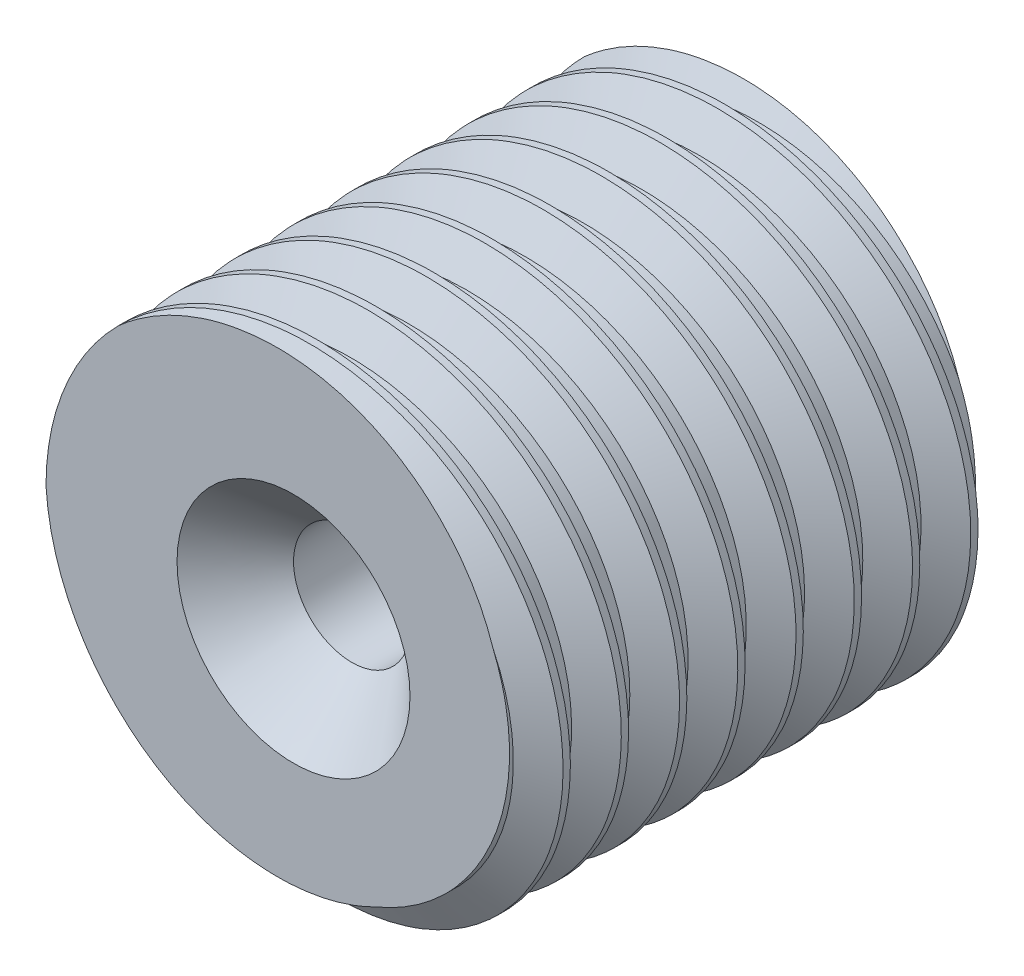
ISO-10303-21;
HEADER;
FILE_DESCRIPTION(('STEP AP214'),'2;1');
FILE_NAME('part.step','',(''),(''),'','','');
FILE_SCHEMA(('AUTOMOTIVE_DESIGN { 1 0 10303 214 1 1 1 1 }'));
ENDSEC;
DATA;
#1=APPLICATION_CONTEXT('core data for automotive mechanical design processes');
#2=APPLICATION_PROTOCOL_DEFINITION('international standard','automotive_design',2000,#1);
#3=PRODUCT_CONTEXT('',#1,'mechanical');
#4=PRODUCT('Part','Part','',(#3));
#5=PRODUCT_RELATED_PRODUCT_CATEGORY('part','',(#4));
#6=PRODUCT_DEFINITION_FORMATION('','',#4);
#7=PRODUCT_DEFINITION_CONTEXT('part definition',#1,'design');
#8=PRODUCT_DEFINITION('design','',#6,#7);
#9=PRODUCT_DEFINITION_SHAPE('','',#8);
#10=(LENGTH_UNIT() NAMED_UNIT(*) SI_UNIT(.MILLI.,.METRE.));
#11=(NAMED_UNIT(*) PLANE_ANGLE_UNIT() SI_UNIT($,.RADIAN.));
#12=(NAMED_UNIT(*) SI_UNIT($,.STERADIAN.) SOLID_ANGLE_UNIT());
#13=UNCERTAINTY_MEASURE_WITH_UNIT(LENGTH_MEASURE(1.E-05),#10,'distance_accuracy_value','');
#14=(GEOMETRIC_REPRESENTATION_CONTEXT(3) GLOBAL_UNCERTAINTY_ASSIGNED_CONTEXT((#13)) GLOBAL_UNIT_ASSIGNED_CONTEXT((#10,
#11,#12)) REPRESENTATION_CONTEXT('',''));
#15=CARTESIAN_POINT('',(0.,0.,0.));
#16=DIRECTION('',(0.,0.,1.));
#17=DIRECTION('',(1.,0.,0.));
#18=AXIS2_PLACEMENT_3D('',#15,#16,#17);
#19=CARTESIAN_POINT('',(0.,0.,8.));
#20=DIRECTION('',(0.,0.,1.));
#21=DIRECTION('',(1.,0.,0.));
#22=AXIS2_PLACEMENT_3D('',#19,#20,#21);
#23=PLANE('',#22);
#24=CARTESIAN_POINT('',(0.,0.,8.));
#25=DIRECTION('',(0.,0.,1.));
#26=DIRECTION('',(1.,0.,0.));
#27=AXIS2_PLACEMENT_3D('',#24,#25,#26);
#28=CIRCLE('',#27,2.00000000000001);
#29=CARTESIAN_POINT('',(2.00000000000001,0.,8.));
#30=VERTEX_POINT('',#29);
#31=EDGE_CURVE('E11',#30,#30,#28,.F.);
#32=ORIENTED_EDGE('',*,*,#31,.T.);
#33=EDGE_LOOP('',(#32));
#34=FACE_BOUND('',#33,.T.);
#35=CARTESIAN_POINT('',(0.,0.,8.));
#36=DIRECTION('',(0.,0.,1.));
#37=DIRECTION('',(1.,0.,0.));
#38=AXIS2_PLACEMENT_3D('',#35,#36,#37);
#39=CIRCLE('',#38,4.25);
#40=CARTESIAN_POINT('',(-3.00520376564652,3.00520387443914,8.));
#41=VERTEX_POINT('',#40);
#42=CARTESIAN_POINT('',(-4.25,0.,8.));
#43=VERTEX_POINT('',#42);
#44=EDGE_CURVE('E91',#41,#43,#39,.T.);
#45=ORIENTED_EDGE('',*,*,#44,.T.);
#46=CARTESIAN_POINT('',(-4.25,0.,8.));
#47=CARTESIAN_POINT('',(-4.24309219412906,-0.112515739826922,8.));
#48=CARTESIAN_POINT('',(-4.23156438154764,-0.224746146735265,8.));
#49=CARTESIAN_POINT('',(-4.19939172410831,-0.447885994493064,8.));
#50=CARTESIAN_POINT('',(-4.17874741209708,-0.558795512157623,8.));
#51=CARTESIAN_POINT('',(-4.12849060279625,-0.778439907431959,8.));
#52=CARTESIAN_POINT('',(-4.09888765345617,-0.887176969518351,8.));
#53=CARTESIAN_POINT('',(-4.03090449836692,-1.10187225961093,8.));
#54=CARTESIAN_POINT('',(-3.99252425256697,-1.20783047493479,8.));
#55=CARTESIAN_POINT('',(-3.9072231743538,-1.416300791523,8.));
#56=CARTESIAN_POINT('',(-3.86029895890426,-1.51881150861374,8.));
#57=CARTESIAN_POINT('',(-3.75823353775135,-1.71965680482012,8.));
#58=CARTESIAN_POINT('',(-3.70309233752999,-1.81799138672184,8.));
#59=CARTESIAN_POINT('',(-3.58494208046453,-2.00985641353,8.));
#60=CARTESIAN_POINT('',(-3.52193068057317,-2.10338541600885,8.));
#61=CARTESIAN_POINT('',(-3.38847446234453,-2.28498855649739,8.));
#62=CARTESIAN_POINT('',(-3.31802892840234,-2.37306216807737,8.));
#63=CARTESIAN_POINT('',(-3.16778517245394,-2.54589876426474,8.));
#64=CARTESIAN_POINT('',(-3.08775922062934,-2.63046454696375,8.));
#65=CARTESIAN_POINT('',(-2.96262397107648,-2.75201839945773,8.));
#66=CARTESIAN_POINT('',(-2.92005885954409,-2.79165713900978,8.));
#67=CARTESIAN_POINT('',(-2.83327551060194,-2.86908227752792,8.));
#68=CARTESIAN_POINT('',(-2.7890572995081,-2.9068687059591,8.));
#69=CARTESIAN_POINT('',(-2.65396529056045,-3.01717016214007,8.));
#70=CARTESIAN_POINT('',(-2.56060378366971,-3.08667657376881,8.));
#71=CARTESIAN_POINT('',(-2.36809456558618,-3.21711833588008,8.));
#72=CARTESIAN_POINT('',(-2.26894686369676,-3.27805370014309,8.));
#73=CARTESIAN_POINT('',(-2.06882329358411,-3.38908736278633,8.));
#74=CARTESIAN_POINT('',(-1.96800326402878,-3.43946645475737,8.));
#75=CARTESIAN_POINT('',(-1.76236057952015,-3.5313683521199,8.));
#76=CARTESIAN_POINT('',(-1.65753647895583,-3.57288792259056,8.));
#77=CARTESIAN_POINT('',(-1.44466625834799,-3.6467475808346,8.));
#78=CARTESIAN_POINT('',(-1.3366191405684,-3.67908479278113,8.));
#79=CARTESIAN_POINT('',(-1.11813889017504,-3.73432083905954,8.));
#80=CARTESIAN_POINT('',(-1.00770579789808,-3.75721983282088,8.));
#81=CARTESIAN_POINT('',(-0.787733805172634,-3.79301103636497,8.));
#82=CARTESIAN_POINT('',(-0.678228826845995,-3.80611264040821,8.));
#83=CARTESIAN_POINT('',(-0.458524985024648,-3.82303350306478,8.));
#84=CARTESIAN_POINT('',(-0.348326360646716,-3.82685580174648,8.));
#85=CARTESIAN_POINT('',(-0.183145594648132,-3.82561439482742,8.));
#86=CARTESIAN_POINT('',(-0.128116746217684,-3.82403921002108,8.));
#87=CARTESIAN_POINT('',(-0.0181847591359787,-3.81857885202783,8.));
#88=CARTESIAN_POINT('',(0.0367184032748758,-3.81469415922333,8.));
#89=CARTESIAN_POINT('',(0.20106618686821,-3.79935769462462,8.));
#90=CARTESIAN_POINT('',(0.310194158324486,-3.78422337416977,8.));
#91=CARTESIAN_POINT('',(0.505243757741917,-3.74826042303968,8.));
#92=CARTESIAN_POINT('',(0.591489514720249,-3.72914818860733,8.));
#93=CARTESIAN_POINT('',(0.762387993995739,-3.68480359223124,8.));
#94=CARTESIAN_POINT('',(0.847040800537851,-3.65957155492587,8.));
#95=CARTESIAN_POINT('',(1.09808378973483,-3.57486163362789,8.));
#96=CARTESIAN_POINT('',(1.26148150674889,-3.50638421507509,8.));
#97=CARTESIAN_POINT('',(1.4192710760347,-3.42642356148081,8.));
#98=B_SPLINE_CURVE_WITH_KNOTS('',3,(#46,#47,#48,#49,#50,#51,#52,#53,#54,#55,#56,#57,#58,#59,#60,
#61,#62,#63,#64,#65,#66,#67,#68,#69,#70,#71,#72,#73,#74,#75,#76,#77,#78,#79,#80,#81,#82,#83,#84,
#85,#86,#87,#88,#89,#90,#91,#92,#93,#94,#95,#96,#97),.UNSPECIFIED.,.F.,.F.,(4,2,2,2,2,2,2,2,2,2,
2,2,2,2,2,2,2,2,2,2,2,2,2,2,2,4),(0.,0.338086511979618,0.676153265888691,1.0138609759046,
1.35157022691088,1.68941348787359,2.02725652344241,2.36520037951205,2.70317679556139,
3.05200899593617,3.22645583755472,3.40089990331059,3.74957761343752,4.09825476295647,
4.43595410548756,4.77377654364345,5.11170466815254,5.44962708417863,5.7801028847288,
6.11047040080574,6.27558281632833,6.44066090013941,6.77068238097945,7.03548399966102,
7.30027157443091,7.83007946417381),.UNSPECIFIED.);
#99=CARTESIAN_POINT('',(1.41927107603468,-3.42642356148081,8.));
#100=VERTEX_POINT('',#99);
#101=EDGE_CURVE('E147',#43,#100,#98,.T.);
#102=ORIENTED_EDGE('',*,*,#101,.T.);
#103=CARTESIAN_POINT('',(1.4192710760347,-3.42642356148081,8.));
#104=CARTESIAN_POINT('',(1.4964483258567,-3.39445158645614,8.));
#105=CARTESIAN_POINT('',(1.57251212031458,-3.35989150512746,8.));
#106=CARTESIAN_POINT('',(1.72227041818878,-3.28565161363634,8.));
#107=CARTESIAN_POINT('',(1.79596037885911,-3.24596264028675,8.));
#108=CARTESIAN_POINT('',(2.04815745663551,-3.09887855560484,8.));
#109=CARTESIAN_POINT('',(2.21941188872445,-2.97864042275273,8.));
#110=CARTESIAN_POINT('',(2.53940841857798,-2.71104012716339,8.));
#111=CARTESIAN_POINT('',(2.68812237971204,-2.56364456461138,8.));
#112=CARTESIAN_POINT('',(2.95864187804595,-2.24602160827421,8.));
#113=CARTESIAN_POINT('',(3.08045997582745,-2.0758049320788,8.));
#114=CARTESIAN_POINT('',(3.29374519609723,-1.71739209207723,8.));
#115=CARTESIAN_POINT('',(3.3852214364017,-1.52920135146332,8.));
#116=CARTESIAN_POINT('',(3.53528547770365,-1.14014675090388,8.));
#117=CARTESIAN_POINT('',(3.59387501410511,-0.939283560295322,8.));
#118=CARTESIAN_POINT('',(3.67651929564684,-0.530478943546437,8.));
#119=CARTESIAN_POINT('',(3.70055999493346,-0.322534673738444,8.));
#120=CARTESIAN_POINT('',(3.71340336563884,0.0945377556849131,8.));
#121=CARTESIAN_POINT('',(3.70218247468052,0.303666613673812,8.));
#122=CARTESIAN_POINT('',(3.64474683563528,0.716855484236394,8.));
#123=CARTESIAN_POINT('',(3.59859307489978,0.92092369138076,8.00000000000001));
#124=CARTESIAN_POINT('',(3.51969454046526,1.17017747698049,8.));
#125=CARTESIAN_POINT('',(3.50252783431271,1.22059537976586,8.));
#126=CARTESIAN_POINT('',(3.46606659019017,1.32057108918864,8.));
#127=CARTESIAN_POINT('',(3.44677524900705,1.37013006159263,8.));
#128=CARTESIAN_POINT('',(3.42642356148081,1.4192710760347,8.));
#129=B_SPLINE_CURVE_WITH_KNOTS('',3,(#103,#104,#105,#106,#107,#108,#109,#110,#111,#112,#113,
#114,#115,#116,#117,#118,#119,#120,#121,#122,#123,#124,#125,#126,#127,#128),.UNSPECIFIED.,.F.,
.F.,(4,2,2,2,2,2,2,2,2,2,2,2,4),(0.,0.250488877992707,0.50143162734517,1.12590960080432,
1.75116078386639,2.37611934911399,3.0008899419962,3.62562756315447,4.25061910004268,
4.87602835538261,5.50034825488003,5.66009976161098,5.81961410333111),.UNSPECIFIED.);
#130=CARTESIAN_POINT('',(3.4264235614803,1.41927107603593,8.00000000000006));
#131=VERTEX_POINT('',#130);
#132=EDGE_CURVE('E97',#100,#131,#129,.T.);
#133=ORIENTED_EDGE('',*,*,#132,.T.);
#134=CARTESIAN_POINT('',(3.42642356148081,1.4192710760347,8.));
#135=CARTESIAN_POINT('',(3.39401600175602,1.51823672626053,8.));
#136=CARTESIAN_POINT('',(3.35740635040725,1.61582555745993,8.));
#137=CARTESIAN_POINT('',(3.27609321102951,1.80757351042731,8.));
#138=CARTESIAN_POINT('',(3.23138956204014,1.90173256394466,8.));
#139=CARTESIAN_POINT('',(3.13433648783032,2.08568237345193,8.));
#140=CARTESIAN_POINT('',(3.08200887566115,2.17548464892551,8.));
#141=CARTESIAN_POINT('',(2.96998461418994,2.35037241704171,8.));
#142=CARTESIAN_POINT('',(2.91028867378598,2.43545836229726,8.00000000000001));
#143=CARTESIAN_POINT('',(2.81557923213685,2.5590614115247,8.));
#144=CARTESIAN_POINT('',(2.7831540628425,2.59958532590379,8.));
#145=CARTESIAN_POINT('',(2.71662237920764,2.67922926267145,8.));
#146=CARTESIAN_POINT('',(2.68251582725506,2.71834925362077,8.));
#147=CARTESIAN_POINT('',(2.57790945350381,2.83363995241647,8.));
#148=CARTESIAN_POINT('',(2.5051162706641,2.90774998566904,8.));
#149=CARTESIAN_POINT('',(2.35381187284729,3.04999863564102,8.));
#150=CARTESIAN_POINT('',(2.27529632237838,3.11813263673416,8.));
#151=CARTESIAN_POINT('',(2.11312541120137,3.24793229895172,8.));
#152=CARTESIAN_POINT('',(2.02947037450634,3.30959836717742,8.));
#153=CARTESIAN_POINT('',(1.7632564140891,3.48991057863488,8.));
#154=CARTESIAN_POINT('',(1.57269021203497,3.59702186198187,8.));
#155=CARTESIAN_POINT('',(1.1764942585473,3.77801383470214,8.));
#156=CARTESIAN_POINT('',(0.970871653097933,3.85191017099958,8.));
#157=CARTESIAN_POINT('',(0.654478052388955,3.93668608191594,8.));
#158=CARTESIAN_POINT('',(0.547059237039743,3.96065983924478,8.));
#159=CARTESIAN_POINT('',(0.330546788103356,3.99951218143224,8.));
#160=CARTESIAN_POINT('',(0.221453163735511,4.01439081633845,8.));
#161=CARTESIAN_POINT('',(0.0571572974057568,4.02975077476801,8.));
#162=CARTESIAN_POINT('',(0.0022559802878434,4.03371132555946,8.));
#163=CARTESIAN_POINT('',(-0.107661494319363,4.03943021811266,8.));
#164=CARTESIAN_POINT('',(-0.162677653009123,4.04118853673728,8.));
#165=CARTESIAN_POINT('',(-0.327767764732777,4.04316686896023,8.));
#166=CARTESIAN_POINT('',(-0.437899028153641,4.04009170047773,8.));
#167=CARTESIAN_POINT('',(-0.659982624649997,4.0249942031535,8.));
#168=CARTESIAN_POINT('',(-0.771921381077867,4.0127755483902,8.));
#169=CARTESIAN_POINT('',(-0.994435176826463,3.97924579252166,8.));
#170=CARTESIAN_POINT('',(-1.10501017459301,3.95793441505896,8.));
#171=CARTESIAN_POINT('',(-1.32388593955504,3.90639884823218,8.));
#172=CARTESIAN_POINT('',(-1.43218989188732,3.8761881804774,8.));
#173=CARTESIAN_POINT('',(-1.64597671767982,3.80704335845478,8.));
#174=CARTESIAN_POINT('',(-1.75145958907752,3.7681091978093,8.));
#175=CARTESIAN_POINT('',(-1.95864066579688,3.68188594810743,8.));
#176=CARTESIAN_POINT('',(-2.06034775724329,3.63461820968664,8.));
#177=CARTESIAN_POINT('',(-2.25950648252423,3.53201758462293,8.));
#178=CARTESIAN_POINT('',(-2.35696142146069,3.4766911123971,8.));
#179=CARTESIAN_POINT('',(-2.54969078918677,3.35666891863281,8.));
#180=CARTESIAN_POINT('',(-2.64483019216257,3.29175624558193,8.));
#181=CARTESIAN_POINT('',(-2.82945133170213,3.15417501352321,8.));
#182=CARTESIAN_POINT('',(-2.91892817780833,3.08149989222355,8.));
#183=CARTESIAN_POINT('',(-3.00520376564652,3.00520387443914,8.));
#184=B_SPLINE_CURVE_WITH_KNOTS('',3,(#134,#135,#136,#137,#138,#139,#140,#141,#142,#143,#144,
#145,#146,#147,#148,#149,#150,#151,#152,#153,#154,#155,#156,#157,#158,#159,#160,#161,#162,#163,
#164,#165,#166,#167,#168,#169,#170,#171,#172,#173,#174,#175,#176,#177,#178,#179,#180,#181,#182,
#183),.UNSPECIFIED.,.F.,.F.,(4,2,2,2,2,2,2,2,2,2,2,2,2,2,2,2,2,2,2,2,2,2,2,2,4),(0.,
0.312317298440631,0.624640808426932,0.936087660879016,1.24750457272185,1.40316353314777,
1.55882597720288,1.87011835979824,2.18164909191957,2.49316020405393,3.14573162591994,
3.79799531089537,4.12786281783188,4.45772850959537,4.62282159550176,4.78791641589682,
5.11805897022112,5.45550125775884,5.79295380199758,6.12989624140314,6.46683892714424,
6.80293058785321,7.13875618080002,7.48387747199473,7.82929286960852),.UNSPECIFIED.);
#185=EDGE_CURVE('E84',#131,#41,#184,.T.);
#186=ORIENTED_EDGE('',*,*,#185,.T.);
#187=EDGE_LOOP('',(#45,#102,#133,#186));
#188=FACE_BOUND('',#187,.T.);
#189=ADVANCED_FACE('F41',(#34,#188),#23,.T.);
#190=CARTESIAN_POINT('',(0.,0.,0.));
#191=DIRECTION('',(0.,0.,1.));
#192=DIRECTION('',(1.,0.,0.));
#193=AXIS2_PLACEMENT_3D('',#190,#191,#192);
#194=PLANE('',#193);
#195=CARTESIAN_POINT('',(0.,0.,0.));
#196=DIRECTION('',(0.,0.,1.));
#197=DIRECTION('',(1.,0.,0.));
#198=AXIS2_PLACEMENT_3D('',#195,#196,#197);
#199=CIRCLE('',#198,1.);
#200=CARTESIAN_POINT('',(1.,0.,0.));
#201=VERTEX_POINT('',#200);
#202=EDGE_CURVE('E103',#201,#201,#199,.T.);
#203=ORIENTED_EDGE('',*,*,#202,.T.);
#204=EDGE_LOOP('',(#203));
#205=FACE_BOUND('',#204,.T.);
#206=CARTESIAN_POINT('',(-4.25,0.,0.));
#207=CARTESIAN_POINT('',(-4.24309219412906,-0.112515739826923,0.));
#208=CARTESIAN_POINT('',(-4.23156438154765,-0.224746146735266,0.));
#209=CARTESIAN_POINT('',(-4.19939172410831,-0.447885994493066,0.));
#210=CARTESIAN_POINT('',(-4.17874741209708,-0.558795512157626,0.));
#211=CARTESIAN_POINT('',(-4.12849060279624,-0.778439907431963,0.));
#212=CARTESIAN_POINT('',(-4.09888765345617,-0.887176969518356,0.));
#213=CARTESIAN_POINT('',(-4.03090449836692,-1.10187225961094,0.));
#214=CARTESIAN_POINT('',(-3.99252425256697,-1.2078304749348,0.));
#215=CARTESIAN_POINT('',(-3.90722317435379,-1.416300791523,0.));
#216=CARTESIAN_POINT('',(-3.86029895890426,-1.51881150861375,0.));
#217=CARTESIAN_POINT('',(-3.75823353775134,-1.71965680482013,0.));
#218=CARTESIAN_POINT('',(-3.70309233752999,-1.81799138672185,0.));
#219=CARTESIAN_POINT('',(-3.58494208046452,-2.00985641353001,0.));
#220=CARTESIAN_POINT('',(-3.52193068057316,-2.10338541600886,0.));
#221=CARTESIAN_POINT('',(-3.38847446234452,-2.2849885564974,0.));
#222=CARTESIAN_POINT('',(-3.31802892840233,-2.37306216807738,0.));
#223=CARTESIAN_POINT('',(-3.16778517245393,-2.54589876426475,0.));
#224=CARTESIAN_POINT('',(-3.08775922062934,-2.63046454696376,0.));
#225=CARTESIAN_POINT('',(-2.96262397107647,-2.75201839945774,0.));
#226=CARTESIAN_POINT('',(-2.92005885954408,-2.79165713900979,0.));
#227=CARTESIAN_POINT('',(-2.83327551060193,-2.86908227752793,0.));
#228=CARTESIAN_POINT('',(-2.78905729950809,-2.90686870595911,0.));
#229=CARTESIAN_POINT('',(-2.65396529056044,-3.01717016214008,0.));
#230=CARTESIAN_POINT('',(-2.5606037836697,-3.08667657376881,0.));
#231=CARTESIAN_POINT('',(-2.36809456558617,-3.21711833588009,0.));
#232=CARTESIAN_POINT('',(-2.26894686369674,-3.27805370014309,0.));
#233=CARTESIAN_POINT('',(-2.0688232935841,-3.38908736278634,0.));
#234=CARTESIAN_POINT('',(-1.96800326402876,-3.43946645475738,0.));
#235=CARTESIAN_POINT('',(-1.76236057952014,-3.5313683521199,0.));
#236=CARTESIAN_POINT('',(-1.65753647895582,-3.57288792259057,0.));
#237=CARTESIAN_POINT('',(-1.44466625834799,-3.64674758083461,0.));
#238=CARTESIAN_POINT('',(-1.3366191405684,-3.67908479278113,0.));
#239=CARTESIAN_POINT('',(-1.11813889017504,-3.73432083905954,0.));
#240=CARTESIAN_POINT('',(-1.00770579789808,-3.75721983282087,0.));
#241=CARTESIAN_POINT('',(-0.787733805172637,-3.79301103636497,0.));
#242=CARTESIAN_POINT('',(-0.678228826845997,-3.80611264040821,0.));
#243=CARTESIAN_POINT('',(-0.458524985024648,-3.82303350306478,0.));
#244=CARTESIAN_POINT('',(-0.348326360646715,-3.82685580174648,0.));
#245=CARTESIAN_POINT('',(-0.18314559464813,-3.82561439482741,0.));
#246=CARTESIAN_POINT('',(-0.128116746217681,-3.82403921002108,0.));
#247=CARTESIAN_POINT('',(-0.0181847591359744,-3.81857885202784,0.));
#248=CARTESIAN_POINT('',(0.0367184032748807,-3.81469415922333,0.));
#249=CARTESIAN_POINT('',(0.201066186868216,-3.79935769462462,0.));
#250=CARTESIAN_POINT('',(0.310194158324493,-3.78422337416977,0.));
#251=CARTESIAN_POINT('',(0.505243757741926,-3.74826042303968,0.));
#252=CARTESIAN_POINT('',(0.591489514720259,-3.72914818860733,0.));
#253=CARTESIAN_POINT('',(0.762387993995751,-3.68480359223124,0.));
#254=CARTESIAN_POINT('',(0.847040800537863,-3.65957155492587,0.));
#255=CARTESIAN_POINT('',(1.09808378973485,-3.57486163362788,0.));
#256=CARTESIAN_POINT('',(1.26148150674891,-3.50638421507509,0.));
#257=CARTESIAN_POINT('',(1.41927107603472,-3.4264235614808,0.));
#258=B_SPLINE_CURVE_WITH_KNOTS('',3,(#206,#207,#208,#209,#210,#211,#212,#213,#214,#215,#216,
#217,#218,#219,#220,#221,#222,#223,#224,#225,#226,#227,#228,#229,#230,#231,#232,#233,#234,#235,
#236,#237,#238,#239,#240,#241,#242,#243,#244,#245,#246,#247,#248,#249,#250,#251,#252,#253,#254,
#255,#256,#257),.UNSPECIFIED.,.F.,.F.,(4,2,2,2,2,2,2,2,2,2,2,2,2,2,2,2,2,2,2,2,2,2,2,2,2,4),(0.,
0.33808651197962,0.676153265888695,1.01386097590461,1.35157022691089,1.6894134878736,
2.02725652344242,2.36520037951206,2.70317679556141,3.05200899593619,3.22645583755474,
3.4008999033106,3.74957761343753,4.09825476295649,4.43595410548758,4.77377654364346,
5.11170466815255,5.44962708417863,5.7801028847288,6.11047040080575,6.27558281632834,
6.44066090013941,6.77068238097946,7.03548399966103,7.30027157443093,7.83007946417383),.UNSPECIFIED.);
#259=CARTESIAN_POINT('',(-4.25,0.,0.));
#260=VERTEX_POINT('',#259);
#261=CARTESIAN_POINT('',(1.41927107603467,-3.42642356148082,0.));
#262=VERTEX_POINT('',#261);
#263=EDGE_CURVE('E98',#260,#262,#258,.T.);
#264=ORIENTED_EDGE('',*,*,#263,.F.);
#265=CARTESIAN_POINT('',(0.,0.,0.));
#266=DIRECTION('',(0.,0.,1.));
#267=DIRECTION('',(1.,0.,0.));
#268=AXIS2_PLACEMENT_3D('',#265,#266,#267);
#269=CIRCLE('',#268,4.25);
#270=CARTESIAN_POINT('',(-3.00520376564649,3.00520387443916,0.));
#271=VERTEX_POINT('',#270);
#272=EDGE_CURVE('E101',#271,#260,#269,.T.);
#273=ORIENTED_EDGE('',*,*,#272,.F.);
#274=CARTESIAN_POINT('',(3.4264235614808,1.41927107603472,0.));
#275=CARTESIAN_POINT('',(3.39401636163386,1.51823562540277,0.));
#276=CARTESIAN_POINT('',(3.35740716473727,1.61582338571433,0.));
#277=CARTESIAN_POINT('',(3.27609510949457,1.80756928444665,0.));
#278=CARTESIAN_POINT('',(3.23139208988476,1.90172735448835,0.));
#279=CARTESIAN_POINT('',(3.13433935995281,2.08567734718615,0.));
#280=CARTESIAN_POINT('',(3.08201129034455,2.17548069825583,0.));
#281=CARTESIAN_POINT('',(2.96998594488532,2.35037052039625,0.));
#282=CARTESIAN_POINT('',(2.91028937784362,2.43545744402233,0.));
#283=CARTESIAN_POINT('',(2.81557875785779,2.55906203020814,0.));
#284=CARTESIAN_POINT('',(2.78315308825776,2.59958654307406,0.));
#285=CARTESIAN_POINT('',(2.71662035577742,2.67923163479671,0.));
#286=CARTESIAN_POINT('',(2.68251325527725,2.71835218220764,0.));
#287=CARTESIAN_POINT('',(2.57790517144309,2.83364448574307,0.));
#288=CARTESIAN_POINT('',(2.50511076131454,2.90775550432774,0.));
#289=CARTESIAN_POINT('',(2.35380602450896,3.05000379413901,0.));
#290=CARTESIAN_POINT('',(2.27529153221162,3.11813663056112,0.));
#291=CARTESIAN_POINT('',(2.11312289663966,3.24793415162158,0.));
#292=CARTESIAN_POINT('',(2.02946907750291,3.30959924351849,0.));
#293=CARTESIAN_POINT('',(1.7632658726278,3.48990417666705,0.));
#294=CARTESIAN_POINT('',(1.57271025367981,3.59701061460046,0.));
#295=CARTESIAN_POINT('',(1.17651589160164,3.77800604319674,0.));
#296=CARTESIAN_POINT('',(0.970882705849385,3.85190720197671,0.));
#297=CARTESIAN_POINT('',(0.654456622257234,3.93669182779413,0.));
#298=CARTESIAN_POINT('',(0.5470159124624,3.96066951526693,0.));
#299=CARTESIAN_POINT('',(0.3304596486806,3.99952591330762,0.));
#300=CARTESIAN_POINT('',(0.221344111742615,4.01440471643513,0.));
#301=CARTESIAN_POINT('',(0.057037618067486,4.02976013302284,0.));
#302=CARTESIAN_POINT('',(0.00214765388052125,4.03371827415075,0.));
#303=CARTESIAN_POINT('',(-0.10774700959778,4.03943334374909,0.));
#304=CARTESIAN_POINT('',(-0.16275171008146,4.04119024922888,0.));
#305=CARTESIAN_POINT('',(-0.327809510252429,4.04316572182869,0.));
#306=CARTESIAN_POINT('',(-0.43791985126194,4.04009029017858,0.));
#307=CARTESIAN_POINT('',(-0.659910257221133,4.02499911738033,0.));
#308=CARTESIAN_POINT('',(-0.771777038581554,4.01279129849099,0.));
#309=CARTESIAN_POINT('',(-0.994139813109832,3.97929628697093,0.));
#310=CARTESIAN_POINT('',(-1.10463587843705,3.95800957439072,0.));
#311=CARTESIAN_POINT('',(-1.32351265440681,3.90649965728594,0.));
#312=CARTESIAN_POINT('',(-1.43189357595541,3.87627734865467,0.));
#313=CARTESIAN_POINT('',(-1.6458311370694,3.80709709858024,0.));
#314=CARTESIAN_POINT('',(-1.75138776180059,3.76813911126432,0.));
#315=CARTESIAN_POINT('',(-1.95997772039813,3.68132948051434,0.));
#316=CARTESIAN_POINT('',(-2.06297680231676,3.63339551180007,0.));
#317=CARTESIAN_POINT('',(-2.26468202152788,3.5292144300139,0.));
#318=CARTESIAN_POINT('',(-2.36338812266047,3.47296724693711,0.));
#319=CARTESIAN_POINT('',(-2.55593443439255,3.35247932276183,0.));
#320=CARTESIAN_POINT('',(-2.64976958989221,3.28823050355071,0.));
#321=CARTESIAN_POINT('',(-2.83184284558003,3.15223092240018,0.));
#322=CARTESIAN_POINT('',(-2.92008067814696,3.08047980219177,0.));
#323=CARTESIAN_POINT('',(-3.00520376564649,3.00520387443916,0.));
#324=B_SPLINE_CURVE_WITH_KNOTS('',3,(#274,#275,#276,#277,#278,#279,#280,#281,#282,#283,#284,
#285,#286,#287,#288,#289,#290,#291,#292,#293,#294,#295,#296,#297,#298,#299,#300,#301,#302,#303,
#304,#305,#306,#307,#308,#309,#310,#311,#312,#313,#314,#315,#316,#317,#318,#319,#320,#321,#322,
#323),.UNSPECIFIED.,.F.,.F.,(4,2,2,2,2,2,2,2,2,2,2,2,2,2,2,2,2,2,2,2,2,2,2,2,4),(0.,
0.312313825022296,0.624633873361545,0.936084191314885,1.24750457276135,1.40316587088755,
1.5588306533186,1.87012770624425,2.18165377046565,2.49316020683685,3.1456974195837,
3.79799531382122,4.12792929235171,4.45785991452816,4.6229185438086,4.78797889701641,
5.11805892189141,5.45528373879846,5.7924907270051,6.1296639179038,6.46683887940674,
6.8072729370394,7.14770986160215,7.48849330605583,7.82929303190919),.UNSPECIFIED.);
#325=CARTESIAN_POINT('',(3.4264235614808,1.41927107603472,0.));
#326=VERTEX_POINT('',#325);
#327=EDGE_CURVE('E86',#326,#271,#324,.T.);
#328=ORIENTED_EDGE('',*,*,#327,.F.);
#329=CARTESIAN_POINT('',(1.41927107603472,-3.4264235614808,0.));
#330=CARTESIAN_POINT('',(1.49644832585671,-3.39445158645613,0.));
#331=CARTESIAN_POINT('',(1.57251212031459,-3.35989150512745,0.));
#332=CARTESIAN_POINT('',(1.72227041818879,-3.28565161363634,0.));
#333=CARTESIAN_POINT('',(1.79596037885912,-3.24596264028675,0.));
#334=CARTESIAN_POINT('',(2.04815745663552,-3.09887855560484,0.));
#335=CARTESIAN_POINT('',(2.21941188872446,-2.97864042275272,0.));
#336=CARTESIAN_POINT('',(2.53940841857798,-2.71104012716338,0.));
#337=CARTESIAN_POINT('',(2.68812237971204,-2.56364456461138,0.));
#338=CARTESIAN_POINT('',(2.95864187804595,-2.24602160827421,0.));
#339=CARTESIAN_POINT('',(3.08045997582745,-2.0758049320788,0.));
#340=CARTESIAN_POINT('',(3.29374519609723,-1.71739209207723,0.));
#341=CARTESIAN_POINT('',(3.3852214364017,-1.52920135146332,0.));
#342=CARTESIAN_POINT('',(3.53528547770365,-1.14014675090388,0.));
#343=CARTESIAN_POINT('',(3.59387501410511,-0.939283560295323,0.));
#344=CARTESIAN_POINT('',(3.67651929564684,-0.530478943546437,0.));
#345=CARTESIAN_POINT('',(3.70055999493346,-0.322534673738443,0.));
#346=CARTESIAN_POINT('',(3.71340336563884,0.0945377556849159,0.));
#347=CARTESIAN_POINT('',(3.70218247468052,0.303666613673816,0.));
#348=CARTESIAN_POINT('',(3.64474683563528,0.716855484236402,0.));
#349=CARTESIAN_POINT('',(3.59859307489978,0.920923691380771,0.));
#350=CARTESIAN_POINT('',(3.51969454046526,1.1701774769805,0.));
#351=CARTESIAN_POINT('',(3.5025278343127,1.22059537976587,0.));
#352=CARTESIAN_POINT('',(3.46606659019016,1.32057108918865,0.));
#353=CARTESIAN_POINT('',(3.44677524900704,1.37013006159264,0.));
#354=CARTESIAN_POINT('',(3.4264235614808,1.41927107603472,0.));
#355=B_SPLINE_CURVE_WITH_KNOTS('',3,(#329,#330,#331,#332,#333,#334,#335,#336,#337,#338,#339,
#340,#341,#342,#343,#344,#345,#346,#347,#348,#349,#350,#351,#352,#353,#354),.UNSPECIFIED.,.F.,
.F.,(4,2,2,2,2,2,2,2,2,2,2,2,4),(0.,0.250488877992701,0.501431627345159,1.12590960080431,
1.75116078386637,2.37611934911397,3.00088994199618,3.62562756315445,4.25061910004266,
4.87602835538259,5.50034825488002,5.66009976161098,5.8196141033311),.UNSPECIFIED.);
#356=EDGE_CURVE('E108',#262,#326,#355,.T.);
#357=ORIENTED_EDGE('',*,*,#356,.F.);
#358=EDGE_LOOP('',(#264,#273,#328,#357));
#359=FACE_BOUND('',#358,.T.);
#360=ADVANCED_FACE('F115',(#205,#359),#194,.F.);
#361=CARTESIAN_POINT('',(0.,0.,8.));
#362=DIRECTION('',(0.,0.,-1.));
#363=DIRECTION('',(-1.,0.,0.));
#364=AXIS2_PLACEMENT_3D('',#361,#362,#363);
#365=CYLINDRICAL_SURFACE('',#364,4.25);
#366=CARTESIAN_POINT('',(-4.25,0.,9.));
#367=CARTESIAN_POINT('',(-4.25,1.76040764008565,8.9375));
#368=CARTESIAN_POINT('',(-3.00520382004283,3.00520382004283,8.875));
#369=CARTESIAN_POINT('',(-1.76040764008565,4.25,8.8125));
#370=CARTESIAN_POINT('',(0.,4.25,8.75));
#371=CARTESIAN_POINT('',(1.76040764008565,4.25,8.6875));
#372=CARTESIAN_POINT('',(3.00520382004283,3.00520382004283,8.625));
#373=CARTESIAN_POINT('',(4.25,1.76040764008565,8.5625));
#374=CARTESIAN_POINT('',(4.25,0.,8.5));
#375=CARTESIAN_POINT('',(4.25,-1.76040764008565,8.4375));
#376=CARTESIAN_POINT('',(3.00520382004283,-3.00520382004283,8.375));
#377=CARTESIAN_POINT('',(1.76040764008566,-4.25,8.3125));
#378=CARTESIAN_POINT('',(0.,-4.25,8.25));
#379=CARTESIAN_POINT('',(-1.76040764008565,-4.25,8.1875));
#380=CARTESIAN_POINT('',(-3.00520382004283,-3.00520382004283,8.125));
#381=CARTESIAN_POINT('',(-4.25,-1.76040764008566,8.0625));
#382=CARTESIAN_POINT('',(-4.25,0.,8.));
#383=CARTESIAN_POINT('',(-4.25,1.76040764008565,7.9375));
#384=CARTESIAN_POINT('',(-3.00520382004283,3.00520382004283,7.875));
#385=CARTESIAN_POINT('',(-1.76040764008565,4.25,7.8125));
#386=CARTESIAN_POINT('',(0.,4.25,7.75));
#387=CARTESIAN_POINT('',(1.76040764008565,4.25,7.6875));
#388=CARTESIAN_POINT('',(3.00520382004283,3.00520382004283,7.625));
#389=CARTESIAN_POINT('',(4.25,1.76040764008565,7.5625));
#390=CARTESIAN_POINT('',(4.25,0.,7.5));
#391=CARTESIAN_POINT('',(4.25,-1.76040764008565,7.4375));
#392=CARTESIAN_POINT('',(3.00520382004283,-3.00520382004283,7.375));
#393=CARTESIAN_POINT('',(1.76040764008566,-4.25,7.3125));
#394=CARTESIAN_POINT('',(0.,-4.25,7.25));
#395=CARTESIAN_POINT('',(-1.76040764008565,-4.25,7.1875));
#396=CARTESIAN_POINT('',(-3.00520382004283,-3.00520382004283,7.125));
#397=CARTESIAN_POINT('',(-4.25,-1.76040764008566,7.0625));
#398=CARTESIAN_POINT('',(-4.25,0.,7.));
#399=CARTESIAN_POINT('',(-4.25,1.76040764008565,6.9375));
#400=CARTESIAN_POINT('',(-3.00520382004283,3.00520382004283,6.875));
#401=CARTESIAN_POINT('',(-1.76040764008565,4.25,6.8125));
#402=CARTESIAN_POINT('',(0.,4.25,6.75));
#403=CARTESIAN_POINT('',(1.76040764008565,4.25,6.6875));
#404=CARTESIAN_POINT('',(3.00520382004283,3.00520382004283,6.625));
#405=CARTESIAN_POINT('',(4.25,1.76040764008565,6.5625));
#406=CARTESIAN_POINT('',(4.25,0.,6.5));
#407=CARTESIAN_POINT('',(4.25,-1.76040764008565,6.4375));
#408=CARTESIAN_POINT('',(3.00520382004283,-3.00520382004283,6.375));
#409=CARTESIAN_POINT('',(1.76040764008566,-4.25,6.3125));
#410=CARTESIAN_POINT('',(0.,-4.25,6.25));
#411=CARTESIAN_POINT('',(-1.76040764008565,-4.25,6.1875));
#412=CARTESIAN_POINT('',(-3.00520382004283,-3.00520382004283,6.125));
#413=CARTESIAN_POINT('',(-4.25,-1.76040764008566,6.0625));
#414=CARTESIAN_POINT('',(-4.25,0.,6.));
#415=CARTESIAN_POINT('',(-4.25,1.76040764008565,5.9375));
#416=CARTESIAN_POINT('',(-3.00520382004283,3.00520382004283,5.875));
#417=CARTESIAN_POINT('',(-1.76040764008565,4.25,5.8125));
#418=CARTESIAN_POINT('',(0.,4.25,5.75));
#419=CARTESIAN_POINT('',(1.76040764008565,4.25,5.6875));
#420=CARTESIAN_POINT('',(3.00520382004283,3.00520382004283,5.625));
#421=CARTESIAN_POINT('',(4.25,1.76040764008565,5.5625));
#422=CARTESIAN_POINT('',(4.25,0.,5.5));
#423=CARTESIAN_POINT('',(4.25,-1.76040764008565,5.4375));
#424=CARTESIAN_POINT('',(3.00520382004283,-3.00520382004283,5.375));
#425=CARTESIAN_POINT('',(1.76040764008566,-4.25,5.3125));
#426=CARTESIAN_POINT('',(0.,-4.25,5.25));
#427=CARTESIAN_POINT('',(-1.76040764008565,-4.25,5.1875));
#428=CARTESIAN_POINT('',(-3.00520382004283,-3.00520382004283,5.125));
#429=CARTESIAN_POINT('',(-4.25,-1.76040764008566,5.0625));
#430=CARTESIAN_POINT('',(-4.25,0.,5.));
#431=CARTESIAN_POINT('',(-4.25,1.76040764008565,4.9375));
#432=CARTESIAN_POINT('',(-3.00520382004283,3.00520382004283,4.875));
#433=CARTESIAN_POINT('',(-1.76040764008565,4.25,4.8125));
#434=CARTESIAN_POINT('',(0.,4.25,4.75));
#435=CARTESIAN_POINT('',(1.76040764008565,4.25,4.6875));
#436=CARTESIAN_POINT('',(3.00520382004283,3.00520382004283,4.625));
#437=CARTESIAN_POINT('',(4.25,1.76040764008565,4.5625));
#438=CARTESIAN_POINT('',(4.25,0.,4.5));
#439=CARTESIAN_POINT('',(4.25,-1.76040764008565,4.4375));
#440=CARTESIAN_POINT('',(3.00520382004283,-3.00520382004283,4.375));
#441=CARTESIAN_POINT('',(1.76040764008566,-4.25,4.3125));
#442=CARTESIAN_POINT('',(0.,-4.25,4.25));
#443=CARTESIAN_POINT('',(-1.76040764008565,-4.25,4.1875));
#444=CARTESIAN_POINT('',(-3.00520382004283,-3.00520382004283,4.125));
#445=CARTESIAN_POINT('',(-4.25,-1.76040764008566,4.0625));
#446=CARTESIAN_POINT('',(-4.25,0.,4.));
#447=CARTESIAN_POINT('',(-4.25,1.76040764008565,3.9375));
#448=CARTESIAN_POINT('',(-3.00520382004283,3.00520382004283,3.875));
#449=CARTESIAN_POINT('',(-1.76040764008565,4.25,3.8125));
#450=CARTESIAN_POINT('',(0.,4.25,3.75));
#451=CARTESIAN_POINT('',(1.76040764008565,4.25,3.6875));
#452=CARTESIAN_POINT('',(3.00520382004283,3.00520382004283,3.625));
#453=CARTESIAN_POINT('',(4.25,1.76040764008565,3.5625));
#454=CARTESIAN_POINT('',(4.25,0.,3.5));
#455=CARTESIAN_POINT('',(4.25,-1.76040764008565,3.4375));
#456=CARTESIAN_POINT('',(3.00520382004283,-3.00520382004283,3.375));
#457=CARTESIAN_POINT('',(1.76040764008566,-4.25,3.3125));
#458=CARTESIAN_POINT('',(0.,-4.25,3.25));
#459=CARTESIAN_POINT('',(-1.76040764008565,-4.25,3.1875));
#460=CARTESIAN_POINT('',(-3.00520382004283,-3.00520382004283,3.125));
#461=CARTESIAN_POINT('',(-4.25,-1.76040764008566,3.0625));
#462=CARTESIAN_POINT('',(-4.25,0.,3.));
#463=CARTESIAN_POINT('',(-4.25,1.76040764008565,2.9375));
#464=CARTESIAN_POINT('',(-3.00520382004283,3.00520382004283,2.875));
#465=CARTESIAN_POINT('',(-1.76040764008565,4.25,2.8125));
#466=CARTESIAN_POINT('',(0.,4.25,2.75));
#467=CARTESIAN_POINT('',(1.76040764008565,4.25,2.6875));
#468=CARTESIAN_POINT('',(3.00520382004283,3.00520382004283,2.625));
#469=CARTESIAN_POINT('',(4.25,1.76040764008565,2.5625));
#470=CARTESIAN_POINT('',(4.25,0.,2.5));
#471=CARTESIAN_POINT('',(4.25,-1.76040764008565,2.4375));
#472=CARTESIAN_POINT('',(3.00520382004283,-3.00520382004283,2.375));
#473=CARTESIAN_POINT('',(1.76040764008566,-4.25,2.3125));
#474=CARTESIAN_POINT('',(0.,-4.25,2.25));
#475=CARTESIAN_POINT('',(-1.76040764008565,-4.25,2.1875));
#476=CARTESIAN_POINT('',(-3.00520382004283,-3.00520382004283,2.125));
#477=CARTESIAN_POINT('',(-4.25,-1.76040764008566,2.0625));
#478=CARTESIAN_POINT('',(-4.25,0.,2.));
#479=CARTESIAN_POINT('',(-4.25,1.76040764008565,1.9375));
#480=CARTESIAN_POINT('',(-3.00520382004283,3.00520382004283,1.875));
#481=CARTESIAN_POINT('',(-1.76040764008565,4.25,1.8125));
#482=CARTESIAN_POINT('',(0.,4.25,1.75));
#483=CARTESIAN_POINT('',(1.76040764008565,4.25,1.6875));
#484=CARTESIAN_POINT('',(3.00520382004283,3.00520382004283,1.625));
#485=CARTESIAN_POINT('',(4.25,1.76040764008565,1.5625));
#486=CARTESIAN_POINT('',(4.25,0.,1.5));
#487=CARTESIAN_POINT('',(4.25,-1.76040764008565,1.4375));
#488=CARTESIAN_POINT('',(3.00520382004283,-3.00520382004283,1.375));
#489=CARTESIAN_POINT('',(1.76040764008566,-4.25,1.3125));
#490=CARTESIAN_POINT('',(0.,-4.25,1.25));
#491=CARTESIAN_POINT('',(-1.76040764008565,-4.25,1.1875));
#492=CARTESIAN_POINT('',(-3.00520382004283,-3.00520382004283,1.125));
#493=CARTESIAN_POINT('',(-4.25,-1.76040764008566,1.0625));
#494=CARTESIAN_POINT('',(-4.25,0.,1.));
#495=CARTESIAN_POINT('',(-4.25,1.76040764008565,0.937500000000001));
#496=CARTESIAN_POINT('',(-3.00520382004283,3.00520382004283,0.875000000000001));
#497=CARTESIAN_POINT('',(-1.76040764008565,4.25,0.812500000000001));
#498=CARTESIAN_POINT('',(0.,4.25,0.750000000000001));
#499=CARTESIAN_POINT('',(1.76040764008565,4.25,0.687500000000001));
#500=CARTESIAN_POINT('',(3.00520382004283,3.00520382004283,0.625000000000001));
#501=CARTESIAN_POINT('',(4.25,1.76040764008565,0.5625));
#502=CARTESIAN_POINT('',(4.25,0.,0.5));
#503=CARTESIAN_POINT('',(4.25,-1.76040764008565,0.4375));
#504=CARTESIAN_POINT('',(3.00520382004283,-3.00520382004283,0.375));
#505=CARTESIAN_POINT('',(1.76040764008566,-4.25,0.3125));
#506=CARTESIAN_POINT('',(0.,-4.25,0.25));
#507=CARTESIAN_POINT('',(-1.76040764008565,-4.25,0.1875));
#508=CARTESIAN_POINT('',(-3.00520382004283,-3.00520382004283,0.125));
#509=CARTESIAN_POINT('',(-4.25,-1.76040764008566,0.0625000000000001));
#510=CARTESIAN_POINT('',(-4.25,0.,0.));
#511=CARTESIAN_POINT('',(-4.25,1.76040764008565,-0.0624999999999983));
#512=CARTESIAN_POINT('',(-3.00520382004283,3.00520382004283,-0.124999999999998));
#513=CARTESIAN_POINT('',(-1.76040764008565,4.25,-0.187499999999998));
#514=CARTESIAN_POINT('',(0.,4.25,-0.249999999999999));
#515=CARTESIAN_POINT('',(1.76040764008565,4.25,-0.312499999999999));
#516=CARTESIAN_POINT('',(3.00520382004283,3.00520382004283,-0.374999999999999));
#517=CARTESIAN_POINT('',(4.25,1.76040764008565,-0.437499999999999));
#518=CARTESIAN_POINT('',(4.25,0.,-0.499999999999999));
#519=CARTESIAN_POINT('',(4.25,-1.76040764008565,-0.562499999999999));
#520=CARTESIAN_POINT('',(3.00520382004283,-3.00520382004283,-0.624999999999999));
#521=CARTESIAN_POINT('',(1.76040764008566,-4.25,-0.687499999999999));
#522=CARTESIAN_POINT('',(0.,-4.25,-0.749999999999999));
#523=CARTESIAN_POINT('',(-1.76040764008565,-4.25,-0.812499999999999));
#524=CARTESIAN_POINT('',(-3.00520382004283,-3.00520382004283,-0.874999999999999));
#525=CARTESIAN_POINT('',(-4.25,-1.76040764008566,-0.937499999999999));
#526=CARTESIAN_POINT('',(-4.25,0.,-0.999999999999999));
#527=(BOUNDED_CURVE() B_SPLINE_CURVE(2,(#366,#367,#368,#369,#370,#371,#372,#373,#374,#375,#376,
#377,#378,#379,#380,#381,#382,#383,#384,#385,#386,#387,#388,#389,#390,#391,#392,#393,#394,#395,
#396,#397,#398,#399,#400,#401,#402,#403,#404,#405,#406,#407,#408,#409,#410,#411,#412,#413,#414,
#415,#416,#417,#418,#419,#420,#421,#422,#423,#424,#425,#426,#427,#428,#429,#430,#431,#432,#433,
#434,#435,#436,#437,#438,#439,#440,#441,#442,#443,#444,#445,#446,#447,#448,#449,#450,#451,#452,
#453,#454,#455,#456,#457,#458,#459,#460,#461,#462,#463,#464,#465,#466,#467,#468,#469,#470,#471,
#472,#473,#474,#475,#476,#477,#478,#479,#480,#481,#482,#483,#484,#485,#486,#487,#488,#489,#490,
#491,#492,#493,#494,#495,#496,#497,#498,#499,#500,#501,#502,#503,#504,#505,#506,#507,#508,#509,
#510,#511,#512,#513,#514,#515,#516,#517,#518,#519,#520,#521,#522,#523,#524,#525,#526),
.UNSPECIFIED.,.F.,.F.) B_SPLINE_CURVE_WITH_KNOTS((3,2,2,2,2,2,2,2,2,2,2,2,2,2,2,2,2,2,2,2,2,2,2,
2,2,2,2,2,2,2,2,2,2,2,2,2,2,2,2,2,2,2,2,2,2,2,2,2,2,2,2,2,2,2,2,2,2,2,2,2,2,2,2,2,2,2,2,2,2,2,2,
2,2,2,2,2,2,2,2,2,3),(0.,0.0125,0.025,0.0375,0.05,0.0625,0.075,0.0875,0.1,0.1125,0.125,0.1375,
0.15,0.1625,0.175,0.1875,0.2,0.2125,0.225,0.2375,0.25,0.2625,0.275,0.2875,0.3,0.3125,0.325,
0.3375,0.35,0.3625,0.375,0.3875,0.4,0.4125,0.425,0.4375,0.45,0.4625,0.475,0.4875,0.5,0.5125,
0.525,0.5375,0.55,0.5625,0.575,0.5875,0.6,0.6125,0.625,0.6375,0.65,0.6625,0.675,0.6875,0.7,
0.7125,0.725,0.7375,0.75,0.7625,0.775,0.7875,0.8,0.8125,0.825,0.8375,0.85,0.8625,0.875,0.8875,
0.9,0.9125,0.925,0.9375,0.95,0.9625,0.975,0.9875,1.),
.UNSPECIFIED.) CURVE() GEOMETRIC_REPRESENTATION_ITEM() RATIONAL_B_SPLINE_CURVE((1.,
0.923879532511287,1.,0.923879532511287,1.,0.923879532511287,1.,0.923879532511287,1.,
0.923879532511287,1.,0.923879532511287,1.,0.923879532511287,1.,0.923879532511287,1.,
0.923879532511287,1.,0.923879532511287,1.,0.923879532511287,1.,0.923879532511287,1.,
0.923879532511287,1.,0.923879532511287,1.,0.923879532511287,1.,0.923879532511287,1.,
0.923879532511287,1.,0.923879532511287,1.,0.923879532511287,1.,0.923879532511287,1.,
0.923879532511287,1.,0.923879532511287,1.,0.923879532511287,1.,0.923879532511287,1.,
0.923879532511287,1.,0.923879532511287,1.,0.923879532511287,1.,0.923879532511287,1.,
0.923879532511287,1.,0.923879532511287,1.,0.923879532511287,1.,0.923879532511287,1.,
0.923879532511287,1.,0.923879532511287,1.,0.923879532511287,1.,0.923879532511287,1.,
0.923879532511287,1.,0.923879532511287,1.,0.923879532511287,1.,0.923879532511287,1.,
0.923879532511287,1.,0.923879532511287,1.,0.923879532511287,1.,0.923879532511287,1.,
0.923879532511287,1.,0.923879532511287,1.,0.923879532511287,1.,0.923879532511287,1.,
0.923879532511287,1.,0.923879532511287,1.,0.923879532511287,1.,0.923879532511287,1.,
0.923879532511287,1.,0.923879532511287,1.,0.923879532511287,1.,0.923879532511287,1.,
0.923879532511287,1.,0.923879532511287,1.,0.923879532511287,1.,0.923879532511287,1.,
0.923879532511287,1.,0.923879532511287,1.,0.923879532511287,1.,0.923879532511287,1.,
0.923879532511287,1.,0.923879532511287,1.,0.923879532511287,1.,0.923879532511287,1.,
0.923879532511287,1.,0.923879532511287,1.,0.923879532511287,1.,0.923879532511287,1.,
0.923879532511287,1.,0.923879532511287,1.,0.923879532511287,1.,0.923879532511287,1.,
0.923879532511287,1.,0.923879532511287,1.,0.923879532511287,1.,0.923879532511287,1.)) REPRESENTATION_ITEM(''));
#528=EDGE_CURVE('E65',#43,#260,#527,.T.);
#529=ORIENTED_EDGE('',*,*,#528,.F.);
#530=ORIENTED_EDGE('',*,*,#44,.F.);
#531=CARTESIAN_POINT('',(-4.25,0.,8.12500000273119));
#532=CARTESIAN_POINT('',(-4.25,1.76040764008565,8.06250000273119));
#533=CARTESIAN_POINT('',(-3.00520382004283,3.00520382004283,8.00000000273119));
#534=CARTESIAN_POINT('',(-1.76040764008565,4.25,7.93750000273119));
#535=CARTESIAN_POINT('',(0.,4.25,7.87500000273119));
#536=CARTESIAN_POINT('',(1.76040764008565,4.25,7.81250000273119));
#537=CARTESIAN_POINT('',(3.00520382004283,3.00520382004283,7.75000000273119));
#538=CARTESIAN_POINT('',(4.25,1.76040764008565,7.68750000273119));
#539=CARTESIAN_POINT('',(4.25,0.,7.62500000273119));
#540=CARTESIAN_POINT('',(4.25,-1.76040764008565,7.56250000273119));
#541=CARTESIAN_POINT('',(3.00520382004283,-3.00520382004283,7.50000000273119));
#542=CARTESIAN_POINT('',(1.76040764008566,-4.25,7.43750000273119));
#543=CARTESIAN_POINT('',(0.,-4.25,7.37500000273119));
#544=CARTESIAN_POINT('',(-1.76040764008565,-4.25,7.31250000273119));
#545=CARTESIAN_POINT('',(-3.00520382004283,-3.00520382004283,7.25000000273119));
#546=CARTESIAN_POINT('',(-4.25,-1.76040764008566,7.18750000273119));
#547=CARTESIAN_POINT('',(-4.25,0.,7.12500000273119));
#548=CARTESIAN_POINT('',(-4.25,1.76040764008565,7.06250000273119));
#549=CARTESIAN_POINT('',(-3.00520382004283,3.00520382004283,7.00000000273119));
#550=CARTESIAN_POINT('',(-1.76040764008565,4.25,6.93750000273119));
#551=CARTESIAN_POINT('',(0.,4.25,6.87500000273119));
#552=CARTESIAN_POINT('',(1.76040764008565,4.25,6.81250000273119));
#553=CARTESIAN_POINT('',(3.00520382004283,3.00520382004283,6.75000000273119));
#554=CARTESIAN_POINT('',(4.25,1.76040764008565,6.68750000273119));
#555=CARTESIAN_POINT('',(4.25,0.,6.62500000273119));
#556=CARTESIAN_POINT('',(4.25,-1.76040764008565,6.56250000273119));
#557=CARTESIAN_POINT('',(3.00520382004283,-3.00520382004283,6.50000000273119));
#558=CARTESIAN_POINT('',(1.76040764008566,-4.25,6.43750000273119));
#559=CARTESIAN_POINT('',(0.,-4.25,6.37500000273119));
#560=CARTESIAN_POINT('',(-1.76040764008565,-4.25,6.31250000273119));
#561=CARTESIAN_POINT('',(-3.00520382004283,-3.00520382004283,6.25000000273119));
#562=CARTESIAN_POINT('',(-4.25,-1.76040764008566,6.18750000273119));
#563=CARTESIAN_POINT('',(-4.25,0.,6.12500000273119));
#564=CARTESIAN_POINT('',(-4.25,1.76040764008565,6.06250000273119));
#565=CARTESIAN_POINT('',(-3.00520382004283,3.00520382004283,6.00000000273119));
#566=CARTESIAN_POINT('',(-1.76040764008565,4.25,5.93750000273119));
#567=CARTESIAN_POINT('',(0.,4.25,5.87500000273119));
#568=CARTESIAN_POINT('',(1.76040764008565,4.25,5.81250000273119));
#569=CARTESIAN_POINT('',(3.00520382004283,3.00520382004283,5.75000000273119));
#570=CARTESIAN_POINT('',(4.25,1.76040764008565,5.68750000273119));
#571=CARTESIAN_POINT('',(4.25,0.,5.62500000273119));
#572=CARTESIAN_POINT('',(4.25,-1.76040764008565,5.56250000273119));
#573=CARTESIAN_POINT('',(3.00520382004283,-3.00520382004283,5.50000000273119));
#574=CARTESIAN_POINT('',(1.76040764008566,-4.25,5.43750000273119));
#575=CARTESIAN_POINT('',(0.,-4.25,5.37500000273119));
#576=CARTESIAN_POINT('',(-1.76040764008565,-4.25,5.31250000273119));
#577=CARTESIAN_POINT('',(-3.00520382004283,-3.00520382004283,5.25000000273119));
#578=CARTESIAN_POINT('',(-4.25,-1.76040764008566,5.18750000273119));
#579=CARTESIAN_POINT('',(-4.25,0.,5.12500000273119));
#580=CARTESIAN_POINT('',(-4.25,1.76040764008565,5.06250000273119));
#581=CARTESIAN_POINT('',(-3.00520382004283,3.00520382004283,5.00000000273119));
#582=CARTESIAN_POINT('',(-1.76040764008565,4.25,4.93750000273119));
#583=CARTESIAN_POINT('',(0.,4.25,4.87500000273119));
#584=CARTESIAN_POINT('',(1.76040764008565,4.25,4.81250000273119));
#585=CARTESIAN_POINT('',(3.00520382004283,3.00520382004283,4.75000000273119));
#586=CARTESIAN_POINT('',(4.25,1.76040764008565,4.68750000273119));
#587=CARTESIAN_POINT('',(4.25,0.,4.62500000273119));
#588=CARTESIAN_POINT('',(4.25,-1.76040764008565,4.56250000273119));
#589=CARTESIAN_POINT('',(3.00520382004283,-3.00520382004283,4.50000000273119));
#590=CARTESIAN_POINT('',(1.76040764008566,-4.25,4.43750000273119));
#591=CARTESIAN_POINT('',(0.,-4.25,4.37500000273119));
#592=CARTESIAN_POINT('',(-1.76040764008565,-4.25,4.31250000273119));
#593=CARTESIAN_POINT('',(-3.00520382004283,-3.00520382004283,4.25000000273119));
#594=CARTESIAN_POINT('',(-4.25,-1.76040764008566,4.18750000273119));
#595=CARTESIAN_POINT('',(-4.25,0.,4.12500000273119));
#596=CARTESIAN_POINT('',(-4.25,1.76040764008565,4.06250000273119));
#597=CARTESIAN_POINT('',(-3.00520382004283,3.00520382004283,4.00000000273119));
#598=CARTESIAN_POINT('',(-1.76040764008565,4.25,3.93750000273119));
#599=CARTESIAN_POINT('',(0.,4.25,3.87500000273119));
#600=CARTESIAN_POINT('',(1.76040764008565,4.25,3.81250000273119));
#601=CARTESIAN_POINT('',(3.00520382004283,3.00520382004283,3.75000000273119));
#602=CARTESIAN_POINT('',(4.25,1.76040764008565,3.68750000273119));
#603=CARTESIAN_POINT('',(4.25,0.,3.62500000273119));
#604=CARTESIAN_POINT('',(4.25,-1.76040764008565,3.56250000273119));
#605=CARTESIAN_POINT('',(3.00520382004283,-3.00520382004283,3.50000000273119));
#606=CARTESIAN_POINT('',(1.76040764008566,-4.25,3.43750000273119));
#607=CARTESIAN_POINT('',(0.,-4.25,3.37500000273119));
#608=CARTESIAN_POINT('',(-1.76040764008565,-4.25,3.31250000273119));
#609=CARTESIAN_POINT('',(-3.00520382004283,-3.00520382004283,3.25000000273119));
#610=CARTESIAN_POINT('',(-4.25,-1.76040764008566,3.18750000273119));
#611=CARTESIAN_POINT('',(-4.25,0.,3.12500000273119));
#612=CARTESIAN_POINT('',(-4.25,1.76040764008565,3.06250000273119));
#613=CARTESIAN_POINT('',(-3.00520382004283,3.00520382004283,3.00000000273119));
#614=CARTESIAN_POINT('',(-1.76040764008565,4.25,2.93750000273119));
#615=CARTESIAN_POINT('',(0.,4.25,2.87500000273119));
#616=CARTESIAN_POINT('',(1.76040764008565,4.25,2.81250000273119));
#617=CARTESIAN_POINT('',(3.00520382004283,3.00520382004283,2.75000000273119));
#618=CARTESIAN_POINT('',(4.25,1.76040764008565,2.68750000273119));
#619=CARTESIAN_POINT('',(4.25,0.,2.62500000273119));
#620=CARTESIAN_POINT('',(4.25,-1.76040764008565,2.56250000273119));
#621=CARTESIAN_POINT('',(3.00520382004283,-3.00520382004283,2.50000000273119));
#622=CARTESIAN_POINT('',(1.76040764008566,-4.25,2.43750000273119));
#623=CARTESIAN_POINT('',(0.,-4.25,2.37500000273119));
#624=CARTESIAN_POINT('',(-1.76040764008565,-4.25,2.31250000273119));
#625=CARTESIAN_POINT('',(-3.00520382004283,-3.00520382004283,2.25000000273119));
#626=CARTESIAN_POINT('',(-4.25,-1.76040764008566,2.18750000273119));
#627=CARTESIAN_POINT('',(-4.25,0.,2.12500000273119));
#628=CARTESIAN_POINT('',(-4.25,1.76040764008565,2.06250000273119));
#629=CARTESIAN_POINT('',(-3.00520382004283,3.00520382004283,2.00000000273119));
#630=CARTESIAN_POINT('',(-1.76040764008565,4.25,1.93750000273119));
#631=CARTESIAN_POINT('',(0.,4.25,1.87500000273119));
#632=CARTESIAN_POINT('',(1.76040764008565,4.25,1.81250000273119));
#633=CARTESIAN_POINT('',(3.00520382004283,3.00520382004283,1.75000000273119));
#634=CARTESIAN_POINT('',(4.25,1.76040764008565,1.68750000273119));
#635=CARTESIAN_POINT('',(4.25,0.,1.62500000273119));
#636=CARTESIAN_POINT('',(4.25,-1.76040764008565,1.56250000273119));
#637=CARTESIAN_POINT('',(3.00520382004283,-3.00520382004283,1.50000000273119));
#638=CARTESIAN_POINT('',(1.76040764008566,-4.25,1.43750000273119));
#639=CARTESIAN_POINT('',(0.,-4.25,1.37500000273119));
#640=CARTESIAN_POINT('',(-1.76040764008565,-4.25,1.31250000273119));
#641=CARTESIAN_POINT('',(-3.00520382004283,-3.00520382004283,1.25000000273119));
#642=CARTESIAN_POINT('',(-4.25,-1.76040764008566,1.18750000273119));
#643=CARTESIAN_POINT('',(-4.25,0.,1.12500000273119));
#644=CARTESIAN_POINT('',(-4.25,1.76040764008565,1.06250000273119));
#645=CARTESIAN_POINT('',(-3.00520382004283,3.00520382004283,1.00000000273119));
#646=CARTESIAN_POINT('',(-1.76040764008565,4.25,0.937500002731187));
#647=CARTESIAN_POINT('',(0.,4.25,0.875000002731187));
#648=CARTESIAN_POINT('',(1.76040764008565,4.25,0.812500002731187));
#649=CARTESIAN_POINT('',(3.00520382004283,3.00520382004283,0.750000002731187));
#650=CARTESIAN_POINT('',(4.25,1.76040764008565,0.687500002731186));
#651=CARTESIAN_POINT('',(4.25,0.,0.625000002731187));
#652=CARTESIAN_POINT('',(4.25,-1.76040764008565,0.562500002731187));
#653=CARTESIAN_POINT('',(3.00520382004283,-3.00520382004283,0.500000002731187));
#654=CARTESIAN_POINT('',(1.76040764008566,-4.25,0.437500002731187));
#655=CARTESIAN_POINT('',(0.,-4.25,0.375000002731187));
#656=CARTESIAN_POINT('',(-1.76040764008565,-4.25,0.312500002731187));
#657=CARTESIAN_POINT('',(-3.00520382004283,-3.00520382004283,0.250000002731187));
#658=CARTESIAN_POINT('',(-4.25,-1.76040764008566,0.187500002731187));
#659=CARTESIAN_POINT('',(-4.25,0.,0.125000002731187));
#660=CARTESIAN_POINT('',(-4.25,1.76040764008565,0.0625000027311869));
#661=CARTESIAN_POINT('',(-3.00520382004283,3.00520382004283,2.73118680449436E-09));
#662=CARTESIAN_POINT('',(-1.76040764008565,4.25,-0.0624999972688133));
#663=CARTESIAN_POINT('',(0.,4.25,-0.124999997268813));
#664=CARTESIAN_POINT('',(1.76040764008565,4.25,-0.187499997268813));
#665=CARTESIAN_POINT('',(3.00520382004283,3.00520382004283,-0.249999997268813));
#666=CARTESIAN_POINT('',(4.25,1.76040764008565,-0.312499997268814));
#667=CARTESIAN_POINT('',(4.25,0.,-0.374999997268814));
#668=CARTESIAN_POINT('',(4.25,-1.76040764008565,-0.437499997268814));
#669=CARTESIAN_POINT('',(3.00520382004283,-3.00520382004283,-0.499999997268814));
#670=CARTESIAN_POINT('',(1.76040764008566,-4.25,-0.562499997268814));
#671=CARTESIAN_POINT('',(0.,-4.25,-0.624999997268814));
#672=CARTESIAN_POINT('',(-1.76040764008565,-4.25,-0.687499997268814));
#673=CARTESIAN_POINT('',(-3.00520382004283,-3.00520382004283,-0.749999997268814));
#674=CARTESIAN_POINT('',(-4.25,-1.76040764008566,-0.812499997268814));
#675=CARTESIAN_POINT('',(-4.25,0.,-0.874999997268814));
#676=CARTESIAN_POINT('',(-4.25,1.76040764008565,-0.937499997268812));
#677=CARTESIAN_POINT('',(-3.00520382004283,3.00520382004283,-0.999999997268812));
#678=CARTESIAN_POINT('',(-1.76040764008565,4.25,-1.06249999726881));
#679=CARTESIAN_POINT('',(0.,4.25,-1.12499999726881));
#680=CARTESIAN_POINT('',(1.76040764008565,4.25,-1.18749999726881));
#681=CARTESIAN_POINT('',(3.00520382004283,3.00520382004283,-1.24999999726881));
#682=CARTESIAN_POINT('',(4.25,1.76040764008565,-1.31249999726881));
#683=CARTESIAN_POINT('',(4.25,0.,-1.37499999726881));
#684=CARTESIAN_POINT('',(4.25,-1.76040764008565,-1.43749999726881));
#685=CARTESIAN_POINT('',(3.00520382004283,-3.00520382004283,-1.49999999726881));
#686=CARTESIAN_POINT('',(1.76040764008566,-4.25,-1.56249999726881));
#687=CARTESIAN_POINT('',(0.,-4.25,-1.62499999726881));
#688=CARTESIAN_POINT('',(-1.76040764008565,-4.25,-1.68749999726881));
#689=CARTESIAN_POINT('',(-3.00520382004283,-3.00520382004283,-1.74999999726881));
#690=CARTESIAN_POINT('',(-4.25,-1.76040764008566,-1.81249999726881));
#691=CARTESIAN_POINT('',(-4.25,0.,-1.87499999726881));
#692=(BOUNDED_CURVE() B_SPLINE_CURVE(2,(#531,#532,#533,#534,#535,#536,#537,#538,#539,#540,#541,
#542,#543,#544,#545,#546,#547,#548,#549,#550,#551,#552,#553,#554,#555,#556,#557,#558,#559,#560,
#561,#562,#563,#564,#565,#566,#567,#568,#569,#570,#571,#572,#573,#574,#575,#576,#577,#578,#579,
#580,#581,#582,#583,#584,#585,#586,#587,#588,#589,#590,#591,#592,#593,#594,#595,#596,#597,#598,
#599,#600,#601,#602,#603,#604,#605,#606,#607,#608,#609,#610,#611,#612,#613,#614,#615,#616,#617,
#618,#619,#620,#621,#622,#623,#624,#625,#626,#627,#628,#629,#630,#631,#632,#633,#634,#635,#636,
#637,#638,#639,#640,#641,#642,#643,#644,#645,#646,#647,#648,#649,#650,#651,#652,#653,#654,#655,
#656,#657,#658,#659,#660,#661,#662,#663,#664,#665,#666,#667,#668,#669,#670,#671,#672,#673,#674,
#675,#676,#677,#678,#679,#680,#681,#682,#683,#684,#685,#686,#687,#688,#689,#690,#691),
.UNSPECIFIED.,.F.,.F.) B_SPLINE_CURVE_WITH_KNOTS((3,2,2,2,2,2,2,2,2,2,2,2,2,2,2,2,2,2,2,2,2,2,2,
2,2,2,2,2,2,2,2,2,2,2,2,2,2,2,2,2,2,2,2,2,2,2,2,2,2,2,2,2,2,2,2,2,2,2,2,2,2,2,2,2,2,2,2,2,2,2,2,
2,2,2,2,2,2,2,2,2,3),(0.,0.0125,0.025,0.0375,0.05,0.0625,0.075,0.0875,0.1,0.1125,0.125,0.1375,
0.15,0.1625,0.175,0.1875,0.2,0.2125,0.225,0.2375,0.25,0.2625,0.275,0.2875,0.3,0.3125,0.325,
0.3375,0.35,0.3625,0.375,0.3875,0.4,0.4125,0.425,0.4375,0.45,0.4625,0.475,0.4875,0.5,0.5125,
0.525,0.5375,0.55,0.5625,0.575,0.5875,0.6,0.6125,0.625,0.6375,0.65,0.6625,0.675,0.6875,0.7,
0.7125,0.725,0.7375,0.75,0.7625,0.775,0.7875,0.8,0.8125,0.825,0.8375,0.85,0.8625,0.875,0.8875,
0.9,0.9125,0.925,0.9375,0.95,0.9625,0.975,0.9875,1.),
.UNSPECIFIED.) CURVE() GEOMETRIC_REPRESENTATION_ITEM() RATIONAL_B_SPLINE_CURVE((1.,
0.923879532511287,1.,0.923879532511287,1.,0.923879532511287,1.,0.923879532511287,1.,
0.923879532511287,1.,0.923879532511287,1.,0.923879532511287,1.,0.923879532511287,1.,
0.923879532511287,1.,0.923879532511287,1.,0.923879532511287,1.,0.923879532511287,1.,
0.923879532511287,1.,0.923879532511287,1.,0.923879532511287,1.,0.923879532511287,1.,
0.923879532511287,1.,0.923879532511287,1.,0.923879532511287,1.,0.923879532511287,1.,
0.923879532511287,1.,0.923879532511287,1.,0.923879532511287,1.,0.923879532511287,1.,
0.923879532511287,1.,0.923879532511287,1.,0.923879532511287,1.,0.923879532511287,1.,
0.923879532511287,1.,0.923879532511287,1.,0.923879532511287,1.,0.923879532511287,1.,
0.923879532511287,1.,0.923879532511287,1.,0.923879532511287,1.,0.923879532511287,1.,
0.923879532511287,1.,0.923879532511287,1.,0.923879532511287,1.,0.923879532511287,1.,
0.923879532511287,1.,0.923879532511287,1.,0.923879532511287,1.,0.923879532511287,1.,
0.923879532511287,1.,0.923879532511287,1.,0.923879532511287,1.,0.923879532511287,1.,
0.923879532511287,1.,0.923879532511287,1.,0.923879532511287,1.,0.923879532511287,1.,
0.923879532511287,1.,0.923879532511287,1.,0.923879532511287,1.,0.923879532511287,1.,
0.923879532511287,1.,0.923879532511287,1.,0.923879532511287,1.,0.923879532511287,1.,
0.923879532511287,1.,0.923879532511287,1.,0.923879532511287,1.,0.923879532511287,1.,
0.923879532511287,1.,0.923879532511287,1.,0.923879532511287,1.,0.923879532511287,1.,
0.923879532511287,1.,0.923879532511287,1.,0.923879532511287,1.,0.923879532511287,1.,
0.923879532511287,1.,0.923879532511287,1.,0.923879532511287,1.,0.923879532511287,1.,
0.923879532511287,1.,0.923879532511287,1.,0.923879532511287,1.,0.923879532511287,1.)) REPRESENTATION_ITEM(''));
#693=EDGE_CURVE('E81',#41,#271,#692,.T.);
#694=ORIENTED_EDGE('',*,*,#693,.T.);
#695=ORIENTED_EDGE('',*,*,#272,.T.);
#696=EDGE_LOOP('',(#529,#530,#694,#695));
#697=FACE_BOUND('',#696,.T.);
#698=ADVANCED_FACE('F100',(#697),#365,.T.);
#699=CARTESIAN_POINT('',(0.,0.,8.));
#700=DIRECTION('',(0.,0.,-1.));
#701=DIRECTION('',(-1.,0.,0.));
#702=AXIS2_PLACEMENT_3D('',#699,#700,#701);
#703=CYLINDRICAL_SURFACE('',#702,1.);
#704=CARTESIAN_POINT('',(0.,0.,7.));
#705=DIRECTION('',(0.,0.,1.));
#706=DIRECTION('',(1.,0.,0.));
#707=AXIS2_PLACEMENT_3D('',#704,#705,#706);
#708=CIRCLE('',#707,1.);
#709=CARTESIAN_POINT('',(1.,0.,7.));
#710=VERTEX_POINT('',#709);
#711=EDGE_CURVE('E50',#710,#710,#708,.T.);
#712=ORIENTED_EDGE('',*,*,#711,.T.);
#713=EDGE_LOOP('',(#712));
#714=FACE_BOUND('',#713,.T.);
#715=ORIENTED_EDGE('',*,*,#202,.F.);
#716=EDGE_LOOP('',(#715));
#717=FACE_BOUND('',#716,.T.);
#718=ADVANCED_FACE('F126',(#714,#717),#703,.F.);
#719=CARTESIAN_POINT('',(-3.708734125,0.,8.43750000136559));
#720=CARTESIAN_POINT('',(-3.708734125,1.53620797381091,8.37500000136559));
#721=CARTESIAN_POINT('',(-2.62247104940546,2.62247104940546,8.31250000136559));
#722=CARTESIAN_POINT('',(-1.53620797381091,3.708734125,8.25000000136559));
#723=CARTESIAN_POINT('',(0.,3.708734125,8.18750000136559));
#724=CARTESIAN_POINT('',(1.53620797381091,3.708734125,8.12500000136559));
#725=CARTESIAN_POINT('',(2.62247104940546,2.62247104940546,8.06250000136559));
#726=CARTESIAN_POINT('',(3.708734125,1.53620797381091,8.00000000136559));
#727=CARTESIAN_POINT('',(3.708734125,0.,7.93750000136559));
#728=CARTESIAN_POINT('',(3.708734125,-1.53620797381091,7.87500000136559));
#729=CARTESIAN_POINT('',(2.62247104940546,-2.62247104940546,7.81250000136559));
#730=CARTESIAN_POINT('',(1.53620797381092,-3.708734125,7.75000000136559));
#731=CARTESIAN_POINT('',(0.,-3.708734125,7.68750000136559));
#732=CARTESIAN_POINT('',(-1.53620797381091,-3.708734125,7.62500000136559));
#733=CARTESIAN_POINT('',(-2.62247104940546,-2.62247104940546,7.56250000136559));
#734=CARTESIAN_POINT('',(-3.708734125,-1.53620797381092,7.50000000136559));
#735=CARTESIAN_POINT('',(-3.708734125,0.,7.43750000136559));
#736=CARTESIAN_POINT('',(-3.708734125,1.53620797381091,7.37500000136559));
#737=CARTESIAN_POINT('',(-2.62247104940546,2.62247104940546,7.31250000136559));
#738=CARTESIAN_POINT('',(-1.53620797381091,3.708734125,7.25000000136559));
#739=CARTESIAN_POINT('',(0.,3.708734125,7.18750000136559));
#740=CARTESIAN_POINT('',(1.53620797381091,3.708734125,7.12500000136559));
#741=CARTESIAN_POINT('',(2.62247104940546,2.62247104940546,7.06250000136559));
#742=CARTESIAN_POINT('',(3.708734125,1.53620797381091,7.00000000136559));
#743=CARTESIAN_POINT('',(3.708734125,0.,6.93750000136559));
#744=CARTESIAN_POINT('',(3.708734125,-1.53620797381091,6.87500000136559));
#745=CARTESIAN_POINT('',(2.62247104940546,-2.62247104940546,6.81250000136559));
#746=CARTESIAN_POINT('',(1.53620797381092,-3.708734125,6.75000000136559));
#747=CARTESIAN_POINT('',(0.,-3.708734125,6.68750000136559));
#748=CARTESIAN_POINT('',(-1.53620797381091,-3.708734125,6.62500000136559));
#749=CARTESIAN_POINT('',(-2.62247104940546,-2.62247104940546,6.56250000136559));
#750=CARTESIAN_POINT('',(-3.708734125,-1.53620797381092,6.50000000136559));
#751=CARTESIAN_POINT('',(-3.708734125,0.,6.43750000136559));
#752=CARTESIAN_POINT('',(-3.708734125,1.53620797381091,6.37500000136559));
#753=CARTESIAN_POINT('',(-2.62247104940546,2.62247104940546,6.31250000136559));
#754=CARTESIAN_POINT('',(-1.53620797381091,3.708734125,6.25000000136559));
#755=CARTESIAN_POINT('',(0.,3.708734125,6.18750000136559));
#756=CARTESIAN_POINT('',(1.53620797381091,3.708734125,6.12500000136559));
#757=CARTESIAN_POINT('',(2.62247104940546,2.62247104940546,6.06250000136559));
#758=CARTESIAN_POINT('',(3.708734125,1.53620797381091,6.00000000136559));
#759=CARTESIAN_POINT('',(3.708734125,0.,5.93750000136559));
#760=CARTESIAN_POINT('',(3.708734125,-1.53620797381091,5.87500000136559));
#761=CARTESIAN_POINT('',(2.62247104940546,-2.62247104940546,5.81250000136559));
#762=CARTESIAN_POINT('',(1.53620797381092,-3.708734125,5.75000000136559));
#763=CARTESIAN_POINT('',(0.,-3.708734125,5.68750000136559));
#764=CARTESIAN_POINT('',(-1.53620797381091,-3.708734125,5.62500000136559));
#765=CARTESIAN_POINT('',(-2.62247104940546,-2.62247104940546,5.56250000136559));
#766=CARTESIAN_POINT('',(-3.708734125,-1.53620797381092,5.50000000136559));
#767=CARTESIAN_POINT('',(-3.708734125,0.,5.43750000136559));
#768=CARTESIAN_POINT('',(-3.708734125,1.53620797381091,5.37500000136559));
#769=CARTESIAN_POINT('',(-2.62247104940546,2.62247104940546,5.31250000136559));
#770=CARTESIAN_POINT('',(-1.53620797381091,3.708734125,5.25000000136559));
#771=CARTESIAN_POINT('',(0.,3.708734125,5.18750000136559));
#772=CARTESIAN_POINT('',(1.53620797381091,3.708734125,5.12500000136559));
#773=CARTESIAN_POINT('',(2.62247104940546,2.62247104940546,5.06250000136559));
#774=CARTESIAN_POINT('',(3.708734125,1.53620797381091,5.00000000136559));
#775=CARTESIAN_POINT('',(3.708734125,0.,4.93750000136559));
#776=CARTESIAN_POINT('',(3.708734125,-1.53620797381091,4.87500000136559));
#777=CARTESIAN_POINT('',(2.62247104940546,-2.62247104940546,4.81250000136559));
#778=CARTESIAN_POINT('',(1.53620797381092,-3.708734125,4.75000000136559));
#779=CARTESIAN_POINT('',(0.,-3.708734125,4.68750000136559));
#780=CARTESIAN_POINT('',(-1.53620797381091,-3.708734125,4.62500000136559));
#781=CARTESIAN_POINT('',(-2.62247104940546,-2.62247104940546,4.56250000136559));
#782=CARTESIAN_POINT('',(-3.708734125,-1.53620797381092,4.50000000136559));
#783=CARTESIAN_POINT('',(-3.708734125,0.,4.43750000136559));
#784=CARTESIAN_POINT('',(-3.708734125,1.53620797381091,4.37500000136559));
#785=CARTESIAN_POINT('',(-2.62247104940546,2.62247104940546,4.31250000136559));
#786=CARTESIAN_POINT('',(-1.53620797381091,3.708734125,4.25000000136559));
#787=CARTESIAN_POINT('',(0.,3.708734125,4.18750000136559));
#788=CARTESIAN_POINT('',(1.53620797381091,3.708734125,4.12500000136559));
#789=CARTESIAN_POINT('',(2.62247104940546,2.62247104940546,4.06250000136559));
#790=CARTESIAN_POINT('',(3.708734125,1.53620797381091,4.00000000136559));
#791=CARTESIAN_POINT('',(3.708734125,0.,3.93750000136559));
#792=CARTESIAN_POINT('',(3.708734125,-1.53620797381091,3.87500000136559));
#793=CARTESIAN_POINT('',(2.62247104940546,-2.62247104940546,3.81250000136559));
#794=CARTESIAN_POINT('',(1.53620797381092,-3.708734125,3.75000000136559));
#795=CARTESIAN_POINT('',(0.,-3.708734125,3.68750000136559));
#796=CARTESIAN_POINT('',(-1.53620797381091,-3.708734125,3.62500000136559));
#797=CARTESIAN_POINT('',(-2.62247104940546,-2.62247104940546,3.56250000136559));
#798=CARTESIAN_POINT('',(-3.708734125,-1.53620797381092,3.50000000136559));
#799=CARTESIAN_POINT('',(-3.708734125,0.,3.43750000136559));
#800=CARTESIAN_POINT('',(-3.708734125,1.53620797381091,3.37500000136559));
#801=CARTESIAN_POINT('',(-2.62247104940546,2.62247104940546,3.31250000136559));
#802=CARTESIAN_POINT('',(-1.53620797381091,3.708734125,3.25000000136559));
#803=CARTESIAN_POINT('',(0.,3.708734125,3.18750000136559));
#804=CARTESIAN_POINT('',(1.53620797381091,3.708734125,3.12500000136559));
#805=CARTESIAN_POINT('',(2.62247104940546,2.62247104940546,3.06250000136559));
#806=CARTESIAN_POINT('',(3.708734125,1.53620797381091,3.00000000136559));
#807=CARTESIAN_POINT('',(3.708734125,0.,2.93750000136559));
#808=CARTESIAN_POINT('',(3.708734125,-1.53620797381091,2.87500000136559));
#809=CARTESIAN_POINT('',(2.62247104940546,-2.62247104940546,2.81250000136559));
#810=CARTESIAN_POINT('',(1.53620797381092,-3.708734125,2.75000000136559));
#811=CARTESIAN_POINT('',(0.,-3.708734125,2.68750000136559));
#812=CARTESIAN_POINT('',(-1.53620797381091,-3.708734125,2.62500000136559));
#813=CARTESIAN_POINT('',(-2.62247104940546,-2.62247104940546,2.56250000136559));
#814=CARTESIAN_POINT('',(-3.708734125,-1.53620797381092,2.50000000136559));
#815=CARTESIAN_POINT('',(-3.708734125,0.,2.43750000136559));
#816=CARTESIAN_POINT('',(-3.708734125,1.53620797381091,2.37500000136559));
#817=CARTESIAN_POINT('',(-2.62247104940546,2.62247104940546,2.31250000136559));
#818=CARTESIAN_POINT('',(-1.53620797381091,3.708734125,2.25000000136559));
#819=CARTESIAN_POINT('',(0.,3.708734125,2.18750000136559));
#820=CARTESIAN_POINT('',(1.53620797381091,3.708734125,2.12500000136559));
#821=CARTESIAN_POINT('',(2.62247104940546,2.62247104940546,2.06250000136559));
#822=CARTESIAN_POINT('',(3.708734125,1.53620797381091,2.00000000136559));
#823=CARTESIAN_POINT('',(3.708734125,0.,1.93750000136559));
#824=CARTESIAN_POINT('',(3.708734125,-1.53620797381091,1.87500000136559));
#825=CARTESIAN_POINT('',(2.62247104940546,-2.62247104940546,1.81250000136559));
#826=CARTESIAN_POINT('',(1.53620797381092,-3.708734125,1.75000000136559));
#827=CARTESIAN_POINT('',(0.,-3.708734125,1.68750000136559));
#828=CARTESIAN_POINT('',(-1.53620797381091,-3.708734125,1.62500000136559));
#829=CARTESIAN_POINT('',(-2.62247104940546,-2.62247104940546,1.56250000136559));
#830=CARTESIAN_POINT('',(-3.708734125,-1.53620797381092,1.50000000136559));
#831=CARTESIAN_POINT('',(-3.708734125,0.,1.43750000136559));
#832=CARTESIAN_POINT('',(-3.708734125,1.53620797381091,1.37500000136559));
#833=CARTESIAN_POINT('',(-2.62247104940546,2.62247104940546,1.31250000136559));
#834=CARTESIAN_POINT('',(-1.53620797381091,3.708734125,1.25000000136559));
#835=CARTESIAN_POINT('',(0.,3.708734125,1.18750000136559));
#836=CARTESIAN_POINT('',(1.53620797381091,3.708734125,1.12500000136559));
#837=CARTESIAN_POINT('',(2.62247104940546,2.62247104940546,1.06250000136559));
#838=CARTESIAN_POINT('',(3.708734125,1.53620797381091,1.00000000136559));
#839=CARTESIAN_POINT('',(3.708734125,0.,0.937500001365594));
#840=CARTESIAN_POINT('',(3.708734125,-1.53620797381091,0.875000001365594));
#841=CARTESIAN_POINT('',(2.62247104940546,-2.62247104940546,0.812500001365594));
#842=CARTESIAN_POINT('',(1.53620797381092,-3.708734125,0.750000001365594));
#843=CARTESIAN_POINT('',(0.,-3.708734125,0.687500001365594));
#844=CARTESIAN_POINT('',(-1.53620797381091,-3.708734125,0.625000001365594));
#845=CARTESIAN_POINT('',(-2.62247104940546,-2.62247104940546,0.562500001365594));
#846=CARTESIAN_POINT('',(-3.708734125,-1.53620797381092,0.500000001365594));
#847=CARTESIAN_POINT('',(-3.708734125,0.,0.437500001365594));
#848=CARTESIAN_POINT('',(-3.708734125,1.53620797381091,0.375000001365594));
#849=CARTESIAN_POINT('',(-2.62247104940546,2.62247104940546,0.312500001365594));
#850=CARTESIAN_POINT('',(-1.53620797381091,3.708734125,0.250000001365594));
#851=CARTESIAN_POINT('',(0.,3.708734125,0.187500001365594));
#852=CARTESIAN_POINT('',(1.53620797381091,3.708734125,0.125000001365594));
#853=CARTESIAN_POINT('',(2.62247104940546,2.62247104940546,0.0625000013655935));
#854=CARTESIAN_POINT('',(3.708734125,1.53620797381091,1.36559340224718E-09));
#855=CARTESIAN_POINT('',(3.708734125,0.,-0.0624999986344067));
#856=CARTESIAN_POINT('',(3.708734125,-1.53620797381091,-0.124999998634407));
#857=CARTESIAN_POINT('',(2.62247104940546,-2.62247104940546,-0.187499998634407));
#858=CARTESIAN_POINT('',(1.53620797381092,-3.708734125,-0.249999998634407));
#859=CARTESIAN_POINT('',(0.,-3.708734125,-0.312499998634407));
#860=CARTESIAN_POINT('',(-1.53620797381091,-3.708734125,-0.374999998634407));
#861=CARTESIAN_POINT('',(-2.62247104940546,-2.62247104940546,-0.437499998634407));
#862=CARTESIAN_POINT('',(-3.708734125,-1.53620797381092,-0.499999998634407));
#863=CARTESIAN_POINT('',(-3.708734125,0.,-0.562499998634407));
#864=CARTESIAN_POINT('',(-3.708734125,1.53620797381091,-0.624999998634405));
#865=CARTESIAN_POINT('',(-2.62247104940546,2.62247104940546,-0.687499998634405));
#866=CARTESIAN_POINT('',(-1.53620797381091,3.708734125,-0.749999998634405));
#867=CARTESIAN_POINT('',(0.,3.708734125,-0.812499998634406));
#868=CARTESIAN_POINT('',(1.53620797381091,3.708734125,-0.874999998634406));
#869=CARTESIAN_POINT('',(2.62247104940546,2.62247104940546,-0.937499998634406));
#870=CARTESIAN_POINT('',(3.708734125,1.53620797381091,-0.999999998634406));
#871=CARTESIAN_POINT('',(3.708734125,0.,-1.06249999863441));
#872=CARTESIAN_POINT('',(3.708734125,-1.53620797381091,-1.12499999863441));
#873=CARTESIAN_POINT('',(2.62247104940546,-2.62247104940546,-1.18749999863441));
#874=CARTESIAN_POINT('',(1.53620797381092,-3.708734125,-1.24999999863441));
#875=CARTESIAN_POINT('',(0.,-3.708734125,-1.31249999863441));
#876=CARTESIAN_POINT('',(-1.53620797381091,-3.708734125,-1.37499999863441));
#877=CARTESIAN_POINT('',(-2.62247104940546,-2.62247104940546,-1.43749999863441));
#878=CARTESIAN_POINT('',(-3.708734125,-1.53620797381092,-1.49999999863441));
#879=CARTESIAN_POINT('',(-3.708734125,0.,-1.56249999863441));
#880=CARTESIAN_POINT('',(-3.708734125,0.,8.68750000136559));
#881=CARTESIAN_POINT('',(-3.708734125,1.53620797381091,8.62500000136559));
#882=CARTESIAN_POINT('',(-2.62247104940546,2.62247104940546,8.56250000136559));
#883=CARTESIAN_POINT('',(-1.53620797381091,3.708734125,8.50000000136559));
#884=CARTESIAN_POINT('',(0.,3.708734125,8.43750000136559));
#885=CARTESIAN_POINT('',(1.53620797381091,3.708734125,8.37500000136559));
#886=CARTESIAN_POINT('',(2.62247104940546,2.62247104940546,8.31250000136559));
#887=CARTESIAN_POINT('',(3.708734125,1.53620797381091,8.25000000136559));
#888=CARTESIAN_POINT('',(3.708734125,0.,8.18750000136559));
#889=CARTESIAN_POINT('',(3.708734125,-1.53620797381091,8.12500000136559));
#890=CARTESIAN_POINT('',(2.62247104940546,-2.62247104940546,8.06250000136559));
#891=CARTESIAN_POINT('',(1.53620797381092,-3.708734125,8.00000000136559));
#892=CARTESIAN_POINT('',(0.,-3.708734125,7.93750000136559));
#893=CARTESIAN_POINT('',(-1.53620797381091,-3.708734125,7.87500000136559));
#894=CARTESIAN_POINT('',(-2.62247104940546,-2.62247104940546,7.81250000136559));
#895=CARTESIAN_POINT('',(-3.708734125,-1.53620797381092,7.75000000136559));
#896=CARTESIAN_POINT('',(-3.708734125,0.,7.68750000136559));
#897=CARTESIAN_POINT('',(-3.708734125,1.53620797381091,7.62500000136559));
#898=CARTESIAN_POINT('',(-2.62247104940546,2.62247104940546,7.56250000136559));
#899=CARTESIAN_POINT('',(-1.53620797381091,3.708734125,7.50000000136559));
#900=CARTESIAN_POINT('',(0.,3.708734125,7.43750000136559));
#901=CARTESIAN_POINT('',(1.53620797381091,3.708734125,7.37500000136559));
#902=CARTESIAN_POINT('',(2.62247104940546,2.62247104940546,7.31250000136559));
#903=CARTESIAN_POINT('',(3.708734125,1.53620797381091,7.25000000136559));
#904=CARTESIAN_POINT('',(3.708734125,0.,7.18750000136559));
#905=CARTESIAN_POINT('',(3.708734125,-1.53620797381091,7.12500000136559));
#906=CARTESIAN_POINT('',(2.62247104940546,-2.62247104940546,7.06250000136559));
#907=CARTESIAN_POINT('',(1.53620797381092,-3.708734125,7.00000000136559));
#908=CARTESIAN_POINT('',(0.,-3.708734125,6.93750000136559));
#909=CARTESIAN_POINT('',(-1.53620797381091,-3.708734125,6.87500000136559));
#910=CARTESIAN_POINT('',(-2.62247104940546,-2.62247104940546,6.81250000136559));
#911=CARTESIAN_POINT('',(-3.708734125,-1.53620797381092,6.75000000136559));
#912=CARTESIAN_POINT('',(-3.708734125,0.,6.68750000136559));
#913=CARTESIAN_POINT('',(-3.708734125,1.53620797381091,6.62500000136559));
#914=CARTESIAN_POINT('',(-2.62247104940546,2.62247104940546,6.56250000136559));
#915=CARTESIAN_POINT('',(-1.53620797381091,3.708734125,6.50000000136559));
#916=CARTESIAN_POINT('',(0.,3.708734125,6.43750000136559));
#917=CARTESIAN_POINT('',(1.53620797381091,3.708734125,6.37500000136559));
#918=CARTESIAN_POINT('',(2.62247104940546,2.62247104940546,6.31250000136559));
#919=CARTESIAN_POINT('',(3.708734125,1.53620797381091,6.25000000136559));
#920=CARTESIAN_POINT('',(3.708734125,0.,6.18750000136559));
#921=CARTESIAN_POINT('',(3.708734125,-1.53620797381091,6.12500000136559));
#922=CARTESIAN_POINT('',(2.62247104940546,-2.62247104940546,6.06250000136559));
#923=CARTESIAN_POINT('',(1.53620797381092,-3.708734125,6.00000000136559));
#924=CARTESIAN_POINT('',(0.,-3.708734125,5.93750000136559));
#925=CARTESIAN_POINT('',(-1.53620797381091,-3.708734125,5.87500000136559));
#926=CARTESIAN_POINT('',(-2.62247104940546,-2.62247104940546,5.81250000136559));
#927=CARTESIAN_POINT('',(-3.708734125,-1.53620797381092,5.75000000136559));
#928=CARTESIAN_POINT('',(-3.708734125,0.,5.68750000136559));
#929=CARTESIAN_POINT('',(-3.708734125,1.53620797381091,5.62500000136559));
#930=CARTESIAN_POINT('',(-2.62247104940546,2.62247104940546,5.56250000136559));
#931=CARTESIAN_POINT('',(-1.53620797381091,3.708734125,5.50000000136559));
#932=CARTESIAN_POINT('',(0.,3.708734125,5.43750000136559));
#933=CARTESIAN_POINT('',(1.53620797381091,3.708734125,5.37500000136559));
#934=CARTESIAN_POINT('',(2.62247104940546,2.62247104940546,5.31250000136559));
#935=CARTESIAN_POINT('',(3.708734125,1.53620797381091,5.25000000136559));
#936=CARTESIAN_POINT('',(3.708734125,0.,5.18750000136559));
#937=CARTESIAN_POINT('',(3.708734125,-1.53620797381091,5.12500000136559));
#938=CARTESIAN_POINT('',(2.62247104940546,-2.62247104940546,5.06250000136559));
#939=CARTESIAN_POINT('',(1.53620797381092,-3.708734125,5.00000000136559));
#940=CARTESIAN_POINT('',(0.,-3.708734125,4.93750000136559));
#941=CARTESIAN_POINT('',(-1.53620797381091,-3.708734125,4.87500000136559));
#942=CARTESIAN_POINT('',(-2.62247104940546,-2.62247104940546,4.81250000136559));
#943=CARTESIAN_POINT('',(-3.708734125,-1.53620797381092,4.75000000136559));
#944=CARTESIAN_POINT('',(-3.708734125,0.,4.68750000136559));
#945=CARTESIAN_POINT('',(-3.708734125,1.53620797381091,4.62500000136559));
#946=CARTESIAN_POINT('',(-2.62247104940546,2.62247104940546,4.56250000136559));
#947=CARTESIAN_POINT('',(-1.53620797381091,3.708734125,4.50000000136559));
#948=CARTESIAN_POINT('',(0.,3.708734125,4.43750000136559));
#949=CARTESIAN_POINT('',(1.53620797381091,3.708734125,4.37500000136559));
#950=CARTESIAN_POINT('',(2.62247104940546,2.62247104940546,4.31250000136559));
#951=CARTESIAN_POINT('',(3.708734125,1.53620797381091,4.25000000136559));
#952=CARTESIAN_POINT('',(3.708734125,0.,4.18750000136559));
#953=CARTESIAN_POINT('',(3.708734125,-1.53620797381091,4.12500000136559));
#954=CARTESIAN_POINT('',(2.62247104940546,-2.62247104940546,4.06250000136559));
#955=CARTESIAN_POINT('',(1.53620797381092,-3.708734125,4.00000000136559));
#956=CARTESIAN_POINT('',(0.,-3.708734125,3.93750000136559));
#957=CARTESIAN_POINT('',(-1.53620797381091,-3.708734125,3.87500000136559));
#958=CARTESIAN_POINT('',(-2.62247104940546,-2.62247104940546,3.81250000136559));
#959=CARTESIAN_POINT('',(-3.708734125,-1.53620797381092,3.75000000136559));
#960=CARTESIAN_POINT('',(-3.708734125,0.,3.68750000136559));
#961=CARTESIAN_POINT('',(-3.708734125,1.53620797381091,3.62500000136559));
#962=CARTESIAN_POINT('',(-2.62247104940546,2.62247104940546,3.56250000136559));
#963=CARTESIAN_POINT('',(-1.53620797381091,3.708734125,3.50000000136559));
#964=CARTESIAN_POINT('',(0.,3.708734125,3.43750000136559));
#965=CARTESIAN_POINT('',(1.53620797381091,3.708734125,3.37500000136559));
#966=CARTESIAN_POINT('',(2.62247104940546,2.62247104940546,3.31250000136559));
#967=CARTESIAN_POINT('',(3.708734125,1.53620797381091,3.25000000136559));
#968=CARTESIAN_POINT('',(3.708734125,0.,3.18750000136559));
#969=CARTESIAN_POINT('',(3.708734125,-1.53620797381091,3.12500000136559));
#970=CARTESIAN_POINT('',(2.62247104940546,-2.62247104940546,3.06250000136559));
#971=CARTESIAN_POINT('',(1.53620797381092,-3.708734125,3.00000000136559));
#972=CARTESIAN_POINT('',(0.,-3.708734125,2.93750000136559));
#973=CARTESIAN_POINT('',(-1.53620797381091,-3.708734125,2.87500000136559));
#974=CARTESIAN_POINT('',(-2.62247104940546,-2.62247104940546,2.81250000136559));
#975=CARTESIAN_POINT('',(-3.708734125,-1.53620797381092,2.75000000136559));
#976=CARTESIAN_POINT('',(-3.708734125,0.,2.68750000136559));
#977=CARTESIAN_POINT('',(-3.708734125,1.53620797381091,2.62500000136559));
#978=CARTESIAN_POINT('',(-2.62247104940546,2.62247104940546,2.56250000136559));
#979=CARTESIAN_POINT('',(-1.53620797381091,3.708734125,2.50000000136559));
#980=CARTESIAN_POINT('',(0.,3.708734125,2.43750000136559));
#981=CARTESIAN_POINT('',(1.53620797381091,3.708734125,2.37500000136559));
#982=CARTESIAN_POINT('',(2.62247104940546,2.62247104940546,2.31250000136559));
#983=CARTESIAN_POINT('',(3.708734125,1.53620797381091,2.25000000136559));
#984=CARTESIAN_POINT('',(3.708734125,0.,2.18750000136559));
#985=CARTESIAN_POINT('',(3.708734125,-1.53620797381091,2.12500000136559));
#986=CARTESIAN_POINT('',(2.62247104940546,-2.62247104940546,2.06250000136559));
#987=CARTESIAN_POINT('',(1.53620797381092,-3.708734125,2.00000000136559));
#988=CARTESIAN_POINT('',(0.,-3.708734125,1.93750000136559));
#989=CARTESIAN_POINT('',(-1.53620797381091,-3.708734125,1.87500000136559));
#990=CARTESIAN_POINT('',(-2.62247104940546,-2.62247104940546,1.81250000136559));
#991=CARTESIAN_POINT('',(-3.708734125,-1.53620797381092,1.75000000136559));
#992=CARTESIAN_POINT('',(-3.708734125,0.,1.68750000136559));
#993=CARTESIAN_POINT('',(-3.708734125,1.53620797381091,1.62500000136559));
#994=CARTESIAN_POINT('',(-2.62247104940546,2.62247104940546,1.56250000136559));
#995=CARTESIAN_POINT('',(-1.53620797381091,3.708734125,1.50000000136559));
#996=CARTESIAN_POINT('',(0.,3.708734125,1.43750000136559));
#997=CARTESIAN_POINT('',(1.53620797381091,3.708734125,1.37500000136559));
#998=CARTESIAN_POINT('',(2.62247104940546,2.62247104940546,1.31250000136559));
#999=CARTESIAN_POINT('',(3.708734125,1.53620797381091,1.25000000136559));
#1000=CARTESIAN_POINT('',(3.708734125,0.,1.18750000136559));
#1001=CARTESIAN_POINT('',(3.708734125,-1.53620797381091,1.12500000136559));
#1002=CARTESIAN_POINT('',(2.62247104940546,-2.62247104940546,1.06250000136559));
#1003=CARTESIAN_POINT('',(1.53620797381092,-3.708734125,1.00000000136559));
#1004=CARTESIAN_POINT('',(0.,-3.708734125,0.937500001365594));
#1005=CARTESIAN_POINT('',(-1.53620797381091,-3.708734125,0.875000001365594));
#1006=CARTESIAN_POINT('',(-2.62247104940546,-2.62247104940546,0.812500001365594));
#1007=CARTESIAN_POINT('',(-3.708734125,-1.53620797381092,0.750000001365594));
#1008=CARTESIAN_POINT('',(-3.708734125,0.,0.687500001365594));
#1009=CARTESIAN_POINT('',(-3.708734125,1.53620797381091,0.625000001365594));
#1010=CARTESIAN_POINT('',(-2.62247104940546,2.62247104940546,0.562500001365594));
#1011=CARTESIAN_POINT('',(-1.53620797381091,3.708734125,0.500000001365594));
#1012=CARTESIAN_POINT('',(0.,3.708734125,0.437500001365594));
#1013=CARTESIAN_POINT('',(1.53620797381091,3.708734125,0.375000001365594));
#1014=CARTESIAN_POINT('',(2.62247104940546,2.62247104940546,0.312500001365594));
#1015=CARTESIAN_POINT('',(3.708734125,1.53620797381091,0.250000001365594));
#1016=CARTESIAN_POINT('',(3.708734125,0.,0.187500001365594));
#1017=CARTESIAN_POINT('',(3.708734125,-1.53620797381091,0.125000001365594));
#1018=CARTESIAN_POINT('',(2.62247104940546,-2.62247104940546,0.0625000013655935));
#1019=CARTESIAN_POINT('',(1.53620797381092,-3.708734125,1.36559340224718E-09));
#1020=CARTESIAN_POINT('',(0.,-3.708734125,-0.0624999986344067));
#1021=CARTESIAN_POINT('',(-1.53620797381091,-3.708734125,-0.124999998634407));
#1022=CARTESIAN_POINT('',(-2.62247104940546,-2.62247104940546,-0.187499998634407));
#1023=CARTESIAN_POINT('',(-3.708734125,-1.53620797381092,-0.249999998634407));
#1024=CARTESIAN_POINT('',(-3.708734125,0.,-0.312499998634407));
#1025=CARTESIAN_POINT('',(-3.708734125,1.53620797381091,-0.374999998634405));
#1026=CARTESIAN_POINT('',(-2.62247104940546,2.62247104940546,-0.437499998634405));
#1027=CARTESIAN_POINT('',(-1.53620797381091,3.708734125,-0.499999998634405));
#1028=CARTESIAN_POINT('',(0.,3.708734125,-0.562499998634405));
#1029=CARTESIAN_POINT('',(1.53620797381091,3.708734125,-0.624999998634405));
#1030=CARTESIAN_POINT('',(2.62247104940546,2.62247104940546,-0.687499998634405));
#1031=CARTESIAN_POINT('',(3.708734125,1.53620797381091,-0.749999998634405));
#1032=CARTESIAN_POINT('',(3.708734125,0.,-0.812499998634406));
#1033=CARTESIAN_POINT('',(3.708734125,-1.53620797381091,-0.874999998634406));
#1034=CARTESIAN_POINT('',(2.62247104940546,-2.62247104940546,-0.937499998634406));
#1035=CARTESIAN_POINT('',(1.53620797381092,-3.708734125,-0.999999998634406));
#1036=CARTESIAN_POINT('',(0.,-3.708734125,-1.06249999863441));
#1037=CARTESIAN_POINT('',(-1.53620797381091,-3.708734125,-1.12499999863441));
#1038=CARTESIAN_POINT('',(-2.62247104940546,-2.62247104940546,-1.18749999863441));
#1039=CARTESIAN_POINT('',(-3.708734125,-1.53620797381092,-1.24999999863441));
#1040=CARTESIAN_POINT('',(-3.708734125,0.,-1.31249999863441));
#1041=(BOUNDED_SURFACE() B_SPLINE_SURFACE(1,2,((#719,#720,#721,#722,#723,#724,#725,#726,#727,
#728,#729,#730,#731,#732,#733,#734,#735,#736,#737,#738,#739,#740,#741,#742,#743,#744,#745,#746,
#747,#748,#749,#750,#751,#752,#753,#754,#755,#756,#757,#758,#759,#760,#761,#762,#763,#764,#765,
#766,#767,#768,#769,#770,#771,#772,#773,#774,#775,#776,#777,#778,#779,#780,#781,#782,#783,#784,
#785,#786,#787,#788,#789,#790,#791,#792,#793,#794,#795,#796,#797,#798,#799,#800,#801,#802,#803,
#804,#805,#806,#807,#808,#809,#810,#811,#812,#813,#814,#815,#816,#817,#818,#819,#820,#821,#822,
#823,#824,#825,#826,#827,#828,#829,#830,#831,#832,#833,#834,#835,#836,#837,#838,#839,#840,#841,
#842,#843,#844,#845,#846,#847,#848,#849,#850,#851,#852,#853,#854,#855,#856,#857,#858,#859,#860,
#861,#862,#863,#864,#865,#866,#867,#868,#869,#870,#871,#872,#873,#874,#875,#876,#877,#878,#879),
(#880,#881,#882,#883,#884,#885,#886,#887,#888,#889,#890,#891,#892,#893,#894,#895,#896,#897,#898,
#899,#900,#901,#902,#903,#904,#905,#906,#907,#908,#909,#910,#911,#912,#913,#914,#915,#916,#917,
#918,#919,#920,#921,#922,#923,#924,#925,#926,#927,#928,#929,#930,#931,#932,#933,#934,#935,#936,
#937,#938,#939,#940,#941,#942,#943,#944,#945,#946,#947,#948,#949,#950,#951,#952,#953,#954,#955,
#956,#957,#958,#959,#960,#961,#962,#963,#964,#965,#966,#967,#968,#969,#970,#971,#972,#973,#974,
#975,#976,#977,#978,#979,#980,#981,#982,#983,#984,#985,#986,#987,#988,#989,#990,#991,#992,#993,
#994,#995,#996,#997,#998,#999,#1000,#1001,#1002,#1003,#1004,#1005,#1006,#1007,#1008,#1009,#1010,
#1011,#1012,#1013,#1014,#1015,#1016,#1017,#1018,#1019,#1020,#1021,#1022,#1023,#1024,#1025,#1026,
#1027,#1028,#1029,#1030,#1031,#1032,#1033,#1034,#1035,#1036,#1037,#1038,#1039,#1040)),
.UNSPECIFIED.,.F.,.F.,.F.) B_SPLINE_SURFACE_WITH_KNOTS((2,2),(3,2,2,2,2,2,2,2,2,2,2,2,2,2,2,2,2,
2,2,2,2,2,2,2,2,2,2,2,2,2,2,2,2,2,2,2,2,2,2,2,2,2,2,2,2,2,2,2,2,2,2,2,2,2,2,2,2,2,2,2,2,2,2,2,2,
2,2,2,2,2,2,2,2,2,2,2,2,2,2,2,3),(0.,1.),(0.,0.0125,0.025,0.0375,0.05,0.0625,0.075,0.0875,0.1,
0.1125,0.125,0.1375,0.15,0.1625,0.175,0.1875,0.2,0.2125,0.225,0.2375,0.25,0.2625,0.275,0.2875,
0.3,0.3125,0.325,0.3375,0.35,0.3625,0.375,0.3875,0.4,0.4125,0.425,0.4375,0.45,0.4625,0.475,
0.4875,0.5,0.5125,0.525,0.5375,0.55,0.5625,0.575,0.5875,0.6,0.6125,0.625,0.6375,0.65,0.6625,
0.675,0.6875,0.7,0.7125,0.725,0.7375,0.75,0.7625,0.775,0.7875,0.8,0.8125,0.825,0.8375,0.85,
0.8625,0.875,0.8875,0.9,0.9125,0.925,0.9375,0.95,0.9625,0.975,0.9875,1.),
.UNSPECIFIED.) GEOMETRIC_REPRESENTATION_ITEM() RATIONAL_B_SPLINE_SURFACE(((1.,0.923879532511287,
1.,0.923879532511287,1.,0.923879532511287,1.,0.923879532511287,1.,0.923879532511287,1.,
0.923879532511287,1.,0.923879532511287,1.,0.923879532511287,1.,0.923879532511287,1.,
0.923879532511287,1.,0.923879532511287,1.,0.923879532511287,1.,0.923879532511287,1.,
0.923879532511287,1.,0.923879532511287,1.,0.923879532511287,1.,0.923879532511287,1.,
0.923879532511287,1.,0.923879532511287,1.,0.923879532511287,1.,0.923879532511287,1.,
0.923879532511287,1.,0.923879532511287,1.,0.923879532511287,1.,0.923879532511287,1.,
0.923879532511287,1.,0.923879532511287,1.,0.923879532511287,1.,0.923879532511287,1.,
0.923879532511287,1.,0.923879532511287,1.,0.923879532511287,1.,0.923879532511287,1.,
0.923879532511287,1.,0.923879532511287,1.,0.923879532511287,1.,0.923879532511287,1.,
0.923879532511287,1.,0.923879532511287,1.,0.923879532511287,1.,0.923879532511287,1.,
0.923879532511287,1.,0.923879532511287,1.,0.923879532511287,1.,0.923879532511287,1.,
0.923879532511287,1.,0.923879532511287,1.,0.923879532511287,1.,0.923879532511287,1.,
0.923879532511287,1.,0.923879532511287,1.,0.923879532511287,1.,0.923879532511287,1.,
0.923879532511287,1.,0.923879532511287,1.,0.923879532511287,1.,0.923879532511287,1.,
0.923879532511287,1.,0.923879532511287,1.,0.923879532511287,1.,0.923879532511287,1.,
0.923879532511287,1.,0.923879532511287,1.,0.923879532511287,1.,0.923879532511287,1.,
0.923879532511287,1.,0.923879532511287,1.,0.923879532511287,1.,0.923879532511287,1.,
0.923879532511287,1.,0.923879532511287,1.,0.923879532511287,1.,0.923879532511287,1.,
0.923879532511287,1.,0.923879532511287,1.,0.923879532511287,1.,0.923879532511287,1.,
0.923879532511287,1.,0.923879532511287,1.,0.923879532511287,1.),(1.,0.923879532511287,1.,
0.923879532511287,1.,0.923879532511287,1.,0.923879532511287,1.,0.923879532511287,1.,
0.923879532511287,1.,0.923879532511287,1.,0.923879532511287,1.,0.923879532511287,1.,
0.923879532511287,1.,0.923879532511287,1.,0.923879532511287,1.,0.923879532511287,1.,
0.923879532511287,1.,0.923879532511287,1.,0.923879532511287,1.,0.923879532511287,1.,
0.923879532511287,1.,0.923879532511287,1.,0.923879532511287,1.,0.923879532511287,1.,
0.923879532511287,1.,0.923879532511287,1.,0.923879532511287,1.,0.923879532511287,1.,
0.923879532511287,1.,0.923879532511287,1.,0.923879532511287,1.,0.923879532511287,1.,
0.923879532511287,1.,0.923879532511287,1.,0.923879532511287,1.,0.923879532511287,1.,
0.923879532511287,1.,0.923879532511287,1.,0.923879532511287,1.,0.923879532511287,1.,
0.923879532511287,1.,0.923879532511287,1.,0.923879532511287,1.,0.923879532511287,1.,
0.923879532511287,1.,0.923879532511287,1.,0.923879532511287,1.,0.923879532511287,1.,
0.923879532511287,1.,0.923879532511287,1.,0.923879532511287,1.,0.923879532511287,1.,
0.923879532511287,1.,0.923879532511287,1.,0.923879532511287,1.,0.923879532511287,1.,
0.923879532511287,1.,0.923879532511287,1.,0.923879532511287,1.,0.923879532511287,1.,
0.923879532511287,1.,0.923879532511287,1.,0.923879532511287,1.,0.923879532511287,1.,
0.923879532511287,1.,0.923879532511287,1.,0.923879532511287,1.,0.923879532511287,1.,
0.923879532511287,1.,0.923879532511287,1.,0.923879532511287,1.,0.923879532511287,1.,
0.923879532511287,1.,0.923879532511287,1.,0.923879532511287,1.,0.923879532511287,1.,
0.923879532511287,1.,0.923879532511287,1.,0.923879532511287,1.,0.923879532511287,1.,
0.923879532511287,1.,0.923879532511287,1.,0.923879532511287,1.))) REPRESENTATION_ITEM('') SURFACE());
#1042=CARTESIAN_POINT('',(-3.708734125,0.,8.68750000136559));
#1043=CARTESIAN_POINT('',(-3.708734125,1.53620797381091,8.62500000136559));
#1044=CARTESIAN_POINT('',(-2.62247104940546,2.62247104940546,8.56250000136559));
#1045=CARTESIAN_POINT('',(-1.53620797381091,3.708734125,8.50000000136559));
#1046=CARTESIAN_POINT('',(0.,3.708734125,8.43750000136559));
#1047=CARTESIAN_POINT('',(1.53620797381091,3.708734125,8.37500000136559));
#1048=CARTESIAN_POINT('',(2.62247104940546,2.62247104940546,8.31250000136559));
#1049=CARTESIAN_POINT('',(3.708734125,1.53620797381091,8.25000000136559));
#1050=CARTESIAN_POINT('',(3.708734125,0.,8.18750000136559));
#1051=CARTESIAN_POINT('',(3.708734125,-1.53620797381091,8.12500000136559));
#1052=CARTESIAN_POINT('',(2.62247104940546,-2.62247104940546,8.06250000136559));
#1053=CARTESIAN_POINT('',(1.53620797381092,-3.708734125,8.00000000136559));
#1054=CARTESIAN_POINT('',(0.,-3.708734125,7.93750000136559));
#1055=CARTESIAN_POINT('',(-1.53620797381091,-3.708734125,7.87500000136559));
#1056=CARTESIAN_POINT('',(-2.62247104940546,-2.62247104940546,7.81250000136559));
#1057=CARTESIAN_POINT('',(-3.708734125,-1.53620797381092,7.75000000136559));
#1058=CARTESIAN_POINT('',(-3.708734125,0.,7.68750000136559));
#1059=CARTESIAN_POINT('',(-3.708734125,1.53620797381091,7.62500000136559));
#1060=CARTESIAN_POINT('',(-2.62247104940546,2.62247104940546,7.56250000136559));
#1061=CARTESIAN_POINT('',(-1.53620797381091,3.708734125,7.50000000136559));
#1062=CARTESIAN_POINT('',(0.,3.708734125,7.43750000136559));
#1063=CARTESIAN_POINT('',(1.53620797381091,3.708734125,7.37500000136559));
#1064=CARTESIAN_POINT('',(2.62247104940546,2.62247104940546,7.31250000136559));
#1065=CARTESIAN_POINT('',(3.708734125,1.53620797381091,7.25000000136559));
#1066=CARTESIAN_POINT('',(3.708734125,0.,7.18750000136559));
#1067=CARTESIAN_POINT('',(3.708734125,-1.53620797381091,7.12500000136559));
#1068=CARTESIAN_POINT('',(2.62247104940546,-2.62247104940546,7.06250000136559));
#1069=CARTESIAN_POINT('',(1.53620797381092,-3.708734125,7.00000000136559));
#1070=CARTESIAN_POINT('',(0.,-3.708734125,6.93750000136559));
#1071=CARTESIAN_POINT('',(-1.53620797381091,-3.708734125,6.87500000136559));
#1072=CARTESIAN_POINT('',(-2.62247104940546,-2.62247104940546,6.81250000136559));
#1073=CARTESIAN_POINT('',(-3.708734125,-1.53620797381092,6.75000000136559));
#1074=CARTESIAN_POINT('',(-3.708734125,0.,6.68750000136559));
#1075=CARTESIAN_POINT('',(-3.708734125,1.53620797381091,6.62500000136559));
#1076=CARTESIAN_POINT('',(-2.62247104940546,2.62247104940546,6.56250000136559));
#1077=CARTESIAN_POINT('',(-1.53620797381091,3.708734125,6.50000000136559));
#1078=CARTESIAN_POINT('',(0.,3.708734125,6.43750000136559));
#1079=CARTESIAN_POINT('',(1.53620797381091,3.708734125,6.37500000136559));
#1080=CARTESIAN_POINT('',(2.62247104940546,2.62247104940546,6.31250000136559));
#1081=CARTESIAN_POINT('',(3.708734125,1.53620797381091,6.25000000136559));
#1082=CARTESIAN_POINT('',(3.708734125,0.,6.18750000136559));
#1083=CARTESIAN_POINT('',(3.708734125,-1.53620797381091,6.12500000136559));
#1084=CARTESIAN_POINT('',(2.62247104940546,-2.62247104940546,6.06250000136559));
#1085=CARTESIAN_POINT('',(1.53620797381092,-3.708734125,6.00000000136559));
#1086=CARTESIAN_POINT('',(0.,-3.708734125,5.93750000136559));
#1087=CARTESIAN_POINT('',(-1.53620797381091,-3.708734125,5.87500000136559));
#1088=CARTESIAN_POINT('',(-2.62247104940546,-2.62247104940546,5.81250000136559));
#1089=CARTESIAN_POINT('',(-3.708734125,-1.53620797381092,5.75000000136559));
#1090=CARTESIAN_POINT('',(-3.708734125,0.,5.68750000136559));
#1091=CARTESIAN_POINT('',(-3.708734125,1.53620797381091,5.62500000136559));
#1092=CARTESIAN_POINT('',(-2.62247104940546,2.62247104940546,5.56250000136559));
#1093=CARTESIAN_POINT('',(-1.53620797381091,3.708734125,5.50000000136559));
#1094=CARTESIAN_POINT('',(0.,3.708734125,5.43750000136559));
#1095=CARTESIAN_POINT('',(1.53620797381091,3.708734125,5.37500000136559));
#1096=CARTESIAN_POINT('',(2.62247104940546,2.62247104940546,5.31250000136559));
#1097=CARTESIAN_POINT('',(3.708734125,1.53620797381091,5.25000000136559));
#1098=CARTESIAN_POINT('',(3.708734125,0.,5.18750000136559));
#1099=CARTESIAN_POINT('',(3.708734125,-1.53620797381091,5.12500000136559));
#1100=CARTESIAN_POINT('',(2.62247104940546,-2.62247104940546,5.06250000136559));
#1101=CARTESIAN_POINT('',(1.53620797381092,-3.708734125,5.00000000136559));
#1102=CARTESIAN_POINT('',(0.,-3.708734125,4.93750000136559));
#1103=CARTESIAN_POINT('',(-1.53620797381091,-3.708734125,4.87500000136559));
#1104=CARTESIAN_POINT('',(-2.62247104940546,-2.62247104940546,4.81250000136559));
#1105=CARTESIAN_POINT('',(-3.708734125,-1.53620797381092,4.75000000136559));
#1106=CARTESIAN_POINT('',(-3.708734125,0.,4.68750000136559));
#1107=CARTESIAN_POINT('',(-3.708734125,1.53620797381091,4.62500000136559));
#1108=CARTESIAN_POINT('',(-2.62247104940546,2.62247104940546,4.56250000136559));
#1109=CARTESIAN_POINT('',(-1.53620797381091,3.708734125,4.50000000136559));
#1110=CARTESIAN_POINT('',(0.,3.708734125,4.43750000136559));
#1111=CARTESIAN_POINT('',(1.53620797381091,3.708734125,4.37500000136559));
#1112=CARTESIAN_POINT('',(2.62247104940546,2.62247104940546,4.31250000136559));
#1113=CARTESIAN_POINT('',(3.708734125,1.53620797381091,4.25000000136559));
#1114=CARTESIAN_POINT('',(3.708734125,0.,4.18750000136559));
#1115=CARTESIAN_POINT('',(3.708734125,-1.53620797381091,4.12500000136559));
#1116=CARTESIAN_POINT('',(2.62247104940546,-2.62247104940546,4.06250000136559));
#1117=CARTESIAN_POINT('',(1.53620797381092,-3.708734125,4.00000000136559));
#1118=CARTESIAN_POINT('',(0.,-3.708734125,3.93750000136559));
#1119=CARTESIAN_POINT('',(-1.53620797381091,-3.708734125,3.87500000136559));
#1120=CARTESIAN_POINT('',(-2.62247104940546,-2.62247104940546,3.81250000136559));
#1121=CARTESIAN_POINT('',(-3.708734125,-1.53620797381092,3.75000000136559));
#1122=CARTESIAN_POINT('',(-3.708734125,0.,3.68750000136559));
#1123=CARTESIAN_POINT('',(-3.708734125,1.53620797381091,3.62500000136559));
#1124=CARTESIAN_POINT('',(-2.62247104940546,2.62247104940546,3.56250000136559));
#1125=CARTESIAN_POINT('',(-1.53620797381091,3.708734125,3.50000000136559));
#1126=CARTESIAN_POINT('',(0.,3.708734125,3.43750000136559));
#1127=CARTESIAN_POINT('',(1.53620797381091,3.708734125,3.37500000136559));
#1128=CARTESIAN_POINT('',(2.62247104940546,2.62247104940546,3.31250000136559));
#1129=CARTESIAN_POINT('',(3.708734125,1.53620797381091,3.25000000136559));
#1130=CARTESIAN_POINT('',(3.708734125,0.,3.18750000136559));
#1131=CARTESIAN_POINT('',(3.708734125,-1.53620797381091,3.12500000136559));
#1132=CARTESIAN_POINT('',(2.62247104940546,-2.62247104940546,3.06250000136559));
#1133=CARTESIAN_POINT('',(1.53620797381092,-3.708734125,3.00000000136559));
#1134=CARTESIAN_POINT('',(0.,-3.708734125,2.93750000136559));
#1135=CARTESIAN_POINT('',(-1.53620797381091,-3.708734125,2.87500000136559));
#1136=CARTESIAN_POINT('',(-2.62247104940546,-2.62247104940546,2.81250000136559));
#1137=CARTESIAN_POINT('',(-3.708734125,-1.53620797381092,2.75000000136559));
#1138=CARTESIAN_POINT('',(-3.708734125,0.,2.68750000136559));
#1139=CARTESIAN_POINT('',(-3.708734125,1.53620797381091,2.62500000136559));
#1140=CARTESIAN_POINT('',(-2.62247104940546,2.62247104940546,2.56250000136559));
#1141=CARTESIAN_POINT('',(-1.53620797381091,3.708734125,2.50000000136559));
#1142=CARTESIAN_POINT('',(0.,3.708734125,2.43750000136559));
#1143=CARTESIAN_POINT('',(1.53620797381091,3.708734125,2.37500000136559));
#1144=CARTESIAN_POINT('',(2.62247104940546,2.62247104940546,2.31250000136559));
#1145=CARTESIAN_POINT('',(3.708734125,1.53620797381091,2.25000000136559));
#1146=CARTESIAN_POINT('',(3.708734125,0.,2.18750000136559));
#1147=CARTESIAN_POINT('',(3.708734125,-1.53620797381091,2.12500000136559));
#1148=CARTESIAN_POINT('',(2.62247104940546,-2.62247104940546,2.06250000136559));
#1149=CARTESIAN_POINT('',(1.53620797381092,-3.708734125,2.00000000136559));
#1150=CARTESIAN_POINT('',(0.,-3.708734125,1.93750000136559));
#1151=CARTESIAN_POINT('',(-1.53620797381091,-3.708734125,1.87500000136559));
#1152=CARTESIAN_POINT('',(-2.62247104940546,-2.62247104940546,1.81250000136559));
#1153=CARTESIAN_POINT('',(-3.708734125,-1.53620797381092,1.75000000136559));
#1154=CARTESIAN_POINT('',(-3.708734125,0.,1.68750000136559));
#1155=CARTESIAN_POINT('',(-3.708734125,1.53620797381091,1.62500000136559));
#1156=CARTESIAN_POINT('',(-2.62247104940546,2.62247104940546,1.56250000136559));
#1157=CARTESIAN_POINT('',(-1.53620797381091,3.708734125,1.50000000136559));
#1158=CARTESIAN_POINT('',(0.,3.708734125,1.43750000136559));
#1159=CARTESIAN_POINT('',(1.53620797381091,3.708734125,1.37500000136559));
#1160=CARTESIAN_POINT('',(2.62247104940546,2.62247104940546,1.31250000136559));
#1161=CARTESIAN_POINT('',(3.708734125,1.53620797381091,1.25000000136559));
#1162=CARTESIAN_POINT('',(3.708734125,0.,1.18750000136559));
#1163=CARTESIAN_POINT('',(3.708734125,-1.53620797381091,1.12500000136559));
#1164=CARTESIAN_POINT('',(2.62247104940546,-2.62247104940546,1.06250000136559));
#1165=CARTESIAN_POINT('',(1.53620797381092,-3.708734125,1.00000000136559));
#1166=CARTESIAN_POINT('',(0.,-3.708734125,0.937500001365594));
#1167=CARTESIAN_POINT('',(-1.53620797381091,-3.708734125,0.875000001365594));
#1168=CARTESIAN_POINT('',(-2.62247104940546,-2.62247104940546,0.812500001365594));
#1169=CARTESIAN_POINT('',(-3.708734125,-1.53620797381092,0.750000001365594));
#1170=CARTESIAN_POINT('',(-3.708734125,0.,0.687500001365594));
#1171=CARTESIAN_POINT('',(-3.708734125,1.53620797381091,0.625000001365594));
#1172=CARTESIAN_POINT('',(-2.62247104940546,2.62247104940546,0.562500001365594));
#1173=CARTESIAN_POINT('',(-1.53620797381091,3.708734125,0.500000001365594));
#1174=CARTESIAN_POINT('',(0.,3.708734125,0.437500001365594));
#1175=CARTESIAN_POINT('',(1.53620797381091,3.708734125,0.375000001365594));
#1176=CARTESIAN_POINT('',(2.62247104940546,2.62247104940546,0.312500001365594));
#1177=CARTESIAN_POINT('',(3.708734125,1.53620797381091,0.250000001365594));
#1178=CARTESIAN_POINT('',(3.708734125,0.,0.187500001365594));
#1179=CARTESIAN_POINT('',(3.708734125,-1.53620797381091,0.125000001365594));
#1180=CARTESIAN_POINT('',(2.62247104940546,-2.62247104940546,0.0625000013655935));
#1181=CARTESIAN_POINT('',(1.53620797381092,-3.708734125,1.36559340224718E-09));
#1182=CARTESIAN_POINT('',(0.,-3.708734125,-0.0624999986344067));
#1183=CARTESIAN_POINT('',(-1.53620797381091,-3.708734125,-0.124999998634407));
#1184=CARTESIAN_POINT('',(-2.62247104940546,-2.62247104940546,-0.187499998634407));
#1185=CARTESIAN_POINT('',(-3.708734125,-1.53620797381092,-0.249999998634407));
#1186=CARTESIAN_POINT('',(-3.708734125,0.,-0.312499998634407));
#1187=CARTESIAN_POINT('',(-3.708734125,1.53620797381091,-0.374999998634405));
#1188=CARTESIAN_POINT('',(-2.62247104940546,2.62247104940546,-0.437499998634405));
#1189=CARTESIAN_POINT('',(-1.53620797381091,3.708734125,-0.499999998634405));
#1190=CARTESIAN_POINT('',(0.,3.708734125,-0.562499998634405));
#1191=CARTESIAN_POINT('',(1.53620797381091,3.708734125,-0.624999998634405));
#1192=CARTESIAN_POINT('',(2.62247104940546,2.62247104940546,-0.687499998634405));
#1193=CARTESIAN_POINT('',(3.708734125,1.53620797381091,-0.749999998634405));
#1194=CARTESIAN_POINT('',(3.708734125,0.,-0.812499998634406));
#1195=CARTESIAN_POINT('',(3.708734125,-1.53620797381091,-0.874999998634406));
#1196=CARTESIAN_POINT('',(2.62247104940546,-2.62247104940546,-0.937499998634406));
#1197=CARTESIAN_POINT('',(1.53620797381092,-3.708734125,-0.999999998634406));
#1198=CARTESIAN_POINT('',(0.,-3.708734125,-1.06249999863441));
#1199=CARTESIAN_POINT('',(-1.53620797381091,-3.708734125,-1.12499999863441));
#1200=CARTESIAN_POINT('',(-2.62247104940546,-2.62247104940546,-1.18749999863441));
#1201=CARTESIAN_POINT('',(-3.708734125,-1.53620797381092,-1.24999999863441));
#1202=CARTESIAN_POINT('',(-3.708734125,0.,-1.31249999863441));
#1203=(BOUNDED_CURVE() B_SPLINE_CURVE(2,(#1042,#1043,#1044,#1045,#1046,#1047,#1048,#1049,#1050,
#1051,#1052,#1053,#1054,#1055,#1056,#1057,#1058,#1059,#1060,#1061,#1062,#1063,#1064,#1065,#1066,
#1067,#1068,#1069,#1070,#1071,#1072,#1073,#1074,#1075,#1076,#1077,#1078,#1079,#1080,#1081,#1082,
#1083,#1084,#1085,#1086,#1087,#1088,#1089,#1090,#1091,#1092,#1093,#1094,#1095,#1096,#1097,#1098,
#1099,#1100,#1101,#1102,#1103,#1104,#1105,#1106,#1107,#1108,#1109,#1110,#1111,#1112,#1113,#1114,
#1115,#1116,#1117,#1118,#1119,#1120,#1121,#1122,#1123,#1124,#1125,#1126,#1127,#1128,#1129,#1130,
#1131,#1132,#1133,#1134,#1135,#1136,#1137,#1138,#1139,#1140,#1141,#1142,#1143,#1144,#1145,#1146,
#1147,#1148,#1149,#1150,#1151,#1152,#1153,#1154,#1155,#1156,#1157,#1158,#1159,#1160,#1161,#1162,
#1163,#1164,#1165,#1166,#1167,#1168,#1169,#1170,#1171,#1172,#1173,#1174,#1175,#1176,#1177,#1178,
#1179,#1180,#1181,#1182,#1183,#1184,#1185,#1186,#1187,#1188,#1189,#1190,#1191,#1192,#1193,#1194,
#1195,#1196,#1197,#1198,#1199,#1200,#1201,#1202),.UNSPECIFIED.,.F.,
.F.) B_SPLINE_CURVE_WITH_KNOTS((3,2,2,2,2,2,2,2,2,2,2,2,2,2,2,2,2,2,2,2,2,2,2,2,2,2,2,2,2,2,2,2,
2,2,2,2,2,2,2,2,2,2,2,2,2,2,2,2,2,2,2,2,2,2,2,2,2,2,2,2,2,2,2,2,2,2,2,2,2,2,2,2,2,2,2,2,2,2,2,2,
3),(0.,0.0125,0.025,0.0375,0.05,0.0625,0.075,0.0875,0.1,0.1125,0.125,0.1375,0.15,0.1625,0.175,
0.1875,0.2,0.2125,0.225,0.2375,0.25,0.2625,0.275,0.2875,0.3,0.3125,0.325,0.3375,0.35,0.3625,
0.375,0.3875,0.4,0.4125,0.425,0.4375,0.45,0.4625,0.475,0.4875,0.5,0.5125,0.525,0.5375,0.55,
0.5625,0.575,0.5875,0.6,0.6125,0.625,0.6375,0.65,0.6625,0.675,0.6875,0.7,0.7125,0.725,0.7375,
0.75,0.7625,0.775,0.7875,0.8,0.8125,0.825,0.8375,0.85,0.8625,0.875,0.8875,0.9,0.9125,0.925,
0.9375,0.95,0.9625,0.975,0.9875,1.),
.UNSPECIFIED.) CURVE() GEOMETRIC_REPRESENTATION_ITEM() RATIONAL_B_SPLINE_CURVE((1.,
0.923879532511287,1.,0.923879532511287,1.,0.923879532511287,1.,0.923879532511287,1.,
0.923879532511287,1.,0.923879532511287,1.,0.923879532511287,1.,0.923879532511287,1.,
0.923879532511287,1.,0.923879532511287,1.,0.923879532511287,1.,0.923879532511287,1.,
0.923879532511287,1.,0.923879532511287,1.,0.923879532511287,1.,0.923879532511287,1.,
0.923879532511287,1.,0.923879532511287,1.,0.923879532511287,1.,0.923879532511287,1.,
0.923879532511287,1.,0.923879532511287,1.,0.923879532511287,1.,0.923879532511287,1.,
0.923879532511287,1.,0.923879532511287,1.,0.923879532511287,1.,0.923879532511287,1.,
0.923879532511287,1.,0.923879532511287,1.,0.923879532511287,1.,0.923879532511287,1.,
0.923879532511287,1.,0.923879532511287,1.,0.923879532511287,1.,0.923879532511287,1.,
0.923879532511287,1.,0.923879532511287,1.,0.923879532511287,1.,0.923879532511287,1.,
0.923879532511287,1.,0.923879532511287,1.,0.923879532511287,1.,0.923879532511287,1.,
0.923879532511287,1.,0.923879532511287,1.,0.923879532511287,1.,0.923879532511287,1.,
0.923879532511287,1.,0.923879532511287,1.,0.923879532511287,1.,0.923879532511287,1.,
0.923879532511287,1.,0.923879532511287,1.,0.923879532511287,1.,0.923879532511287,1.,
0.923879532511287,1.,0.923879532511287,1.,0.923879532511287,1.,0.923879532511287,1.,
0.923879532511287,1.,0.923879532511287,1.,0.923879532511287,1.,0.923879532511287,1.,
0.923879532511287,1.,0.923879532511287,1.,0.923879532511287,1.,0.923879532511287,1.,
0.923879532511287,1.,0.923879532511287,1.,0.923879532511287,1.,0.923879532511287,1.,
0.923879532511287,1.,0.923879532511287,1.,0.923879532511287,1.,0.923879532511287,1.,
0.923879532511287,1.,0.923879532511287,1.,0.923879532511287,1.,0.923879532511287,1.)) REPRESENTATION_ITEM(''));
#1204=EDGE_CURVE('E174',#100,#262,#1203,.T.);
#1205=CARTESIAN_POINT('',(-3.708734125,0.,8.43750000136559));
#1206=CARTESIAN_POINT('',(-3.708734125,1.53620797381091,8.37500000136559));
#1207=CARTESIAN_POINT('',(-2.62247104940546,2.62247104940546,8.31250000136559));
#1208=CARTESIAN_POINT('',(-1.53620797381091,3.708734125,8.25000000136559));
#1209=CARTESIAN_POINT('',(0.,3.708734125,8.18750000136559));
#1210=CARTESIAN_POINT('',(1.53620797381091,3.708734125,8.12500000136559));
#1211=CARTESIAN_POINT('',(2.62247104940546,2.62247104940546,8.06250000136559));
#1212=CARTESIAN_POINT('',(3.708734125,1.53620797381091,8.00000000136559));
#1213=CARTESIAN_POINT('',(3.708734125,0.,7.93750000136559));
#1214=CARTESIAN_POINT('',(3.708734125,-1.53620797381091,7.87500000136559));
#1215=CARTESIAN_POINT('',(2.62247104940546,-2.62247104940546,7.81250000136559));
#1216=CARTESIAN_POINT('',(1.53620797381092,-3.708734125,7.75000000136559));
#1217=CARTESIAN_POINT('',(0.,-3.708734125,7.68750000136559));
#1218=CARTESIAN_POINT('',(-1.53620797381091,-3.708734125,7.62500000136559));
#1219=CARTESIAN_POINT('',(-2.62247104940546,-2.62247104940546,7.56250000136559));
#1220=CARTESIAN_POINT('',(-3.708734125,-1.53620797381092,7.50000000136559));
#1221=CARTESIAN_POINT('',(-3.708734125,0.,7.43750000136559));
#1222=CARTESIAN_POINT('',(-3.708734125,1.53620797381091,7.37500000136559));
#1223=CARTESIAN_POINT('',(-2.62247104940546,2.62247104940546,7.31250000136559));
#1224=CARTESIAN_POINT('',(-1.53620797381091,3.708734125,7.25000000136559));
#1225=CARTESIAN_POINT('',(0.,3.708734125,7.18750000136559));
#1226=CARTESIAN_POINT('',(1.53620797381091,3.708734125,7.12500000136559));
#1227=CARTESIAN_POINT('',(2.62247104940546,2.62247104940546,7.06250000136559));
#1228=CARTESIAN_POINT('',(3.708734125,1.53620797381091,7.00000000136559));
#1229=CARTESIAN_POINT('',(3.708734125,0.,6.93750000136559));
#1230=CARTESIAN_POINT('',(3.708734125,-1.53620797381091,6.87500000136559));
#1231=CARTESIAN_POINT('',(2.62247104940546,-2.62247104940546,6.81250000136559));
#1232=CARTESIAN_POINT('',(1.53620797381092,-3.708734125,6.75000000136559));
#1233=CARTESIAN_POINT('',(0.,-3.708734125,6.68750000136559));
#1234=CARTESIAN_POINT('',(-1.53620797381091,-3.708734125,6.62500000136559));
#1235=CARTESIAN_POINT('',(-2.62247104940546,-2.62247104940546,6.56250000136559));
#1236=CARTESIAN_POINT('',(-3.708734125,-1.53620797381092,6.50000000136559));
#1237=CARTESIAN_POINT('',(-3.708734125,0.,6.43750000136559));
#1238=CARTESIAN_POINT('',(-3.708734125,1.53620797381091,6.37500000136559));
#1239=CARTESIAN_POINT('',(-2.62247104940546,2.62247104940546,6.31250000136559));
#1240=CARTESIAN_POINT('',(-1.53620797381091,3.708734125,6.25000000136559));
#1241=CARTESIAN_POINT('',(0.,3.708734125,6.18750000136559));
#1242=CARTESIAN_POINT('',(1.53620797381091,3.708734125,6.12500000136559));
#1243=CARTESIAN_POINT('',(2.62247104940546,2.62247104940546,6.06250000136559));
#1244=CARTESIAN_POINT('',(3.708734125,1.53620797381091,6.00000000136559));
#1245=CARTESIAN_POINT('',(3.708734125,0.,5.93750000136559));
#1246=CARTESIAN_POINT('',(3.708734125,-1.53620797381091,5.87500000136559));
#1247=CARTESIAN_POINT('',(2.62247104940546,-2.62247104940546,5.81250000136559));
#1248=CARTESIAN_POINT('',(1.53620797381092,-3.708734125,5.75000000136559));
#1249=CARTESIAN_POINT('',(0.,-3.708734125,5.68750000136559));
#1250=CARTESIAN_POINT('',(-1.53620797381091,-3.708734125,5.62500000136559));
#1251=CARTESIAN_POINT('',(-2.62247104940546,-2.62247104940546,5.56250000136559));
#1252=CARTESIAN_POINT('',(-3.708734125,-1.53620797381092,5.50000000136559));
#1253=CARTESIAN_POINT('',(-3.708734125,0.,5.43750000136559));
#1254=CARTESIAN_POINT('',(-3.708734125,1.53620797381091,5.37500000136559));
#1255=CARTESIAN_POINT('',(-2.62247104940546,2.62247104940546,5.31250000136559));
#1256=CARTESIAN_POINT('',(-1.53620797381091,3.708734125,5.25000000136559));
#1257=CARTESIAN_POINT('',(0.,3.708734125,5.18750000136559));
#1258=CARTESIAN_POINT('',(1.53620797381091,3.708734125,5.12500000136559));
#1259=CARTESIAN_POINT('',(2.62247104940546,2.62247104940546,5.06250000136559));
#1260=CARTESIAN_POINT('',(3.708734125,1.53620797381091,5.00000000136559));
#1261=CARTESIAN_POINT('',(3.708734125,0.,4.93750000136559));
#1262=CARTESIAN_POINT('',(3.708734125,-1.53620797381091,4.87500000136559));
#1263=CARTESIAN_POINT('',(2.62247104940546,-2.62247104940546,4.81250000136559));
#1264=CARTESIAN_POINT('',(1.53620797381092,-3.708734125,4.75000000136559));
#1265=CARTESIAN_POINT('',(0.,-3.708734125,4.68750000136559));
#1266=CARTESIAN_POINT('',(-1.53620797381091,-3.708734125,4.62500000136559));
#1267=CARTESIAN_POINT('',(-2.62247104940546,-2.62247104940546,4.56250000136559));
#1268=CARTESIAN_POINT('',(-3.708734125,-1.53620797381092,4.50000000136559));
#1269=CARTESIAN_POINT('',(-3.708734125,0.,4.43750000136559));
#1270=CARTESIAN_POINT('',(-3.708734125,1.53620797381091,4.37500000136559));
#1271=CARTESIAN_POINT('',(-2.62247104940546,2.62247104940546,4.31250000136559));
#1272=CARTESIAN_POINT('',(-1.53620797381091,3.708734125,4.25000000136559));
#1273=CARTESIAN_POINT('',(0.,3.708734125,4.18750000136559));
#1274=CARTESIAN_POINT('',(1.53620797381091,3.708734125,4.12500000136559));
#1275=CARTESIAN_POINT('',(2.62247104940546,2.62247104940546,4.06250000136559));
#1276=CARTESIAN_POINT('',(3.708734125,1.53620797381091,4.00000000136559));
#1277=CARTESIAN_POINT('',(3.708734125,0.,3.93750000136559));
#1278=CARTESIAN_POINT('',(3.708734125,-1.53620797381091,3.87500000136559));
#1279=CARTESIAN_POINT('',(2.62247104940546,-2.62247104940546,3.81250000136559));
#1280=CARTESIAN_POINT('',(1.53620797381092,-3.708734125,3.75000000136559));
#1281=CARTESIAN_POINT('',(0.,-3.708734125,3.68750000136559));
#1282=CARTESIAN_POINT('',(-1.53620797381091,-3.708734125,3.62500000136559));
#1283=CARTESIAN_POINT('',(-2.62247104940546,-2.62247104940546,3.56250000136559));
#1284=CARTESIAN_POINT('',(-3.708734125,-1.53620797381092,3.50000000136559));
#1285=CARTESIAN_POINT('',(-3.708734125,0.,3.43750000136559));
#1286=CARTESIAN_POINT('',(-3.708734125,1.53620797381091,3.37500000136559));
#1287=CARTESIAN_POINT('',(-2.62247104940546,2.62247104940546,3.31250000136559));
#1288=CARTESIAN_POINT('',(-1.53620797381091,3.708734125,3.25000000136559));
#1289=CARTESIAN_POINT('',(0.,3.708734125,3.18750000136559));
#1290=CARTESIAN_POINT('',(1.53620797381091,3.708734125,3.12500000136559));
#1291=CARTESIAN_POINT('',(2.62247104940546,2.62247104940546,3.06250000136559));
#1292=CARTESIAN_POINT('',(3.708734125,1.53620797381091,3.00000000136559));
#1293=CARTESIAN_POINT('',(3.708734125,0.,2.93750000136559));
#1294=CARTESIAN_POINT('',(3.708734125,-1.53620797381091,2.87500000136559));
#1295=CARTESIAN_POINT('',(2.62247104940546,-2.62247104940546,2.81250000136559));
#1296=CARTESIAN_POINT('',(1.53620797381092,-3.708734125,2.75000000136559));
#1297=CARTESIAN_POINT('',(0.,-3.708734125,2.68750000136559));
#1298=CARTESIAN_POINT('',(-1.53620797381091,-3.708734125,2.62500000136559));
#1299=CARTESIAN_POINT('',(-2.62247104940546,-2.62247104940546,2.56250000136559));
#1300=CARTESIAN_POINT('',(-3.708734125,-1.53620797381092,2.50000000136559));
#1301=CARTESIAN_POINT('',(-3.708734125,0.,2.43750000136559));
#1302=CARTESIAN_POINT('',(-3.708734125,1.53620797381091,2.37500000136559));
#1303=CARTESIAN_POINT('',(-2.62247104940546,2.62247104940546,2.31250000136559));
#1304=CARTESIAN_POINT('',(-1.53620797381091,3.708734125,2.25000000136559));
#1305=CARTESIAN_POINT('',(0.,3.708734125,2.18750000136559));
#1306=CARTESIAN_POINT('',(1.53620797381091,3.708734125,2.12500000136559));
#1307=CARTESIAN_POINT('',(2.62247104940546,2.62247104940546,2.06250000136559));
#1308=CARTESIAN_POINT('',(3.708734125,1.53620797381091,2.00000000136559));
#1309=CARTESIAN_POINT('',(3.708734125,0.,1.93750000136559));
#1310=CARTESIAN_POINT('',(3.708734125,-1.53620797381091,1.87500000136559));
#1311=CARTESIAN_POINT('',(2.62247104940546,-2.62247104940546,1.81250000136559));
#1312=CARTESIAN_POINT('',(1.53620797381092,-3.708734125,1.75000000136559));
#1313=CARTESIAN_POINT('',(0.,-3.708734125,1.68750000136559));
#1314=CARTESIAN_POINT('',(-1.53620797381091,-3.708734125,1.62500000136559));
#1315=CARTESIAN_POINT('',(-2.62247104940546,-2.62247104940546,1.56250000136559));
#1316=CARTESIAN_POINT('',(-3.708734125,-1.53620797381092,1.50000000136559));
#1317=CARTESIAN_POINT('',(-3.708734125,0.,1.43750000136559));
#1318=CARTESIAN_POINT('',(-3.708734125,1.53620797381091,1.37500000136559));
#1319=CARTESIAN_POINT('',(-2.62247104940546,2.62247104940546,1.31250000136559));
#1320=CARTESIAN_POINT('',(-1.53620797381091,3.708734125,1.25000000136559));
#1321=CARTESIAN_POINT('',(0.,3.708734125,1.18750000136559));
#1322=CARTESIAN_POINT('',(1.53620797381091,3.708734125,1.12500000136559));
#1323=CARTESIAN_POINT('',(2.62247104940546,2.62247104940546,1.06250000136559));
#1324=CARTESIAN_POINT('',(3.708734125,1.53620797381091,1.00000000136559));
#1325=CARTESIAN_POINT('',(3.708734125,0.,0.937500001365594));
#1326=CARTESIAN_POINT('',(3.708734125,-1.53620797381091,0.875000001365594));
#1327=CARTESIAN_POINT('',(2.62247104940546,-2.62247104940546,0.812500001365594));
#1328=CARTESIAN_POINT('',(1.53620797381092,-3.708734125,0.750000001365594));
#1329=CARTESIAN_POINT('',(0.,-3.708734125,0.687500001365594));
#1330=CARTESIAN_POINT('',(-1.53620797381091,-3.708734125,0.625000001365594));
#1331=CARTESIAN_POINT('',(-2.62247104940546,-2.62247104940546,0.562500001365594));
#1332=CARTESIAN_POINT('',(-3.708734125,-1.53620797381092,0.500000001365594));
#1333=CARTESIAN_POINT('',(-3.708734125,0.,0.437500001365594));
#1334=CARTESIAN_POINT('',(-3.708734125,1.53620797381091,0.375000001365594));
#1335=CARTESIAN_POINT('',(-2.62247104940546,2.62247104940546,0.312500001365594));
#1336=CARTESIAN_POINT('',(-1.53620797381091,3.708734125,0.250000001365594));
#1337=CARTESIAN_POINT('',(0.,3.708734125,0.187500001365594));
#1338=CARTESIAN_POINT('',(1.53620797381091,3.708734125,0.125000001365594));
#1339=CARTESIAN_POINT('',(2.62247104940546,2.62247104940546,0.0625000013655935));
#1340=CARTESIAN_POINT('',(3.708734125,1.53620797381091,1.36559340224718E-09));
#1341=CARTESIAN_POINT('',(3.708734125,0.,-0.0624999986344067));
#1342=CARTESIAN_POINT('',(3.708734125,-1.53620797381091,-0.124999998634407));
#1343=CARTESIAN_POINT('',(2.62247104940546,-2.62247104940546,-0.187499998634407));
#1344=CARTESIAN_POINT('',(1.53620797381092,-3.708734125,-0.249999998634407));
#1345=CARTESIAN_POINT('',(0.,-3.708734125,-0.312499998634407));
#1346=CARTESIAN_POINT('',(-1.53620797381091,-3.708734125,-0.374999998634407));
#1347=CARTESIAN_POINT('',(-2.62247104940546,-2.62247104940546,-0.437499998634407));
#1348=CARTESIAN_POINT('',(-3.708734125,-1.53620797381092,-0.499999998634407));
#1349=CARTESIAN_POINT('',(-3.708734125,0.,-0.562499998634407));
#1350=CARTESIAN_POINT('',(-3.708734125,1.53620797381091,-0.624999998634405));
#1351=CARTESIAN_POINT('',(-2.62247104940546,2.62247104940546,-0.687499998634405));
#1352=CARTESIAN_POINT('',(-1.53620797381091,3.708734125,-0.749999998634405));
#1353=CARTESIAN_POINT('',(0.,3.708734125,-0.812499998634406));
#1354=CARTESIAN_POINT('',(1.53620797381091,3.708734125,-0.874999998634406));
#1355=CARTESIAN_POINT('',(2.62247104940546,2.62247104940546,-0.937499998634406));
#1356=CARTESIAN_POINT('',(3.708734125,1.53620797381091,-0.999999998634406));
#1357=CARTESIAN_POINT('',(3.708734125,0.,-1.06249999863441));
#1358=CARTESIAN_POINT('',(3.708734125,-1.53620797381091,-1.12499999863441));
#1359=CARTESIAN_POINT('',(2.62247104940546,-2.62247104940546,-1.18749999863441));
#1360=CARTESIAN_POINT('',(1.53620797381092,-3.708734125,-1.24999999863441));
#1361=CARTESIAN_POINT('',(0.,-3.708734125,-1.31249999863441));
#1362=CARTESIAN_POINT('',(-1.53620797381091,-3.708734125,-1.37499999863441));
#1363=CARTESIAN_POINT('',(-2.62247104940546,-2.62247104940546,-1.43749999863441));
#1364=CARTESIAN_POINT('',(-3.708734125,-1.53620797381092,-1.49999999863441));
#1365=CARTESIAN_POINT('',(-3.708734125,0.,-1.56249999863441));
#1366=(BOUNDED_CURVE() B_SPLINE_CURVE(2,(#1205,#1206,#1207,#1208,#1209,#1210,#1211,#1212,#1213,
#1214,#1215,#1216,#1217,#1218,#1219,#1220,#1221,#1222,#1223,#1224,#1225,#1226,#1227,#1228,#1229,
#1230,#1231,#1232,#1233,#1234,#1235,#1236,#1237,#1238,#1239,#1240,#1241,#1242,#1243,#1244,#1245,
#1246,#1247,#1248,#1249,#1250,#1251,#1252,#1253,#1254,#1255,#1256,#1257,#1258,#1259,#1260,#1261,
#1262,#1263,#1264,#1265,#1266,#1267,#1268,#1269,#1270,#1271,#1272,#1273,#1274,#1275,#1276,#1277,
#1278,#1279,#1280,#1281,#1282,#1283,#1284,#1285,#1286,#1287,#1288,#1289,#1290,#1291,#1292,#1293,
#1294,#1295,#1296,#1297,#1298,#1299,#1300,#1301,#1302,#1303,#1304,#1305,#1306,#1307,#1308,#1309,
#1310,#1311,#1312,#1313,#1314,#1315,#1316,#1317,#1318,#1319,#1320,#1321,#1322,#1323,#1324,#1325,
#1326,#1327,#1328,#1329,#1330,#1331,#1332,#1333,#1334,#1335,#1336,#1337,#1338,#1339,#1340,#1341,
#1342,#1343,#1344,#1345,#1346,#1347,#1348,#1349,#1350,#1351,#1352,#1353,#1354,#1355,#1356,#1357,
#1358,#1359,#1360,#1361,#1362,#1363,#1364,#1365),.UNSPECIFIED.,.F.,
.F.) B_SPLINE_CURVE_WITH_KNOTS((3,2,2,2,2,2,2,2,2,2,2,2,2,2,2,2,2,2,2,2,2,2,2,2,2,2,2,2,2,2,2,2,
2,2,2,2,2,2,2,2,2,2,2,2,2,2,2,2,2,2,2,2,2,2,2,2,2,2,2,2,2,2,2,2,2,2,2,2,2,2,2,2,2,2,2,2,2,2,2,2,
3),(0.,0.0125,0.025,0.0375,0.05,0.0625,0.075,0.0875,0.1,0.1125,0.125,0.1375,0.15,0.1625,0.175,
0.1875,0.2,0.2125,0.225,0.2375,0.25,0.2625,0.275,0.2875,0.3,0.3125,0.325,0.3375,0.35,0.3625,
0.375,0.3875,0.4,0.4125,0.425,0.4375,0.45,0.4625,0.475,0.4875,0.5,0.5125,0.525,0.5375,0.55,
0.5625,0.575,0.5875,0.6,0.6125,0.625,0.6375,0.65,0.6625,0.675,0.6875,0.7,0.7125,0.725,0.7375,
0.75,0.7625,0.775,0.7875,0.8,0.8125,0.825,0.8375,0.85,0.8625,0.875,0.8875,0.9,0.9125,0.925,
0.9375,0.95,0.9625,0.975,0.9875,1.),
.UNSPECIFIED.) CURVE() GEOMETRIC_REPRESENTATION_ITEM() RATIONAL_B_SPLINE_CURVE((1.,
0.923879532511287,1.,0.923879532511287,1.,0.923879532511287,1.,0.923879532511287,1.,
0.923879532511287,1.,0.923879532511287,1.,0.923879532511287,1.,0.923879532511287,1.,
0.923879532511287,1.,0.923879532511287,1.,0.923879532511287,1.,0.923879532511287,1.,
0.923879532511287,1.,0.923879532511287,1.,0.923879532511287,1.,0.923879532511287,1.,
0.923879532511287,1.,0.923879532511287,1.,0.923879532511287,1.,0.923879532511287,1.,
0.923879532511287,1.,0.923879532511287,1.,0.923879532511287,1.,0.923879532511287,1.,
0.923879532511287,1.,0.923879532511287,1.,0.923879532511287,1.,0.923879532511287,1.,
0.923879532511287,1.,0.923879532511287,1.,0.923879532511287,1.,0.923879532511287,1.,
0.923879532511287,1.,0.923879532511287,1.,0.923879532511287,1.,0.923879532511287,1.,
0.923879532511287,1.,0.923879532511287,1.,0.923879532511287,1.,0.923879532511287,1.,
0.923879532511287,1.,0.923879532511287,1.,0.923879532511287,1.,0.923879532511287,1.,
0.923879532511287,1.,0.923879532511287,1.,0.923879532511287,1.,0.923879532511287,1.,
0.923879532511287,1.,0.923879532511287,1.,0.923879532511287,1.,0.923879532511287,1.,
0.923879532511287,1.,0.923879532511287,1.,0.923879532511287,1.,0.923879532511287,1.,
0.923879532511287,1.,0.923879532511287,1.,0.923879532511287,1.,0.923879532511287,1.,
0.923879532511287,1.,0.923879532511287,1.,0.923879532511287,1.,0.923879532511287,1.,
0.923879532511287,1.,0.923879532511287,1.,0.923879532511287,1.,0.923879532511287,1.,
0.923879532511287,1.,0.923879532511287,1.,0.923879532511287,1.,0.923879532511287,1.,
0.923879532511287,1.,0.923879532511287,1.,0.923879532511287,1.,0.923879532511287,1.,
0.923879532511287,1.,0.923879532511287,1.,0.923879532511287,1.,0.923879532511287,1.)) REPRESENTATION_ITEM(''));
#1367=EDGE_CURVE('E57',#131,#326,#1366,.T.);
#1368=ORIENTED_EDGE('',*,*,#1204,.T.);
#1369=ORIENTED_EDGE('',*,*,#356,.T.);
#1370=ORIENTED_EDGE('',*,*,#1367,.F.);
#1371=ORIENTED_EDGE('',*,*,#132,.F.);
#1372=EDGE_LOOP('',(#1368,#1369,#1370,#1371));
#1373=FACE_BOUND('',#1372,.T.);
#1374=ADVANCED_FACE('F118',(#1373),#1041,.T.);
#1375=CARTESIAN_POINT('',(-3.708734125,0.,8.68750000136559));
#1376=CARTESIAN_POINT('',(-3.708734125,1.53620797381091,8.62500000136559));
#1377=CARTESIAN_POINT('',(-2.62247104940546,2.62247104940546,8.56250000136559));
#1378=CARTESIAN_POINT('',(-1.53620797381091,3.708734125,8.50000000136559));
#1379=CARTESIAN_POINT('',(0.,3.708734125,8.43750000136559));
#1380=CARTESIAN_POINT('',(1.53620797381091,3.708734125,8.37500000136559));
#1381=CARTESIAN_POINT('',(2.62247104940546,2.62247104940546,8.31250000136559));
#1382=CARTESIAN_POINT('',(3.708734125,1.53620797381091,8.25000000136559));
#1383=CARTESIAN_POINT('',(3.708734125,0.,8.18750000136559));
#1384=CARTESIAN_POINT('',(3.708734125,-1.53620797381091,8.12500000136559));
#1385=CARTESIAN_POINT('',(2.62247104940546,-2.62247104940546,8.06250000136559));
#1386=CARTESIAN_POINT('',(1.53620797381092,-3.708734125,8.00000000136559));
#1387=CARTESIAN_POINT('',(0.,-3.708734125,7.93750000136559));
#1388=CARTESIAN_POINT('',(-1.53620797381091,-3.708734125,7.87500000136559));
#1389=CARTESIAN_POINT('',(-2.62247104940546,-2.62247104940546,7.81250000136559));
#1390=CARTESIAN_POINT('',(-3.708734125,-1.53620797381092,7.75000000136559));
#1391=CARTESIAN_POINT('',(-3.708734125,0.,7.68750000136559));
#1392=CARTESIAN_POINT('',(-3.708734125,1.53620797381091,7.62500000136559));
#1393=CARTESIAN_POINT('',(-2.62247104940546,2.62247104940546,7.56250000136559));
#1394=CARTESIAN_POINT('',(-1.53620797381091,3.708734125,7.50000000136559));
#1395=CARTESIAN_POINT('',(0.,3.708734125,7.43750000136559));
#1396=CARTESIAN_POINT('',(1.53620797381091,3.708734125,7.37500000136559));
#1397=CARTESIAN_POINT('',(2.62247104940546,2.62247104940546,7.31250000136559));
#1398=CARTESIAN_POINT('',(3.708734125,1.53620797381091,7.25000000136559));
#1399=CARTESIAN_POINT('',(3.708734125,0.,7.18750000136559));
#1400=CARTESIAN_POINT('',(3.708734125,-1.53620797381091,7.12500000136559));
#1401=CARTESIAN_POINT('',(2.62247104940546,-2.62247104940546,7.06250000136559));
#1402=CARTESIAN_POINT('',(1.53620797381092,-3.708734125,7.00000000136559));
#1403=CARTESIAN_POINT('',(0.,-3.708734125,6.93750000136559));
#1404=CARTESIAN_POINT('',(-1.53620797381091,-3.708734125,6.87500000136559));
#1405=CARTESIAN_POINT('',(-2.62247104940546,-2.62247104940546,6.81250000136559));
#1406=CARTESIAN_POINT('',(-3.708734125,-1.53620797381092,6.75000000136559));
#1407=CARTESIAN_POINT('',(-3.708734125,0.,6.68750000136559));
#1408=CARTESIAN_POINT('',(-3.708734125,1.53620797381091,6.62500000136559));
#1409=CARTESIAN_POINT('',(-2.62247104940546,2.62247104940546,6.56250000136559));
#1410=CARTESIAN_POINT('',(-1.53620797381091,3.708734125,6.50000000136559));
#1411=CARTESIAN_POINT('',(0.,3.708734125,6.43750000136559));
#1412=CARTESIAN_POINT('',(1.53620797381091,3.708734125,6.37500000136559));
#1413=CARTESIAN_POINT('',(2.62247104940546,2.62247104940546,6.31250000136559));
#1414=CARTESIAN_POINT('',(3.708734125,1.53620797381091,6.25000000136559));
#1415=CARTESIAN_POINT('',(3.708734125,0.,6.18750000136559));
#1416=CARTESIAN_POINT('',(3.708734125,-1.53620797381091,6.12500000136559));
#1417=CARTESIAN_POINT('',(2.62247104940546,-2.62247104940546,6.06250000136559));
#1418=CARTESIAN_POINT('',(1.53620797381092,-3.708734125,6.00000000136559));
#1419=CARTESIAN_POINT('',(0.,-3.708734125,5.93750000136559));
#1420=CARTESIAN_POINT('',(-1.53620797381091,-3.708734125,5.87500000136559));
#1421=CARTESIAN_POINT('',(-2.62247104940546,-2.62247104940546,5.81250000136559));
#1422=CARTESIAN_POINT('',(-3.708734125,-1.53620797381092,5.75000000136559));
#1423=CARTESIAN_POINT('',(-3.708734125,0.,5.68750000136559));
#1424=CARTESIAN_POINT('',(-3.708734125,1.53620797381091,5.62500000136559));
#1425=CARTESIAN_POINT('',(-2.62247104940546,2.62247104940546,5.56250000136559));
#1426=CARTESIAN_POINT('',(-1.53620797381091,3.708734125,5.50000000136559));
#1427=CARTESIAN_POINT('',(0.,3.708734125,5.43750000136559));
#1428=CARTESIAN_POINT('',(1.53620797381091,3.708734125,5.37500000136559));
#1429=CARTESIAN_POINT('',(2.62247104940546,2.62247104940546,5.31250000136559));
#1430=CARTESIAN_POINT('',(3.708734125,1.53620797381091,5.25000000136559));
#1431=CARTESIAN_POINT('',(3.708734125,0.,5.18750000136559));
#1432=CARTESIAN_POINT('',(3.708734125,-1.53620797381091,5.12500000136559));
#1433=CARTESIAN_POINT('',(2.62247104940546,-2.62247104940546,5.06250000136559));
#1434=CARTESIAN_POINT('',(1.53620797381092,-3.708734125,5.00000000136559));
#1435=CARTESIAN_POINT('',(0.,-3.708734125,4.93750000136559));
#1436=CARTESIAN_POINT('',(-1.53620797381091,-3.708734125,4.87500000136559));
#1437=CARTESIAN_POINT('',(-2.62247104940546,-2.62247104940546,4.81250000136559));
#1438=CARTESIAN_POINT('',(-3.708734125,-1.53620797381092,4.75000000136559));
#1439=CARTESIAN_POINT('',(-3.708734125,0.,4.68750000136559));
#1440=CARTESIAN_POINT('',(-3.708734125,1.53620797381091,4.62500000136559));
#1441=CARTESIAN_POINT('',(-2.62247104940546,2.62247104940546,4.56250000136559));
#1442=CARTESIAN_POINT('',(-1.53620797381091,3.708734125,4.50000000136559));
#1443=CARTESIAN_POINT('',(0.,3.708734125,4.43750000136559));
#1444=CARTESIAN_POINT('',(1.53620797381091,3.708734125,4.37500000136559));
#1445=CARTESIAN_POINT('',(2.62247104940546,2.62247104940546,4.31250000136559));
#1446=CARTESIAN_POINT('',(3.708734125,1.53620797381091,4.25000000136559));
#1447=CARTESIAN_POINT('',(3.708734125,0.,4.18750000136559));
#1448=CARTESIAN_POINT('',(3.708734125,-1.53620797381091,4.12500000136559));
#1449=CARTESIAN_POINT('',(2.62247104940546,-2.62247104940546,4.06250000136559));
#1450=CARTESIAN_POINT('',(1.53620797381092,-3.708734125,4.00000000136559));
#1451=CARTESIAN_POINT('',(0.,-3.708734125,3.93750000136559));
#1452=CARTESIAN_POINT('',(-1.53620797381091,-3.708734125,3.87500000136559));
#1453=CARTESIAN_POINT('',(-2.62247104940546,-2.62247104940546,3.81250000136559));
#1454=CARTESIAN_POINT('',(-3.708734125,-1.53620797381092,3.75000000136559));
#1455=CARTESIAN_POINT('',(-3.708734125,0.,3.68750000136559));
#1456=CARTESIAN_POINT('',(-3.708734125,1.53620797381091,3.62500000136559));
#1457=CARTESIAN_POINT('',(-2.62247104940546,2.62247104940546,3.56250000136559));
#1458=CARTESIAN_POINT('',(-1.53620797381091,3.708734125,3.50000000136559));
#1459=CARTESIAN_POINT('',(0.,3.708734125,3.43750000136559));
#1460=CARTESIAN_POINT('',(1.53620797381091,3.708734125,3.37500000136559));
#1461=CARTESIAN_POINT('',(2.62247104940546,2.62247104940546,3.31250000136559));
#1462=CARTESIAN_POINT('',(3.708734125,1.53620797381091,3.25000000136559));
#1463=CARTESIAN_POINT('',(3.708734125,0.,3.18750000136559));
#1464=CARTESIAN_POINT('',(3.708734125,-1.53620797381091,3.12500000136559));
#1465=CARTESIAN_POINT('',(2.62247104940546,-2.62247104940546,3.06250000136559));
#1466=CARTESIAN_POINT('',(1.53620797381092,-3.708734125,3.00000000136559));
#1467=CARTESIAN_POINT('',(0.,-3.708734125,2.93750000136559));
#1468=CARTESIAN_POINT('',(-1.53620797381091,-3.708734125,2.87500000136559));
#1469=CARTESIAN_POINT('',(-2.62247104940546,-2.62247104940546,2.81250000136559));
#1470=CARTESIAN_POINT('',(-3.708734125,-1.53620797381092,2.75000000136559));
#1471=CARTESIAN_POINT('',(-3.708734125,0.,2.68750000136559));
#1472=CARTESIAN_POINT('',(-3.708734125,1.53620797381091,2.62500000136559));
#1473=CARTESIAN_POINT('',(-2.62247104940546,2.62247104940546,2.56250000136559));
#1474=CARTESIAN_POINT('',(-1.53620797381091,3.708734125,2.50000000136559));
#1475=CARTESIAN_POINT('',(0.,3.708734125,2.43750000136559));
#1476=CARTESIAN_POINT('',(1.53620797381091,3.708734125,2.37500000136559));
#1477=CARTESIAN_POINT('',(2.62247104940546,2.62247104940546,2.31250000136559));
#1478=CARTESIAN_POINT('',(3.708734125,1.53620797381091,2.25000000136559));
#1479=CARTESIAN_POINT('',(3.708734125,0.,2.18750000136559));
#1480=CARTESIAN_POINT('',(3.708734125,-1.53620797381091,2.12500000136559));
#1481=CARTESIAN_POINT('',(2.62247104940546,-2.62247104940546,2.06250000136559));
#1482=CARTESIAN_POINT('',(1.53620797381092,-3.708734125,2.00000000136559));
#1483=CARTESIAN_POINT('',(0.,-3.708734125,1.93750000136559));
#1484=CARTESIAN_POINT('',(-1.53620797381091,-3.708734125,1.87500000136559));
#1485=CARTESIAN_POINT('',(-2.62247104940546,-2.62247104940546,1.81250000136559));
#1486=CARTESIAN_POINT('',(-3.708734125,-1.53620797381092,1.75000000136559));
#1487=CARTESIAN_POINT('',(-3.708734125,0.,1.68750000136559));
#1488=CARTESIAN_POINT('',(-3.708734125,1.53620797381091,1.62500000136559));
#1489=CARTESIAN_POINT('',(-2.62247104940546,2.62247104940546,1.56250000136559));
#1490=CARTESIAN_POINT('',(-1.53620797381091,3.708734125,1.50000000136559));
#1491=CARTESIAN_POINT('',(0.,3.708734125,1.43750000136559));
#1492=CARTESIAN_POINT('',(1.53620797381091,3.708734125,1.37500000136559));
#1493=CARTESIAN_POINT('',(2.62247104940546,2.62247104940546,1.31250000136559));
#1494=CARTESIAN_POINT('',(3.708734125,1.53620797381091,1.25000000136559));
#1495=CARTESIAN_POINT('',(3.708734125,0.,1.18750000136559));
#1496=CARTESIAN_POINT('',(3.708734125,-1.53620797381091,1.12500000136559));
#1497=CARTESIAN_POINT('',(2.62247104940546,-2.62247104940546,1.06250000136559));
#1498=CARTESIAN_POINT('',(1.53620797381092,-3.708734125,1.00000000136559));
#1499=CARTESIAN_POINT('',(0.,-3.708734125,0.937500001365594));
#1500=CARTESIAN_POINT('',(-1.53620797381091,-3.708734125,0.875000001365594));
#1501=CARTESIAN_POINT('',(-2.62247104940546,-2.62247104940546,0.812500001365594));
#1502=CARTESIAN_POINT('',(-3.708734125,-1.53620797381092,0.750000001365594));
#1503=CARTESIAN_POINT('',(-3.708734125,0.,0.687500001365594));
#1504=CARTESIAN_POINT('',(-3.708734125,1.53620797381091,0.625000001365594));
#1505=CARTESIAN_POINT('',(-2.62247104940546,2.62247104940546,0.562500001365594));
#1506=CARTESIAN_POINT('',(-1.53620797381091,3.708734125,0.500000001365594));
#1507=CARTESIAN_POINT('',(0.,3.708734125,0.437500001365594));
#1508=CARTESIAN_POINT('',(1.53620797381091,3.708734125,0.375000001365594));
#1509=CARTESIAN_POINT('',(2.62247104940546,2.62247104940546,0.312500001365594));
#1510=CARTESIAN_POINT('',(3.708734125,1.53620797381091,0.250000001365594));
#1511=CARTESIAN_POINT('',(3.708734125,0.,0.187500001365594));
#1512=CARTESIAN_POINT('',(3.708734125,-1.53620797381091,0.125000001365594));
#1513=CARTESIAN_POINT('',(2.62247104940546,-2.62247104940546,0.0625000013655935));
#1514=CARTESIAN_POINT('',(1.53620797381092,-3.708734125,1.36559340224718E-09));
#1515=CARTESIAN_POINT('',(0.,-3.708734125,-0.0624999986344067));
#1516=CARTESIAN_POINT('',(-1.53620797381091,-3.708734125,-0.124999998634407));
#1517=CARTESIAN_POINT('',(-2.62247104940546,-2.62247104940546,-0.187499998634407));
#1518=CARTESIAN_POINT('',(-3.708734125,-1.53620797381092,-0.249999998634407));
#1519=CARTESIAN_POINT('',(-3.708734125,0.,-0.312499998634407));
#1520=CARTESIAN_POINT('',(-3.708734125,1.53620797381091,-0.374999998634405));
#1521=CARTESIAN_POINT('',(-2.62247104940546,2.62247104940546,-0.437499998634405));
#1522=CARTESIAN_POINT('',(-1.53620797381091,3.708734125,-0.499999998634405));
#1523=CARTESIAN_POINT('',(0.,3.708734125,-0.562499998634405));
#1524=CARTESIAN_POINT('',(1.53620797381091,3.708734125,-0.624999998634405));
#1525=CARTESIAN_POINT('',(2.62247104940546,2.62247104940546,-0.687499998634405));
#1526=CARTESIAN_POINT('',(3.708734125,1.53620797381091,-0.749999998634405));
#1527=CARTESIAN_POINT('',(3.708734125,0.,-0.812499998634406));
#1528=CARTESIAN_POINT('',(3.708734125,-1.53620797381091,-0.874999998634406));
#1529=CARTESIAN_POINT('',(2.62247104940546,-2.62247104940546,-0.937499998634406));
#1530=CARTESIAN_POINT('',(1.53620797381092,-3.708734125,-0.999999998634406));
#1531=CARTESIAN_POINT('',(0.,-3.708734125,-1.06249999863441));
#1532=CARTESIAN_POINT('',(-1.53620797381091,-3.708734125,-1.12499999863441));
#1533=CARTESIAN_POINT('',(-2.62247104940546,-2.62247104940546,-1.18749999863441));
#1534=CARTESIAN_POINT('',(-3.708734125,-1.53620797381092,-1.24999999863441));
#1535=CARTESIAN_POINT('',(-3.708734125,0.,-1.31249999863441));
#1536=CARTESIAN_POINT('',(-4.25,0.,9.));
#1537=CARTESIAN_POINT('',(-4.25,1.76040764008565,8.9375));
#1538=CARTESIAN_POINT('',(-3.00520382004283,3.00520382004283,8.875));
#1539=CARTESIAN_POINT('',(-1.76040764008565,4.25,8.8125));
#1540=CARTESIAN_POINT('',(0.,4.25,8.75));
#1541=CARTESIAN_POINT('',(1.76040764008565,4.25,8.6875));
#1542=CARTESIAN_POINT('',(3.00520382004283,3.00520382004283,8.625));
#1543=CARTESIAN_POINT('',(4.25,1.76040764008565,8.5625));
#1544=CARTESIAN_POINT('',(4.25,0.,8.5));
#1545=CARTESIAN_POINT('',(4.25,-1.76040764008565,8.4375));
#1546=CARTESIAN_POINT('',(3.00520382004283,-3.00520382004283,8.375));
#1547=CARTESIAN_POINT('',(1.76040764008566,-4.25,8.3125));
#1548=CARTESIAN_POINT('',(0.,-4.25,8.25));
#1549=CARTESIAN_POINT('',(-1.76040764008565,-4.25,8.1875));
#1550=CARTESIAN_POINT('',(-3.00520382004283,-3.00520382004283,8.125));
#1551=CARTESIAN_POINT('',(-4.25,-1.76040764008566,8.0625));
#1552=CARTESIAN_POINT('',(-4.25,0.,8.));
#1553=CARTESIAN_POINT('',(-4.25,1.76040764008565,7.9375));
#1554=CARTESIAN_POINT('',(-3.00520382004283,3.00520382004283,7.875));
#1555=CARTESIAN_POINT('',(-1.76040764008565,4.25,7.8125));
#1556=CARTESIAN_POINT('',(0.,4.25,7.75));
#1557=CARTESIAN_POINT('',(1.76040764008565,4.25,7.6875));
#1558=CARTESIAN_POINT('',(3.00520382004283,3.00520382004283,7.625));
#1559=CARTESIAN_POINT('',(4.25,1.76040764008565,7.5625));
#1560=CARTESIAN_POINT('',(4.25,0.,7.5));
#1561=CARTESIAN_POINT('',(4.25,-1.76040764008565,7.4375));
#1562=CARTESIAN_POINT('',(3.00520382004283,-3.00520382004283,7.375));
#1563=CARTESIAN_POINT('',(1.76040764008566,-4.25,7.3125));
#1564=CARTESIAN_POINT('',(0.,-4.25,7.25));
#1565=CARTESIAN_POINT('',(-1.76040764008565,-4.25,7.1875));
#1566=CARTESIAN_POINT('',(-3.00520382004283,-3.00520382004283,7.125));
#1567=CARTESIAN_POINT('',(-4.25,-1.76040764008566,7.0625));
#1568=CARTESIAN_POINT('',(-4.25,0.,7.));
#1569=CARTESIAN_POINT('',(-4.25,1.76040764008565,6.9375));
#1570=CARTESIAN_POINT('',(-3.00520382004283,3.00520382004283,6.875));
#1571=CARTESIAN_POINT('',(-1.76040764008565,4.25,6.8125));
#1572=CARTESIAN_POINT('',(0.,4.25,6.75));
#1573=CARTESIAN_POINT('',(1.76040764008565,4.25,6.6875));
#1574=CARTESIAN_POINT('',(3.00520382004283,3.00520382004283,6.625));
#1575=CARTESIAN_POINT('',(4.25,1.76040764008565,6.5625));
#1576=CARTESIAN_POINT('',(4.25,0.,6.5));
#1577=CARTESIAN_POINT('',(4.25,-1.76040764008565,6.4375));
#1578=CARTESIAN_POINT('',(3.00520382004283,-3.00520382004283,6.375));
#1579=CARTESIAN_POINT('',(1.76040764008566,-4.25,6.3125));
#1580=CARTESIAN_POINT('',(0.,-4.25,6.25));
#1581=CARTESIAN_POINT('',(-1.76040764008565,-4.25,6.1875));
#1582=CARTESIAN_POINT('',(-3.00520382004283,-3.00520382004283,6.125));
#1583=CARTESIAN_POINT('',(-4.25,-1.76040764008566,6.0625));
#1584=CARTESIAN_POINT('',(-4.25,0.,6.));
#1585=CARTESIAN_POINT('',(-4.25,1.76040764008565,5.9375));
#1586=CARTESIAN_POINT('',(-3.00520382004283,3.00520382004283,5.875));
#1587=CARTESIAN_POINT('',(-1.76040764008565,4.25,5.8125));
#1588=CARTESIAN_POINT('',(0.,4.25,5.75));
#1589=CARTESIAN_POINT('',(1.76040764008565,4.25,5.6875));
#1590=CARTESIAN_POINT('',(3.00520382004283,3.00520382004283,5.625));
#1591=CARTESIAN_POINT('',(4.25,1.76040764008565,5.5625));
#1592=CARTESIAN_POINT('',(4.25,0.,5.5));
#1593=CARTESIAN_POINT('',(4.25,-1.76040764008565,5.4375));
#1594=CARTESIAN_POINT('',(3.00520382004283,-3.00520382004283,5.375));
#1595=CARTESIAN_POINT('',(1.76040764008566,-4.25,5.3125));
#1596=CARTESIAN_POINT('',(0.,-4.25,5.25));
#1597=CARTESIAN_POINT('',(-1.76040764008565,-4.25,5.1875));
#1598=CARTESIAN_POINT('',(-3.00520382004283,-3.00520382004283,5.125));
#1599=CARTESIAN_POINT('',(-4.25,-1.76040764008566,5.0625));
#1600=CARTESIAN_POINT('',(-4.25,0.,5.));
#1601=CARTESIAN_POINT('',(-4.25,1.76040764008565,4.9375));
#1602=CARTESIAN_POINT('',(-3.00520382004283,3.00520382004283,4.875));
#1603=CARTESIAN_POINT('',(-1.76040764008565,4.25,4.8125));
#1604=CARTESIAN_POINT('',(0.,4.25,4.75));
#1605=CARTESIAN_POINT('',(1.76040764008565,4.25,4.6875));
#1606=CARTESIAN_POINT('',(3.00520382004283,3.00520382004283,4.625));
#1607=CARTESIAN_POINT('',(4.25,1.76040764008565,4.5625));
#1608=CARTESIAN_POINT('',(4.25,0.,4.5));
#1609=CARTESIAN_POINT('',(4.25,-1.76040764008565,4.4375));
#1610=CARTESIAN_POINT('',(3.00520382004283,-3.00520382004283,4.375));
#1611=CARTESIAN_POINT('',(1.76040764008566,-4.25,4.3125));
#1612=CARTESIAN_POINT('',(0.,-4.25,4.25));
#1613=CARTESIAN_POINT('',(-1.76040764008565,-4.25,4.1875));
#1614=CARTESIAN_POINT('',(-3.00520382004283,-3.00520382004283,4.125));
#1615=CARTESIAN_POINT('',(-4.25,-1.76040764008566,4.0625));
#1616=CARTESIAN_POINT('',(-4.25,0.,4.));
#1617=CARTESIAN_POINT('',(-4.25,1.76040764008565,3.9375));
#1618=CARTESIAN_POINT('',(-3.00520382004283,3.00520382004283,3.875));
#1619=CARTESIAN_POINT('',(-1.76040764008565,4.25,3.8125));
#1620=CARTESIAN_POINT('',(0.,4.25,3.75));
#1621=CARTESIAN_POINT('',(1.76040764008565,4.25,3.6875));
#1622=CARTESIAN_POINT('',(3.00520382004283,3.00520382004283,3.625));
#1623=CARTESIAN_POINT('',(4.25,1.76040764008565,3.5625));
#1624=CARTESIAN_POINT('',(4.25,0.,3.5));
#1625=CARTESIAN_POINT('',(4.25,-1.76040764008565,3.4375));
#1626=CARTESIAN_POINT('',(3.00520382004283,-3.00520382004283,3.375));
#1627=CARTESIAN_POINT('',(1.76040764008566,-4.25,3.3125));
#1628=CARTESIAN_POINT('',(0.,-4.25,3.25));
#1629=CARTESIAN_POINT('',(-1.76040764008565,-4.25,3.1875));
#1630=CARTESIAN_POINT('',(-3.00520382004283,-3.00520382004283,3.125));
#1631=CARTESIAN_POINT('',(-4.25,-1.76040764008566,3.0625));
#1632=CARTESIAN_POINT('',(-4.25,0.,3.));
#1633=CARTESIAN_POINT('',(-4.25,1.76040764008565,2.9375));
#1634=CARTESIAN_POINT('',(-3.00520382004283,3.00520382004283,2.875));
#1635=CARTESIAN_POINT('',(-1.76040764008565,4.25,2.8125));
#1636=CARTESIAN_POINT('',(0.,4.25,2.75));
#1637=CARTESIAN_POINT('',(1.76040764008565,4.25,2.6875));
#1638=CARTESIAN_POINT('',(3.00520382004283,3.00520382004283,2.625));
#1639=CARTESIAN_POINT('',(4.25,1.76040764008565,2.5625));
#1640=CARTESIAN_POINT('',(4.25,0.,2.5));
#1641=CARTESIAN_POINT('',(4.25,-1.76040764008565,2.4375));
#1642=CARTESIAN_POINT('',(3.00520382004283,-3.00520382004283,2.375));
#1643=CARTESIAN_POINT('',(1.76040764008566,-4.25,2.3125));
#1644=CARTESIAN_POINT('',(0.,-4.25,2.25));
#1645=CARTESIAN_POINT('',(-1.76040764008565,-4.25,2.1875));
#1646=CARTESIAN_POINT('',(-3.00520382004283,-3.00520382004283,2.125));
#1647=CARTESIAN_POINT('',(-4.25,-1.76040764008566,2.0625));
#1648=CARTESIAN_POINT('',(-4.25,0.,2.));
#1649=CARTESIAN_POINT('',(-4.25,1.76040764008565,1.9375));
#1650=CARTESIAN_POINT('',(-3.00520382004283,3.00520382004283,1.875));
#1651=CARTESIAN_POINT('',(-1.76040764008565,4.25,1.8125));
#1652=CARTESIAN_POINT('',(0.,4.25,1.75));
#1653=CARTESIAN_POINT('',(1.76040764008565,4.25,1.6875));
#1654=CARTESIAN_POINT('',(3.00520382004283,3.00520382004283,1.625));
#1655=CARTESIAN_POINT('',(4.25,1.76040764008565,1.5625));
#1656=CARTESIAN_POINT('',(4.25,0.,1.5));
#1657=CARTESIAN_POINT('',(4.25,-1.76040764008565,1.4375));
#1658=CARTESIAN_POINT('',(3.00520382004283,-3.00520382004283,1.375));
#1659=CARTESIAN_POINT('',(1.76040764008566,-4.25,1.3125));
#1660=CARTESIAN_POINT('',(0.,-4.25,1.25));
#1661=CARTESIAN_POINT('',(-1.76040764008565,-4.25,1.1875));
#1662=CARTESIAN_POINT('',(-3.00520382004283,-3.00520382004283,1.125));
#1663=CARTESIAN_POINT('',(-4.25,-1.76040764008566,1.0625));
#1664=CARTESIAN_POINT('',(-4.25,0.,1.));
#1665=CARTESIAN_POINT('',(-4.25,1.76040764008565,0.937500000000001));
#1666=CARTESIAN_POINT('',(-3.00520382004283,3.00520382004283,0.875000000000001));
#1667=CARTESIAN_POINT('',(-1.76040764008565,4.25,0.812500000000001));
#1668=CARTESIAN_POINT('',(0.,4.25,0.750000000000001));
#1669=CARTESIAN_POINT('',(1.76040764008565,4.25,0.687500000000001));
#1670=CARTESIAN_POINT('',(3.00520382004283,3.00520382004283,0.625000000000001));
#1671=CARTESIAN_POINT('',(4.25,1.76040764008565,0.5625));
#1672=CARTESIAN_POINT('',(4.25,0.,0.5));
#1673=CARTESIAN_POINT('',(4.25,-1.76040764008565,0.4375));
#1674=CARTESIAN_POINT('',(3.00520382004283,-3.00520382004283,0.375));
#1675=CARTESIAN_POINT('',(1.76040764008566,-4.25,0.3125));
#1676=CARTESIAN_POINT('',(0.,-4.25,0.25));
#1677=CARTESIAN_POINT('',(-1.76040764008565,-4.25,0.1875));
#1678=CARTESIAN_POINT('',(-3.00520382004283,-3.00520382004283,0.125));
#1679=CARTESIAN_POINT('',(-4.25,-1.76040764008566,0.0625000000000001));
#1680=CARTESIAN_POINT('',(-4.25,0.,0.));
#1681=CARTESIAN_POINT('',(-4.25,1.76040764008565,-0.0624999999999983));
#1682=CARTESIAN_POINT('',(-3.00520382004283,3.00520382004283,-0.124999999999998));
#1683=CARTESIAN_POINT('',(-1.76040764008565,4.25,-0.187499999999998));
#1684=CARTESIAN_POINT('',(0.,4.25,-0.249999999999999));
#1685=CARTESIAN_POINT('',(1.76040764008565,4.25,-0.312499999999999));
#1686=CARTESIAN_POINT('',(3.00520382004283,3.00520382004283,-0.374999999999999));
#1687=CARTESIAN_POINT('',(4.25,1.76040764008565,-0.437499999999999));
#1688=CARTESIAN_POINT('',(4.25,0.,-0.499999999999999));
#1689=CARTESIAN_POINT('',(4.25,-1.76040764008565,-0.562499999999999));
#1690=CARTESIAN_POINT('',(3.00520382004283,-3.00520382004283,-0.624999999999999));
#1691=CARTESIAN_POINT('',(1.76040764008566,-4.25,-0.687499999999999));
#1692=CARTESIAN_POINT('',(0.,-4.25,-0.749999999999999));
#1693=CARTESIAN_POINT('',(-1.76040764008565,-4.25,-0.812499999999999));
#1694=CARTESIAN_POINT('',(-3.00520382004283,-3.00520382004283,-0.874999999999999));
#1695=CARTESIAN_POINT('',(-4.25,-1.76040764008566,-0.937499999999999));
#1696=CARTESIAN_POINT('',(-4.25,0.,-0.999999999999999));
#1697=(BOUNDED_SURFACE() B_SPLINE_SURFACE(1,2,((#1375,#1376,#1377,#1378,#1379,#1380,#1381,#1382,
#1383,#1384,#1385,#1386,#1387,#1388,#1389,#1390,#1391,#1392,#1393,#1394,#1395,#1396,#1397,#1398,
#1399,#1400,#1401,#1402,#1403,#1404,#1405,#1406,#1407,#1408,#1409,#1410,#1411,#1412,#1413,#1414,
#1415,#1416,#1417,#1418,#1419,#1420,#1421,#1422,#1423,#1424,#1425,#1426,#1427,#1428,#1429,#1430,
#1431,#1432,#1433,#1434,#1435,#1436,#1437,#1438,#1439,#1440,#1441,#1442,#1443,#1444,#1445,#1446,
#1447,#1448,#1449,#1450,#1451,#1452,#1453,#1454,#1455,#1456,#1457,#1458,#1459,#1460,#1461,#1462,
#1463,#1464,#1465,#1466,#1467,#1468,#1469,#1470,#1471,#1472,#1473,#1474,#1475,#1476,#1477,#1478,
#1479,#1480,#1481,#1482,#1483,#1484,#1485,#1486,#1487,#1488,#1489,#1490,#1491,#1492,#1493,#1494,
#1495,#1496,#1497,#1498,#1499,#1500,#1501,#1502,#1503,#1504,#1505,#1506,#1507,#1508,#1509,#1510,
#1511,#1512,#1513,#1514,#1515,#1516,#1517,#1518,#1519,#1520,#1521,#1522,#1523,#1524,#1525,#1526,
#1527,#1528,#1529,#1530,#1531,#1532,#1533,#1534,#1535),(#1536,#1537,#1538,#1539,#1540,#1541,
#1542,#1543,#1544,#1545,#1546,#1547,#1548,#1549,#1550,#1551,#1552,#1553,#1554,#1555,#1556,#1557,
#1558,#1559,#1560,#1561,#1562,#1563,#1564,#1565,#1566,#1567,#1568,#1569,#1570,#1571,#1572,#1573,
#1574,#1575,#1576,#1577,#1578,#1579,#1580,#1581,#1582,#1583,#1584,#1585,#1586,#1587,#1588,#1589,
#1590,#1591,#1592,#1593,#1594,#1595,#1596,#1597,#1598,#1599,#1600,#1601,#1602,#1603,#1604,#1605,
#1606,#1607,#1608,#1609,#1610,#1611,#1612,#1613,#1614,#1615,#1616,#1617,#1618,#1619,#1620,#1621,
#1622,#1623,#1624,#1625,#1626,#1627,#1628,#1629,#1630,#1631,#1632,#1633,#1634,#1635,#1636,#1637,
#1638,#1639,#1640,#1641,#1642,#1643,#1644,#1645,#1646,#1647,#1648,#1649,#1650,#1651,#1652,#1653,
#1654,#1655,#1656,#1657,#1658,#1659,#1660,#1661,#1662,#1663,#1664,#1665,#1666,#1667,#1668,#1669,
#1670,#1671,#1672,#1673,#1674,#1675,#1676,#1677,#1678,#1679,#1680,#1681,#1682,#1683,#1684,#1685,
#1686,#1687,#1688,#1689,#1690,#1691,#1692,#1693,#1694,#1695,#1696)),.UNSPECIFIED.,.F.,.F.,
.F.) B_SPLINE_SURFACE_WITH_KNOTS((2,2),(3,2,2,2,2,2,2,2,2,2,2,2,2,2,2,2,2,2,2,2,2,2,2,2,2,2,2,2,
2,2,2,2,2,2,2,2,2,2,2,2,2,2,2,2,2,2,2,2,2,2,2,2,2,2,2,2,2,2,2,2,2,2,2,2,2,2,2,2,2,2,2,2,2,2,2,2,
2,2,2,2,3),(0.,1.),(0.,0.0125,0.025,0.0375,0.05,0.0625,0.075,0.0875,0.1,0.1125,0.125,0.1375,
0.15,0.1625,0.175,0.1875,0.2,0.2125,0.225,0.2375,0.25,0.2625,0.275,0.2875,0.3,0.3125,0.325,
0.3375,0.35,0.3625,0.375,0.3875,0.4,0.4125,0.425,0.4375,0.45,0.4625,0.475,0.4875,0.5,0.5125,
0.525,0.5375,0.55,0.5625,0.575,0.5875,0.6,0.6125,0.625,0.6375,0.65,0.6625,0.675,0.6875,0.7,
0.7125,0.725,0.7375,0.75,0.7625,0.775,0.7875,0.8,0.8125,0.825,0.8375,0.85,0.8625,0.875,0.8875,
0.9,0.9125,0.925,0.9375,0.95,0.9625,0.975,0.9875,1.),
.UNSPECIFIED.) GEOMETRIC_REPRESENTATION_ITEM() RATIONAL_B_SPLINE_SURFACE(((1.,0.923879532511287,
1.,0.923879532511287,1.,0.923879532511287,1.,0.923879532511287,1.,0.923879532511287,1.,
0.923879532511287,1.,0.923879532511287,1.,0.923879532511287,1.,0.923879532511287,1.,
0.923879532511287,1.,0.923879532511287,1.,0.923879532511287,1.,0.923879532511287,1.,
0.923879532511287,1.,0.923879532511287,1.,0.923879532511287,1.,0.923879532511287,1.,
0.923879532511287,1.,0.923879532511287,1.,0.923879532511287,1.,0.923879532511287,1.,
0.923879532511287,1.,0.923879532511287,1.,0.923879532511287,1.,0.923879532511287,1.,
0.923879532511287,1.,0.923879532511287,1.,0.923879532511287,1.,0.923879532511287,1.,
0.923879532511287,1.,0.923879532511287,1.,0.923879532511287,1.,0.923879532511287,1.,
0.923879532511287,1.,0.923879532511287,1.,0.923879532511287,1.,0.923879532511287,1.,
0.923879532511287,1.,0.923879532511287,1.,0.923879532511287,1.,0.923879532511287,1.,
0.923879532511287,1.,0.923879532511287,1.,0.923879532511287,1.,0.923879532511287,1.,
0.923879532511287,1.,0.923879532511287,1.,0.923879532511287,1.,0.923879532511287,1.,
0.923879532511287,1.,0.923879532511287,1.,0.923879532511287,1.,0.923879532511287,1.,
0.923879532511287,1.,0.923879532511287,1.,0.923879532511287,1.,0.923879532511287,1.,
0.923879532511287,1.,0.923879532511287,1.,0.923879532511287,1.,0.923879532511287,1.,
0.923879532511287,1.,0.923879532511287,1.,0.923879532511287,1.,0.923879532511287,1.,
0.923879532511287,1.,0.923879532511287,1.,0.923879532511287,1.,0.923879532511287,1.,
0.923879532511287,1.,0.923879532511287,1.,0.923879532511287,1.,0.923879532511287,1.,
0.923879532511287,1.,0.923879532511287,1.,0.923879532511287,1.,0.923879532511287,1.,
0.923879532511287,1.,0.923879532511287,1.,0.923879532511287,1.),(1.,0.923879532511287,1.,
0.923879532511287,1.,0.923879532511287,1.,0.923879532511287,1.,0.923879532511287,1.,
0.923879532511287,1.,0.923879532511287,1.,0.923879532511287,1.,0.923879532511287,1.,
0.923879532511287,1.,0.923879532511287,1.,0.923879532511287,1.,0.923879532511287,1.,
0.923879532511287,1.,0.923879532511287,1.,0.923879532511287,1.,0.923879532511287,1.,
0.923879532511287,1.,0.923879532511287,1.,0.923879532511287,1.,0.923879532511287,1.,
0.923879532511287,1.,0.923879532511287,1.,0.923879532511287,1.,0.923879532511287,1.,
0.923879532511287,1.,0.923879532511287,1.,0.923879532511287,1.,0.923879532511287,1.,
0.923879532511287,1.,0.923879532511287,1.,0.923879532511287,1.,0.923879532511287,1.,
0.923879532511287,1.,0.923879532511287,1.,0.923879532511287,1.,0.923879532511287,1.,
0.923879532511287,1.,0.923879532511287,1.,0.923879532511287,1.,0.923879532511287,1.,
0.923879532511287,1.,0.923879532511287,1.,0.923879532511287,1.,0.923879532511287,1.,
0.923879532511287,1.,0.923879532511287,1.,0.923879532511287,1.,0.923879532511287,1.,
0.923879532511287,1.,0.923879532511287,1.,0.923879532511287,1.,0.923879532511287,1.,
0.923879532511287,1.,0.923879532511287,1.,0.923879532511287,1.,0.923879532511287,1.,
0.923879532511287,1.,0.923879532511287,1.,0.923879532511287,1.,0.923879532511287,1.,
0.923879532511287,1.,0.923879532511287,1.,0.923879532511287,1.,0.923879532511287,1.,
0.923879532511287,1.,0.923879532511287,1.,0.923879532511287,1.,0.923879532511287,1.,
0.923879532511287,1.,0.923879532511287,1.,0.923879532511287,1.,0.923879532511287,1.,
0.923879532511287,1.,0.923879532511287,1.,0.923879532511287,1.,0.923879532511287,1.,
0.923879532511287,1.,0.923879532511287,1.,0.923879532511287,1.))) REPRESENTATION_ITEM('') SURFACE());
#1698=ORIENTED_EDGE('',*,*,#528,.T.);
#1699=ORIENTED_EDGE('',*,*,#263,.T.);
#1700=ORIENTED_EDGE('',*,*,#1204,.F.);
#1701=ORIENTED_EDGE('',*,*,#101,.F.);
#1702=EDGE_LOOP('',(#1698,#1699,#1700,#1701));
#1703=FACE_BOUND('',#1702,.T.);
#1704=ADVANCED_FACE('F125',(#1703),#1697,.T.);
#1705=CARTESIAN_POINT('',(-4.25,0.,8.12500000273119));
#1706=CARTESIAN_POINT('',(-4.25,1.76040764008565,8.06250000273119));
#1707=CARTESIAN_POINT('',(-3.00520382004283,3.00520382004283,8.00000000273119));
#1708=CARTESIAN_POINT('',(-1.76040764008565,4.25,7.93750000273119));
#1709=CARTESIAN_POINT('',(0.,4.25,7.87500000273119));
#1710=CARTESIAN_POINT('',(1.76040764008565,4.25,7.81250000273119));
#1711=CARTESIAN_POINT('',(3.00520382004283,3.00520382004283,7.75000000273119));
#1712=CARTESIAN_POINT('',(4.25,1.76040764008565,7.68750000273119));
#1713=CARTESIAN_POINT('',(4.25,0.,7.62500000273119));
#1714=CARTESIAN_POINT('',(4.25,-1.76040764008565,7.56250000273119));
#1715=CARTESIAN_POINT('',(3.00520382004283,-3.00520382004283,7.50000000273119));
#1716=CARTESIAN_POINT('',(1.76040764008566,-4.25,7.43750000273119));
#1717=CARTESIAN_POINT('',(0.,-4.25,7.37500000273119));
#1718=CARTESIAN_POINT('',(-1.76040764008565,-4.25,7.31250000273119));
#1719=CARTESIAN_POINT('',(-3.00520382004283,-3.00520382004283,7.25000000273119));
#1720=CARTESIAN_POINT('',(-4.25,-1.76040764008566,7.18750000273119));
#1721=CARTESIAN_POINT('',(-4.25,0.,7.12500000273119));
#1722=CARTESIAN_POINT('',(-4.25,1.76040764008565,7.06250000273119));
#1723=CARTESIAN_POINT('',(-3.00520382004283,3.00520382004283,7.00000000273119));
#1724=CARTESIAN_POINT('',(-1.76040764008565,4.25,6.93750000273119));
#1725=CARTESIAN_POINT('',(0.,4.25,6.87500000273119));
#1726=CARTESIAN_POINT('',(1.76040764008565,4.25,6.81250000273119));
#1727=CARTESIAN_POINT('',(3.00520382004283,3.00520382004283,6.75000000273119));
#1728=CARTESIAN_POINT('',(4.25,1.76040764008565,6.68750000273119));
#1729=CARTESIAN_POINT('',(4.25,0.,6.62500000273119));
#1730=CARTESIAN_POINT('',(4.25,-1.76040764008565,6.56250000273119));
#1731=CARTESIAN_POINT('',(3.00520382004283,-3.00520382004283,6.50000000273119));
#1732=CARTESIAN_POINT('',(1.76040764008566,-4.25,6.43750000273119));
#1733=CARTESIAN_POINT('',(0.,-4.25,6.37500000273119));
#1734=CARTESIAN_POINT('',(-1.76040764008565,-4.25,6.31250000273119));
#1735=CARTESIAN_POINT('',(-3.00520382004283,-3.00520382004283,6.25000000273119));
#1736=CARTESIAN_POINT('',(-4.25,-1.76040764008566,6.18750000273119));
#1737=CARTESIAN_POINT('',(-4.25,0.,6.12500000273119));
#1738=CARTESIAN_POINT('',(-4.25,1.76040764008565,6.06250000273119));
#1739=CARTESIAN_POINT('',(-3.00520382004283,3.00520382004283,6.00000000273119));
#1740=CARTESIAN_POINT('',(-1.76040764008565,4.25,5.93750000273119));
#1741=CARTESIAN_POINT('',(0.,4.25,5.87500000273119));
#1742=CARTESIAN_POINT('',(1.76040764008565,4.25,5.81250000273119));
#1743=CARTESIAN_POINT('',(3.00520382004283,3.00520382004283,5.75000000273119));
#1744=CARTESIAN_POINT('',(4.25,1.76040764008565,5.68750000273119));
#1745=CARTESIAN_POINT('',(4.25,0.,5.62500000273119));
#1746=CARTESIAN_POINT('',(4.25,-1.76040764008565,5.56250000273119));
#1747=CARTESIAN_POINT('',(3.00520382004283,-3.00520382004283,5.50000000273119));
#1748=CARTESIAN_POINT('',(1.76040764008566,-4.25,5.43750000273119));
#1749=CARTESIAN_POINT('',(0.,-4.25,5.37500000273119));
#1750=CARTESIAN_POINT('',(-1.76040764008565,-4.25,5.31250000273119));
#1751=CARTESIAN_POINT('',(-3.00520382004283,-3.00520382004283,5.25000000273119));
#1752=CARTESIAN_POINT('',(-4.25,-1.76040764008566,5.18750000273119));
#1753=CARTESIAN_POINT('',(-4.25,0.,5.12500000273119));
#1754=CARTESIAN_POINT('',(-4.25,1.76040764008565,5.06250000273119));
#1755=CARTESIAN_POINT('',(-3.00520382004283,3.00520382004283,5.00000000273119));
#1756=CARTESIAN_POINT('',(-1.76040764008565,4.25,4.93750000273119));
#1757=CARTESIAN_POINT('',(0.,4.25,4.87500000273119));
#1758=CARTESIAN_POINT('',(1.76040764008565,4.25,4.81250000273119));
#1759=CARTESIAN_POINT('',(3.00520382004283,3.00520382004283,4.75000000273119));
#1760=CARTESIAN_POINT('',(4.25,1.76040764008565,4.68750000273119));
#1761=CARTESIAN_POINT('',(4.25,0.,4.62500000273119));
#1762=CARTESIAN_POINT('',(4.25,-1.76040764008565,4.56250000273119));
#1763=CARTESIAN_POINT('',(3.00520382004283,-3.00520382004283,4.50000000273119));
#1764=CARTESIAN_POINT('',(1.76040764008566,-4.25,4.43750000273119));
#1765=CARTESIAN_POINT('',(0.,-4.25,4.37500000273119));
#1766=CARTESIAN_POINT('',(-1.76040764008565,-4.25,4.31250000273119));
#1767=CARTESIAN_POINT('',(-3.00520382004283,-3.00520382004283,4.25000000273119));
#1768=CARTESIAN_POINT('',(-4.25,-1.76040764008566,4.18750000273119));
#1769=CARTESIAN_POINT('',(-4.25,0.,4.12500000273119));
#1770=CARTESIAN_POINT('',(-4.25,1.76040764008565,4.06250000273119));
#1771=CARTESIAN_POINT('',(-3.00520382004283,3.00520382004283,4.00000000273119));
#1772=CARTESIAN_POINT('',(-1.76040764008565,4.25,3.93750000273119));
#1773=CARTESIAN_POINT('',(0.,4.25,3.87500000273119));
#1774=CARTESIAN_POINT('',(1.76040764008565,4.25,3.81250000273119));
#1775=CARTESIAN_POINT('',(3.00520382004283,3.00520382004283,3.75000000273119));
#1776=CARTESIAN_POINT('',(4.25,1.76040764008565,3.68750000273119));
#1777=CARTESIAN_POINT('',(4.25,0.,3.62500000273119));
#1778=CARTESIAN_POINT('',(4.25,-1.76040764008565,3.56250000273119));
#1779=CARTESIAN_POINT('',(3.00520382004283,-3.00520382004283,3.50000000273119));
#1780=CARTESIAN_POINT('',(1.76040764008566,-4.25,3.43750000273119));
#1781=CARTESIAN_POINT('',(0.,-4.25,3.37500000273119));
#1782=CARTESIAN_POINT('',(-1.76040764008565,-4.25,3.31250000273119));
#1783=CARTESIAN_POINT('',(-3.00520382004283,-3.00520382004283,3.25000000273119));
#1784=CARTESIAN_POINT('',(-4.25,-1.76040764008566,3.18750000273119));
#1785=CARTESIAN_POINT('',(-4.25,0.,3.12500000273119));
#1786=CARTESIAN_POINT('',(-4.25,1.76040764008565,3.06250000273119));
#1787=CARTESIAN_POINT('',(-3.00520382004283,3.00520382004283,3.00000000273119));
#1788=CARTESIAN_POINT('',(-1.76040764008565,4.25,2.93750000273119));
#1789=CARTESIAN_POINT('',(0.,4.25,2.87500000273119));
#1790=CARTESIAN_POINT('',(1.76040764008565,4.25,2.81250000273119));
#1791=CARTESIAN_POINT('',(3.00520382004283,3.00520382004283,2.75000000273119));
#1792=CARTESIAN_POINT('',(4.25,1.76040764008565,2.68750000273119));
#1793=CARTESIAN_POINT('',(4.25,0.,2.62500000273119));
#1794=CARTESIAN_POINT('',(4.25,-1.76040764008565,2.56250000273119));
#1795=CARTESIAN_POINT('',(3.00520382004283,-3.00520382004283,2.50000000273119));
#1796=CARTESIAN_POINT('',(1.76040764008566,-4.25,2.43750000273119));
#1797=CARTESIAN_POINT('',(0.,-4.25,2.37500000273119));
#1798=CARTESIAN_POINT('',(-1.76040764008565,-4.25,2.31250000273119));
#1799=CARTESIAN_POINT('',(-3.00520382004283,-3.00520382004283,2.25000000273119));
#1800=CARTESIAN_POINT('',(-4.25,-1.76040764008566,2.18750000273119));
#1801=CARTESIAN_POINT('',(-4.25,0.,2.12500000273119));
#1802=CARTESIAN_POINT('',(-4.25,1.76040764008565,2.06250000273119));
#1803=CARTESIAN_POINT('',(-3.00520382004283,3.00520382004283,2.00000000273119));
#1804=CARTESIAN_POINT('',(-1.76040764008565,4.25,1.93750000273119));
#1805=CARTESIAN_POINT('',(0.,4.25,1.87500000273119));
#1806=CARTESIAN_POINT('',(1.76040764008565,4.25,1.81250000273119));
#1807=CARTESIAN_POINT('',(3.00520382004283,3.00520382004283,1.75000000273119));
#1808=CARTESIAN_POINT('',(4.25,1.76040764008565,1.68750000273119));
#1809=CARTESIAN_POINT('',(4.25,0.,1.62500000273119));
#1810=CARTESIAN_POINT('',(4.25,-1.76040764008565,1.56250000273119));
#1811=CARTESIAN_POINT('',(3.00520382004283,-3.00520382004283,1.50000000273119));
#1812=CARTESIAN_POINT('',(1.76040764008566,-4.25,1.43750000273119));
#1813=CARTESIAN_POINT('',(0.,-4.25,1.37500000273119));
#1814=CARTESIAN_POINT('',(-1.76040764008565,-4.25,1.31250000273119));
#1815=CARTESIAN_POINT('',(-3.00520382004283,-3.00520382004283,1.25000000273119));
#1816=CARTESIAN_POINT('',(-4.25,-1.76040764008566,1.18750000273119));
#1817=CARTESIAN_POINT('',(-4.25,0.,1.12500000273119));
#1818=CARTESIAN_POINT('',(-4.25,1.76040764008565,1.06250000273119));
#1819=CARTESIAN_POINT('',(-3.00520382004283,3.00520382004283,1.00000000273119));
#1820=CARTESIAN_POINT('',(-1.76040764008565,4.25,0.937500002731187));
#1821=CARTESIAN_POINT('',(0.,4.25,0.875000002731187));
#1822=CARTESIAN_POINT('',(1.76040764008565,4.25,0.812500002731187));
#1823=CARTESIAN_POINT('',(3.00520382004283,3.00520382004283,0.750000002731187));
#1824=CARTESIAN_POINT('',(4.25,1.76040764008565,0.687500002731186));
#1825=CARTESIAN_POINT('',(4.25,0.,0.625000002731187));
#1826=CARTESIAN_POINT('',(4.25,-1.76040764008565,0.562500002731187));
#1827=CARTESIAN_POINT('',(3.00520382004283,-3.00520382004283,0.500000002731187));
#1828=CARTESIAN_POINT('',(1.76040764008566,-4.25,0.437500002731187));
#1829=CARTESIAN_POINT('',(0.,-4.25,0.375000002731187));
#1830=CARTESIAN_POINT('',(-1.76040764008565,-4.25,0.312500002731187));
#1831=CARTESIAN_POINT('',(-3.00520382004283,-3.00520382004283,0.250000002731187));
#1832=CARTESIAN_POINT('',(-4.25,-1.76040764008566,0.187500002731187));
#1833=CARTESIAN_POINT('',(-4.25,0.,0.125000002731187));
#1834=CARTESIAN_POINT('',(-4.25,1.76040764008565,0.0625000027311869));
#1835=CARTESIAN_POINT('',(-3.00520382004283,3.00520382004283,2.73118680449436E-09));
#1836=CARTESIAN_POINT('',(-1.76040764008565,4.25,-0.0624999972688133));
#1837=CARTESIAN_POINT('',(0.,4.25,-0.124999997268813));
#1838=CARTESIAN_POINT('',(1.76040764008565,4.25,-0.187499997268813));
#1839=CARTESIAN_POINT('',(3.00520382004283,3.00520382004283,-0.249999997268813));
#1840=CARTESIAN_POINT('',(4.25,1.76040764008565,-0.312499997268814));
#1841=CARTESIAN_POINT('',(4.25,0.,-0.374999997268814));
#1842=CARTESIAN_POINT('',(4.25,-1.76040764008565,-0.437499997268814));
#1843=CARTESIAN_POINT('',(3.00520382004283,-3.00520382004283,-0.499999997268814));
#1844=CARTESIAN_POINT('',(1.76040764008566,-4.25,-0.562499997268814));
#1845=CARTESIAN_POINT('',(0.,-4.25,-0.624999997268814));
#1846=CARTESIAN_POINT('',(-1.76040764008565,-4.25,-0.687499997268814));
#1847=CARTESIAN_POINT('',(-3.00520382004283,-3.00520382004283,-0.749999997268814));
#1848=CARTESIAN_POINT('',(-4.25,-1.76040764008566,-0.812499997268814));
#1849=CARTESIAN_POINT('',(-4.25,0.,-0.874999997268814));
#1850=CARTESIAN_POINT('',(-4.25,1.76040764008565,-0.937499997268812));
#1851=CARTESIAN_POINT('',(-3.00520382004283,3.00520382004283,-0.999999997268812));
#1852=CARTESIAN_POINT('',(-1.76040764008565,4.25,-1.06249999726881));
#1853=CARTESIAN_POINT('',(0.,4.25,-1.12499999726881));
#1854=CARTESIAN_POINT('',(1.76040764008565,4.25,-1.18749999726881));
#1855=CARTESIAN_POINT('',(3.00520382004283,3.00520382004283,-1.24999999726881));
#1856=CARTESIAN_POINT('',(4.25,1.76040764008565,-1.31249999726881));
#1857=CARTESIAN_POINT('',(4.25,0.,-1.37499999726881));
#1858=CARTESIAN_POINT('',(4.25,-1.76040764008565,-1.43749999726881));
#1859=CARTESIAN_POINT('',(3.00520382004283,-3.00520382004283,-1.49999999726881));
#1860=CARTESIAN_POINT('',(1.76040764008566,-4.25,-1.56249999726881));
#1861=CARTESIAN_POINT('',(0.,-4.25,-1.62499999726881));
#1862=CARTESIAN_POINT('',(-1.76040764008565,-4.25,-1.68749999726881));
#1863=CARTESIAN_POINT('',(-3.00520382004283,-3.00520382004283,-1.74999999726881));
#1864=CARTESIAN_POINT('',(-4.25,-1.76040764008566,-1.81249999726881));
#1865=CARTESIAN_POINT('',(-4.25,0.,-1.87499999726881));
#1866=CARTESIAN_POINT('',(-3.708734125,0.,8.43750000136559));
#1867=CARTESIAN_POINT('',(-3.708734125,1.53620797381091,8.37500000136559));
#1868=CARTESIAN_POINT('',(-2.62247104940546,2.62247104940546,8.31250000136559));
#1869=CARTESIAN_POINT('',(-1.53620797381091,3.708734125,8.25000000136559));
#1870=CARTESIAN_POINT('',(0.,3.708734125,8.18750000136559));
#1871=CARTESIAN_POINT('',(1.53620797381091,3.708734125,8.12500000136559));
#1872=CARTESIAN_POINT('',(2.62247104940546,2.62247104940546,8.06250000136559));
#1873=CARTESIAN_POINT('',(3.708734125,1.53620797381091,8.00000000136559));
#1874=CARTESIAN_POINT('',(3.708734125,0.,7.93750000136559));
#1875=CARTESIAN_POINT('',(3.708734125,-1.53620797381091,7.87500000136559));
#1876=CARTESIAN_POINT('',(2.62247104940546,-2.62247104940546,7.81250000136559));
#1877=CARTESIAN_POINT('',(1.53620797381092,-3.708734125,7.75000000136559));
#1878=CARTESIAN_POINT('',(0.,-3.708734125,7.68750000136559));
#1879=CARTESIAN_POINT('',(-1.53620797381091,-3.708734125,7.62500000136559));
#1880=CARTESIAN_POINT('',(-2.62247104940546,-2.62247104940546,7.56250000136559));
#1881=CARTESIAN_POINT('',(-3.708734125,-1.53620797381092,7.50000000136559));
#1882=CARTESIAN_POINT('',(-3.708734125,0.,7.43750000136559));
#1883=CARTESIAN_POINT('',(-3.708734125,1.53620797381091,7.37500000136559));
#1884=CARTESIAN_POINT('',(-2.62247104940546,2.62247104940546,7.31250000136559));
#1885=CARTESIAN_POINT('',(-1.53620797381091,3.708734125,7.25000000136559));
#1886=CARTESIAN_POINT('',(0.,3.708734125,7.18750000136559));
#1887=CARTESIAN_POINT('',(1.53620797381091,3.708734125,7.12500000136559));
#1888=CARTESIAN_POINT('',(2.62247104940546,2.62247104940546,7.06250000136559));
#1889=CARTESIAN_POINT('',(3.708734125,1.53620797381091,7.00000000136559));
#1890=CARTESIAN_POINT('',(3.708734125,0.,6.93750000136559));
#1891=CARTESIAN_POINT('',(3.708734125,-1.53620797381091,6.87500000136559));
#1892=CARTESIAN_POINT('',(2.62247104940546,-2.62247104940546,6.81250000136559));
#1893=CARTESIAN_POINT('',(1.53620797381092,-3.708734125,6.75000000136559));
#1894=CARTESIAN_POINT('',(0.,-3.708734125,6.68750000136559));
#1895=CARTESIAN_POINT('',(-1.53620797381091,-3.708734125,6.62500000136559));
#1896=CARTESIAN_POINT('',(-2.62247104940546,-2.62247104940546,6.56250000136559));
#1897=CARTESIAN_POINT('',(-3.708734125,-1.53620797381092,6.50000000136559));
#1898=CARTESIAN_POINT('',(-3.708734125,0.,6.43750000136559));
#1899=CARTESIAN_POINT('',(-3.708734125,1.53620797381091,6.37500000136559));
#1900=CARTESIAN_POINT('',(-2.62247104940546,2.62247104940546,6.31250000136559));
#1901=CARTESIAN_POINT('',(-1.53620797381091,3.708734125,6.25000000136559));
#1902=CARTESIAN_POINT('',(0.,3.708734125,6.18750000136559));
#1903=CARTESIAN_POINT('',(1.53620797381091,3.708734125,6.12500000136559));
#1904=CARTESIAN_POINT('',(2.62247104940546,2.62247104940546,6.06250000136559));
#1905=CARTESIAN_POINT('',(3.708734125,1.53620797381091,6.00000000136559));
#1906=CARTESIAN_POINT('',(3.708734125,0.,5.93750000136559));
#1907=CARTESIAN_POINT('',(3.708734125,-1.53620797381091,5.87500000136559));
#1908=CARTESIAN_POINT('',(2.62247104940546,-2.62247104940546,5.81250000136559));
#1909=CARTESIAN_POINT('',(1.53620797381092,-3.708734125,5.75000000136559));
#1910=CARTESIAN_POINT('',(0.,-3.708734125,5.68750000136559));
#1911=CARTESIAN_POINT('',(-1.53620797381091,-3.708734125,5.62500000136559));
#1912=CARTESIAN_POINT('',(-2.62247104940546,-2.62247104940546,5.56250000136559));
#1913=CARTESIAN_POINT('',(-3.708734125,-1.53620797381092,5.50000000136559));
#1914=CARTESIAN_POINT('',(-3.708734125,0.,5.43750000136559));
#1915=CARTESIAN_POINT('',(-3.708734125,1.53620797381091,5.37500000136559));
#1916=CARTESIAN_POINT('',(-2.62247104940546,2.62247104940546,5.31250000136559));
#1917=CARTESIAN_POINT('',(-1.53620797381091,3.708734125,5.25000000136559));
#1918=CARTESIAN_POINT('',(0.,3.708734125,5.18750000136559));
#1919=CARTESIAN_POINT('',(1.53620797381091,3.708734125,5.12500000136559));
#1920=CARTESIAN_POINT('',(2.62247104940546,2.62247104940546,5.06250000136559));
#1921=CARTESIAN_POINT('',(3.708734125,1.53620797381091,5.00000000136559));
#1922=CARTESIAN_POINT('',(3.708734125,0.,4.93750000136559));
#1923=CARTESIAN_POINT('',(3.708734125,-1.53620797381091,4.87500000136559));
#1924=CARTESIAN_POINT('',(2.62247104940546,-2.62247104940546,4.81250000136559));
#1925=CARTESIAN_POINT('',(1.53620797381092,-3.708734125,4.75000000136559));
#1926=CARTESIAN_POINT('',(0.,-3.708734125,4.68750000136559));
#1927=CARTESIAN_POINT('',(-1.53620797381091,-3.708734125,4.62500000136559));
#1928=CARTESIAN_POINT('',(-2.62247104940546,-2.62247104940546,4.56250000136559));
#1929=CARTESIAN_POINT('',(-3.708734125,-1.53620797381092,4.50000000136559));
#1930=CARTESIAN_POINT('',(-3.708734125,0.,4.43750000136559));
#1931=CARTESIAN_POINT('',(-3.708734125,1.53620797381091,4.37500000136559));
#1932=CARTESIAN_POINT('',(-2.62247104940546,2.62247104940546,4.31250000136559));
#1933=CARTESIAN_POINT('',(-1.53620797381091,3.708734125,4.25000000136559));
#1934=CARTESIAN_POINT('',(0.,3.708734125,4.18750000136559));
#1935=CARTESIAN_POINT('',(1.53620797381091,3.708734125,4.12500000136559));
#1936=CARTESIAN_POINT('',(2.62247104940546,2.62247104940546,4.06250000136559));
#1937=CARTESIAN_POINT('',(3.708734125,1.53620797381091,4.00000000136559));
#1938=CARTESIAN_POINT('',(3.708734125,0.,3.93750000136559));
#1939=CARTESIAN_POINT('',(3.708734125,-1.53620797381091,3.87500000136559));
#1940=CARTESIAN_POINT('',(2.62247104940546,-2.62247104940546,3.81250000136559));
#1941=CARTESIAN_POINT('',(1.53620797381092,-3.708734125,3.75000000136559));
#1942=CARTESIAN_POINT('',(0.,-3.708734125,3.68750000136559));
#1943=CARTESIAN_POINT('',(-1.53620797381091,-3.708734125,3.62500000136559));
#1944=CARTESIAN_POINT('',(-2.62247104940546,-2.62247104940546,3.56250000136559));
#1945=CARTESIAN_POINT('',(-3.708734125,-1.53620797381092,3.50000000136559));
#1946=CARTESIAN_POINT('',(-3.708734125,0.,3.43750000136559));
#1947=CARTESIAN_POINT('',(-3.708734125,1.53620797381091,3.37500000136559));
#1948=CARTESIAN_POINT('',(-2.62247104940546,2.62247104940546,3.31250000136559));
#1949=CARTESIAN_POINT('',(-1.53620797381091,3.708734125,3.25000000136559));
#1950=CARTESIAN_POINT('',(0.,3.708734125,3.18750000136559));
#1951=CARTESIAN_POINT('',(1.53620797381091,3.708734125,3.12500000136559));
#1952=CARTESIAN_POINT('',(2.62247104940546,2.62247104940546,3.06250000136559));
#1953=CARTESIAN_POINT('',(3.708734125,1.53620797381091,3.00000000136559));
#1954=CARTESIAN_POINT('',(3.708734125,0.,2.93750000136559));
#1955=CARTESIAN_POINT('',(3.708734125,-1.53620797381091,2.87500000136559));
#1956=CARTESIAN_POINT('',(2.62247104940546,-2.62247104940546,2.81250000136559));
#1957=CARTESIAN_POINT('',(1.53620797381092,-3.708734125,2.75000000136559));
#1958=CARTESIAN_POINT('',(0.,-3.708734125,2.68750000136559));
#1959=CARTESIAN_POINT('',(-1.53620797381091,-3.708734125,2.62500000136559));
#1960=CARTESIAN_POINT('',(-2.62247104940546,-2.62247104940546,2.56250000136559));
#1961=CARTESIAN_POINT('',(-3.708734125,-1.53620797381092,2.50000000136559));
#1962=CARTESIAN_POINT('',(-3.708734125,0.,2.43750000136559));
#1963=CARTESIAN_POINT('',(-3.708734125,1.53620797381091,2.37500000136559));
#1964=CARTESIAN_POINT('',(-2.62247104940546,2.62247104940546,2.31250000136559));
#1965=CARTESIAN_POINT('',(-1.53620797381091,3.708734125,2.25000000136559));
#1966=CARTESIAN_POINT('',(0.,3.708734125,2.18750000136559));
#1967=CARTESIAN_POINT('',(1.53620797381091,3.708734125,2.12500000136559));
#1968=CARTESIAN_POINT('',(2.62247104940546,2.62247104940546,2.06250000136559));
#1969=CARTESIAN_POINT('',(3.708734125,1.53620797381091,2.00000000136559));
#1970=CARTESIAN_POINT('',(3.708734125,0.,1.93750000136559));
#1971=CARTESIAN_POINT('',(3.708734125,-1.53620797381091,1.87500000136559));
#1972=CARTESIAN_POINT('',(2.62247104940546,-2.62247104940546,1.81250000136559));
#1973=CARTESIAN_POINT('',(1.53620797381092,-3.708734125,1.75000000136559));
#1974=CARTESIAN_POINT('',(0.,-3.708734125,1.68750000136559));
#1975=CARTESIAN_POINT('',(-1.53620797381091,-3.708734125,1.62500000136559));
#1976=CARTESIAN_POINT('',(-2.62247104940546,-2.62247104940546,1.56250000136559));
#1977=CARTESIAN_POINT('',(-3.708734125,-1.53620797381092,1.50000000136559));
#1978=CARTESIAN_POINT('',(-3.708734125,0.,1.43750000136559));
#1979=CARTESIAN_POINT('',(-3.708734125,1.53620797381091,1.37500000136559));
#1980=CARTESIAN_POINT('',(-2.62247104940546,2.62247104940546,1.31250000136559));
#1981=CARTESIAN_POINT('',(-1.53620797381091,3.708734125,1.25000000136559));
#1982=CARTESIAN_POINT('',(0.,3.708734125,1.18750000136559));
#1983=CARTESIAN_POINT('',(1.53620797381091,3.708734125,1.12500000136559));
#1984=CARTESIAN_POINT('',(2.62247104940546,2.62247104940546,1.06250000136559));
#1985=CARTESIAN_POINT('',(3.708734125,1.53620797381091,1.00000000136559));
#1986=CARTESIAN_POINT('',(3.708734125,0.,0.937500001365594));
#1987=CARTESIAN_POINT('',(3.708734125,-1.53620797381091,0.875000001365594));
#1988=CARTESIAN_POINT('',(2.62247104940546,-2.62247104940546,0.812500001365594));
#1989=CARTESIAN_POINT('',(1.53620797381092,-3.708734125,0.750000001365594));
#1990=CARTESIAN_POINT('',(0.,-3.708734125,0.687500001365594));
#1991=CARTESIAN_POINT('',(-1.53620797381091,-3.708734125,0.625000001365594));
#1992=CARTESIAN_POINT('',(-2.62247104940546,-2.62247104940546,0.562500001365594));
#1993=CARTESIAN_POINT('',(-3.708734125,-1.53620797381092,0.500000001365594));
#1994=CARTESIAN_POINT('',(-3.708734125,0.,0.437500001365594));
#1995=CARTESIAN_POINT('',(-3.708734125,1.53620797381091,0.375000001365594));
#1996=CARTESIAN_POINT('',(-2.62247104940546,2.62247104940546,0.312500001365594));
#1997=CARTESIAN_POINT('',(-1.53620797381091,3.708734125,0.250000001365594));
#1998=CARTESIAN_POINT('',(0.,3.708734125,0.187500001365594));
#1999=CARTESIAN_POINT('',(1.53620797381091,3.708734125,0.125000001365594));
#2000=CARTESIAN_POINT('',(2.62247104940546,2.62247104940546,0.0625000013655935));
#2001=CARTESIAN_POINT('',(3.708734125,1.53620797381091,1.36559340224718E-09));
#2002=CARTESIAN_POINT('',(3.708734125,0.,-0.0624999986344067));
#2003=CARTESIAN_POINT('',(3.708734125,-1.53620797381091,-0.124999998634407));
#2004=CARTESIAN_POINT('',(2.62247104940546,-2.62247104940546,-0.187499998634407));
#2005=CARTESIAN_POINT('',(1.53620797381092,-3.708734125,-0.249999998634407));
#2006=CARTESIAN_POINT('',(0.,-3.708734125,-0.312499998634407));
#2007=CARTESIAN_POINT('',(-1.53620797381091,-3.708734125,-0.374999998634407));
#2008=CARTESIAN_POINT('',(-2.62247104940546,-2.62247104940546,-0.437499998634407));
#2009=CARTESIAN_POINT('',(-3.708734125,-1.53620797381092,-0.499999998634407));
#2010=CARTESIAN_POINT('',(-3.708734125,0.,-0.562499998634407));
#2011=CARTESIAN_POINT('',(-3.708734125,1.53620797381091,-0.624999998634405));
#2012=CARTESIAN_POINT('',(-2.62247104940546,2.62247104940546,-0.687499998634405));
#2013=CARTESIAN_POINT('',(-1.53620797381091,3.708734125,-0.749999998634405));
#2014=CARTESIAN_POINT('',(0.,3.708734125,-0.812499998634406));
#2015=CARTESIAN_POINT('',(1.53620797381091,3.708734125,-0.874999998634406));
#2016=CARTESIAN_POINT('',(2.62247104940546,2.62247104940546,-0.937499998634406));
#2017=CARTESIAN_POINT('',(3.708734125,1.53620797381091,-0.999999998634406));
#2018=CARTESIAN_POINT('',(3.708734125,0.,-1.06249999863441));
#2019=CARTESIAN_POINT('',(3.708734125,-1.53620797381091,-1.12499999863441));
#2020=CARTESIAN_POINT('',(2.62247104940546,-2.62247104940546,-1.18749999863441));
#2021=CARTESIAN_POINT('',(1.53620797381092,-3.708734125,-1.24999999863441));
#2022=CARTESIAN_POINT('',(0.,-3.708734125,-1.31249999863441));
#2023=CARTESIAN_POINT('',(-1.53620797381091,-3.708734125,-1.37499999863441));
#2024=CARTESIAN_POINT('',(-2.62247104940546,-2.62247104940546,-1.43749999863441));
#2025=CARTESIAN_POINT('',(-3.708734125,-1.53620797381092,-1.49999999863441));
#2026=CARTESIAN_POINT('',(-3.708734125,0.,-1.56249999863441));
#2027=(BOUNDED_SURFACE() B_SPLINE_SURFACE(1,2,((#1705,#1706,#1707,#1708,#1709,#1710,#1711,#1712,
#1713,#1714,#1715,#1716,#1717,#1718,#1719,#1720,#1721,#1722,#1723,#1724,#1725,#1726,#1727,#1728,
#1729,#1730,#1731,#1732,#1733,#1734,#1735,#1736,#1737,#1738,#1739,#1740,#1741,#1742,#1743,#1744,
#1745,#1746,#1747,#1748,#1749,#1750,#1751,#1752,#1753,#1754,#1755,#1756,#1757,#1758,#1759,#1760,
#1761,#1762,#1763,#1764,#1765,#1766,#1767,#1768,#1769,#1770,#1771,#1772,#1773,#1774,#1775,#1776,
#1777,#1778,#1779,#1780,#1781,#1782,#1783,#1784,#1785,#1786,#1787,#1788,#1789,#1790,#1791,#1792,
#1793,#1794,#1795,#1796,#1797,#1798,#1799,#1800,#1801,#1802,#1803,#1804,#1805,#1806,#1807,#1808,
#1809,#1810,#1811,#1812,#1813,#1814,#1815,#1816,#1817,#1818,#1819,#1820,#1821,#1822,#1823,#1824,
#1825,#1826,#1827,#1828,#1829,#1830,#1831,#1832,#1833,#1834,#1835,#1836,#1837,#1838,#1839,#1840,
#1841,#1842,#1843,#1844,#1845,#1846,#1847,#1848,#1849,#1850,#1851,#1852,#1853,#1854,#1855,#1856,
#1857,#1858,#1859,#1860,#1861,#1862,#1863,#1864,#1865),(#1866,#1867,#1868,#1869,#1870,#1871,
#1872,#1873,#1874,#1875,#1876,#1877,#1878,#1879,#1880,#1881,#1882,#1883,#1884,#1885,#1886,#1887,
#1888,#1889,#1890,#1891,#1892,#1893,#1894,#1895,#1896,#1897,#1898,#1899,#1900,#1901,#1902,#1903,
#1904,#1905,#1906,#1907,#1908,#1909,#1910,#1911,#1912,#1913,#1914,#1915,#1916,#1917,#1918,#1919,
#1920,#1921,#1922,#1923,#1924,#1925,#1926,#1927,#1928,#1929,#1930,#1931,#1932,#1933,#1934,#1935,
#1936,#1937,#1938,#1939,#1940,#1941,#1942,#1943,#1944,#1945,#1946,#1947,#1948,#1949,#1950,#1951,
#1952,#1953,#1954,#1955,#1956,#1957,#1958,#1959,#1960,#1961,#1962,#1963,#1964,#1965,#1966,#1967,
#1968,#1969,#1970,#1971,#1972,#1973,#1974,#1975,#1976,#1977,#1978,#1979,#1980,#1981,#1982,#1983,
#1984,#1985,#1986,#1987,#1988,#1989,#1990,#1991,#1992,#1993,#1994,#1995,#1996,#1997,#1998,#1999,
#2000,#2001,#2002,#2003,#2004,#2005,#2006,#2007,#2008,#2009,#2010,#2011,#2012,#2013,#2014,#2015,
#2016,#2017,#2018,#2019,#2020,#2021,#2022,#2023,#2024,#2025,#2026)),.UNSPECIFIED.,.F.,.F.,
.F.) B_SPLINE_SURFACE_WITH_KNOTS((2,2),(3,2,2,2,2,2,2,2,2,2,2,2,2,2,2,2,2,2,2,2,2,2,2,2,2,2,2,2,
2,2,2,2,2,2,2,2,2,2,2,2,2,2,2,2,2,2,2,2,2,2,2,2,2,2,2,2,2,2,2,2,2,2,2,2,2,2,2,2,2,2,2,2,2,2,2,2,
2,2,2,2,3),(0.,1.),(0.,0.0125,0.025,0.0375,0.05,0.0625,0.075,0.0875,0.1,0.1125,0.125,0.1375,
0.15,0.1625,0.175,0.1875,0.2,0.2125,0.225,0.2375,0.25,0.2625,0.275,0.2875,0.3,0.3125,0.325,
0.3375,0.35,0.3625,0.375,0.3875,0.4,0.4125,0.425,0.4375,0.45,0.4625,0.475,0.4875,0.5,0.5125,
0.525,0.5375,0.55,0.5625,0.575,0.5875,0.6,0.6125,0.625,0.6375,0.65,0.6625,0.675,0.6875,0.7,
0.7125,0.725,0.7375,0.75,0.7625,0.775,0.7875,0.8,0.8125,0.825,0.8375,0.85,0.8625,0.875,0.8875,
0.9,0.9125,0.925,0.9375,0.95,0.9625,0.975,0.9875,1.),
.UNSPECIFIED.) GEOMETRIC_REPRESENTATION_ITEM() RATIONAL_B_SPLINE_SURFACE(((1.,0.923879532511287,
1.,0.923879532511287,1.,0.923879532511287,1.,0.923879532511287,1.,0.923879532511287,1.,
0.923879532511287,1.,0.923879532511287,1.,0.923879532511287,1.,0.923879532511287,1.,
0.923879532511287,1.,0.923879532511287,1.,0.923879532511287,1.,0.923879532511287,1.,
0.923879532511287,1.,0.923879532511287,1.,0.923879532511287,1.,0.923879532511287,1.,
0.923879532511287,1.,0.923879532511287,1.,0.923879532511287,1.,0.923879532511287,1.,
0.923879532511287,1.,0.923879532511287,1.,0.923879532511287,1.,0.923879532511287,1.,
0.923879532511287,1.,0.923879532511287,1.,0.923879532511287,1.,0.923879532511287,1.,
0.923879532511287,1.,0.923879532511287,1.,0.923879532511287,1.,0.923879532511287,1.,
0.923879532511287,1.,0.923879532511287,1.,0.923879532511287,1.,0.923879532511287,1.,
0.923879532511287,1.,0.923879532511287,1.,0.923879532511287,1.,0.923879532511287,1.,
0.923879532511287,1.,0.923879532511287,1.,0.923879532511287,1.,0.923879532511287,1.,
0.923879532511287,1.,0.923879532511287,1.,0.923879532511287,1.,0.923879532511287,1.,
0.923879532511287,1.,0.923879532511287,1.,0.923879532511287,1.,0.923879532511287,1.,
0.923879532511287,1.,0.923879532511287,1.,0.923879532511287,1.,0.923879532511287,1.,
0.923879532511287,1.,0.923879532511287,1.,0.923879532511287,1.,0.923879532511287,1.,
0.923879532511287,1.,0.923879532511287,1.,0.923879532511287,1.,0.923879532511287,1.,
0.923879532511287,1.,0.923879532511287,1.,0.923879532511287,1.,0.923879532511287,1.,
0.923879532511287,1.,0.923879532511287,1.,0.923879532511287,1.,0.923879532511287,1.,
0.923879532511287,1.,0.923879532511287,1.,0.923879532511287,1.,0.923879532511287,1.,
0.923879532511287,1.,0.923879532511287,1.,0.923879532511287,1.),(1.,0.923879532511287,1.,
0.923879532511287,1.,0.923879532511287,1.,0.923879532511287,1.,0.923879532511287,1.,
0.923879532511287,1.,0.923879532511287,1.,0.923879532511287,1.,0.923879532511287,1.,
0.923879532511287,1.,0.923879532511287,1.,0.923879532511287,1.,0.923879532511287,1.,
0.923879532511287,1.,0.923879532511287,1.,0.923879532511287,1.,0.923879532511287,1.,
0.923879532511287,1.,0.923879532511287,1.,0.923879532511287,1.,0.923879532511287,1.,
0.923879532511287,1.,0.923879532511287,1.,0.923879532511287,1.,0.923879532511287,1.,
0.923879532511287,1.,0.923879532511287,1.,0.923879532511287,1.,0.923879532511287,1.,
0.923879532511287,1.,0.923879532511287,1.,0.923879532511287,1.,0.923879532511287,1.,
0.923879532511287,1.,0.923879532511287,1.,0.923879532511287,1.,0.923879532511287,1.,
0.923879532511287,1.,0.923879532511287,1.,0.923879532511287,1.,0.923879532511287,1.,
0.923879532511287,1.,0.923879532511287,1.,0.923879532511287,1.,0.923879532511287,1.,
0.923879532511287,1.,0.923879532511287,1.,0.923879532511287,1.,0.923879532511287,1.,
0.923879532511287,1.,0.923879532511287,1.,0.923879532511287,1.,0.923879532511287,1.,
0.923879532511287,1.,0.923879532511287,1.,0.923879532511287,1.,0.923879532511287,1.,
0.923879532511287,1.,0.923879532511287,1.,0.923879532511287,1.,0.923879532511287,1.,
0.923879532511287,1.,0.923879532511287,1.,0.923879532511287,1.,0.923879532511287,1.,
0.923879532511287,1.,0.923879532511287,1.,0.923879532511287,1.,0.923879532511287,1.,
0.923879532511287,1.,0.923879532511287,1.,0.923879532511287,1.,0.923879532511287,1.,
0.923879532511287,1.,0.923879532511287,1.,0.923879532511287,1.,0.923879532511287,1.,
0.923879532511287,1.,0.923879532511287,1.,0.923879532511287,1.))) REPRESENTATION_ITEM('') SURFACE());
#2028=ORIENTED_EDGE('',*,*,#1367,.T.);
#2029=ORIENTED_EDGE('',*,*,#327,.T.);
#2030=ORIENTED_EDGE('',*,*,#693,.F.);
#2031=ORIENTED_EDGE('',*,*,#185,.F.);
#2032=EDGE_LOOP('',(#2028,#2029,#2030,#2031));
#2033=FACE_BOUND('',#2032,.T.);
#2034=ADVANCED_FACE('F83',(#2033),#2027,.T.);
#2035=CARTESIAN_POINT('',(0.,0.,7.));
#2036=DIRECTION('',(0.,0.,1.));
#2037=DIRECTION('',(1.,0.,0.));
#2038=AXIS2_PLACEMENT_3D('',#2035,#2036,#2037);
#2039=CONICAL_SURFACE('',#2038,1.,0.785398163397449);
#2040=ORIENTED_EDGE('',*,*,#31,.F.);
#2041=EDGE_LOOP('',(#2040));
#2042=FACE_BOUND('',#2041,.T.);
#2043=ORIENTED_EDGE('',*,*,#711,.F.);
#2044=EDGE_LOOP('',(#2043));
#2045=FACE_BOUND('',#2044,.T.);
#2046=ADVANCED_FACE('F44',(#2042,#2045),#2039,.F.);
#2047=CLOSED_SHELL('',(#189,#360,#698,#718,#1374,#1704,#2034,#2046));
#2048=MANIFOLD_SOLID_BREP('B2',#2047);
#2049=ADVANCED_BREP_SHAPE_REPRESENTATION('',(#18,#2048),#14);
#2050=SHAPE_DEFINITION_REPRESENTATION(#9,#2049);
ENDSEC;
END-ISO-10303-21;
